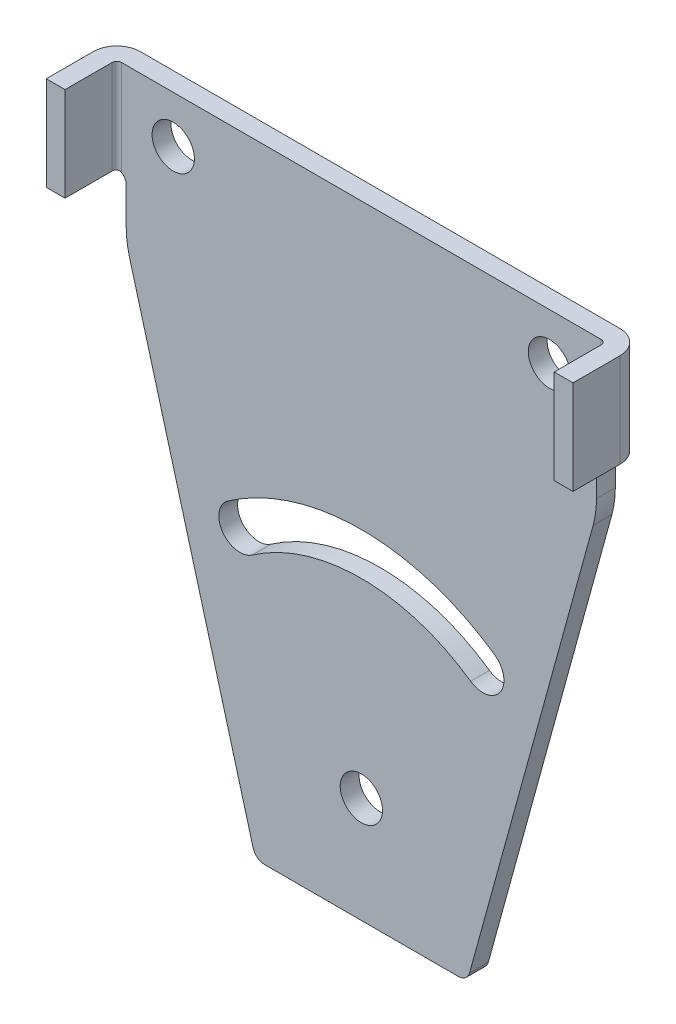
ISO-10303-21;
HEADER;
FILE_DESCRIPTION(('STEP AP214'),'2;1');
FILE_NAME('part.step','',(''),(''),'','','');
FILE_SCHEMA(('AUTOMOTIVE_DESIGN { 1 0 10303 214 1 1 1 1 }'));
ENDSEC;
DATA;
#1=APPLICATION_CONTEXT('core data for automotive mechanical design processes');
#2=APPLICATION_PROTOCOL_DEFINITION('international standard','automotive_design',2000,#1);
#3=PRODUCT_CONTEXT('',#1,'mechanical');
#4=PRODUCT('Part','Part','',(#3));
#5=PRODUCT_RELATED_PRODUCT_CATEGORY('part','',(#4));
#6=PRODUCT_DEFINITION_FORMATION('','',#4);
#7=PRODUCT_DEFINITION_CONTEXT('part definition',#1,'design');
#8=PRODUCT_DEFINITION('design','',#6,#7);
#9=PRODUCT_DEFINITION_SHAPE('','',#8);
#10=(LENGTH_UNIT() NAMED_UNIT(*) SI_UNIT(.MILLI.,.METRE.));
#11=(NAMED_UNIT(*) PLANE_ANGLE_UNIT() SI_UNIT($,.RADIAN.));
#12=(NAMED_UNIT(*) SI_UNIT($,.STERADIAN.) SOLID_ANGLE_UNIT());
#13=UNCERTAINTY_MEASURE_WITH_UNIT(LENGTH_MEASURE(1.E-05),#10,'distance_accuracy_value','');
#14=(GEOMETRIC_REPRESENTATION_CONTEXT(3) GLOBAL_UNCERTAINTY_ASSIGNED_CONTEXT((#13)) GLOBAL_UNIT_ASSIGNED_CONTEXT((#10,
#11,#12)) REPRESENTATION_CONTEXT('',''));
#15=CARTESIAN_POINT('',(0.,0.,0.));
#16=DIRECTION('',(0.,0.,1.));
#17=DIRECTION('',(1.,0.,0.));
#18=AXIS2_PLACEMENT_3D('',#15,#16,#17);
#19=CARTESIAN_POINT('',(-1.00005266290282E-08,54.8446577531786,15.));
#20=DIRECTION('',(0.,0.,-1.));
#21=DIRECTION('',(0.,-1.,0.));
#22=AXIS2_PLACEMENT_3D('',#19,#20,#21);
#23=PLANE('',#22);
#24=DIRECTION('',(0.,1.,0.));
#25=VECTOR('',#24,1.);
#26=CARTESIAN_POINT('',(-52.,82.4223288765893,15.));
#27=LINE('',#26,#25);
#28=CARTESIAN_POINT('',(-52.0000000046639,90.,15.));
#29=VERTEX_POINT('',#28);
#30=CARTESIAN_POINT('',(-52.,110.,15.));
#31=VERTEX_POINT('',#30);
#32=EDGE_CURVE('E1299',#29,#31,#27,.T.);
#33=ORIENTED_EDGE('',*,*,#32,.T.);
#34=DIRECTION('',(1.,0.,0.));
#35=VECTOR('',#34,1.);
#36=CARTESIAN_POINT('',(-56.00000001,110.,15.));
#37=LINE('',#36,#35);
#38=CARTESIAN_POINT('',(-56.00000001,110.,15.));
#39=VERTEX_POINT('',#38);
#40=EDGE_CURVE('E605',#39,#31,#37,.T.);
#41=ORIENTED_EDGE('',*,*,#40,.F.);
#42=DIRECTION('',(0.,1.,0.));
#43=VECTOR('',#42,1.);
#44=CARTESIAN_POINT('',(-56.00000001,90.,15.));
#45=LINE('',#44,#43);
#46=CARTESIAN_POINT('',(-56.00000001,90.,15.));
#47=VERTEX_POINT('',#46);
#48=EDGE_CURVE('E398',#47,#39,#45,.T.);
#49=ORIENTED_EDGE('',*,*,#48,.F.);
#50=DIRECTION('',(-1.,0.,0.));
#51=VECTOR('',#50,1.);
#52=CARTESIAN_POINT('',(-52.00000001,90.,15.));
#53=LINE('',#52,#51);
#54=EDGE_CURVE('E37',#29,#47,#53,.T.);
#55=ORIENTED_EDGE('',*,*,#54,.F.);
#56=EDGE_LOOP('',(#33,#41,#49,#55));
#57=FACE_BOUND('',#56,.T.);
#58=ADVANCED_FACE('F16',(#57),#23,.F.);
#59=CARTESIAN_POINT('',(-20.59469144,-20.,15.));
#60=DIRECTION('',(0.,0.,-1.));
#61=DIRECTION('',(0.,-1.,0.));
#62=AXIS2_PLACEMENT_3D('',#59,#60,#61);
#63=CYLINDRICAL_SURFACE('',#62,2.5);
#64=CARTESIAN_POINT('',(-20.59469144,-20.,4.));
#65=DIRECTION('',(0.,0.,-1.));
#66=DIRECTION('',(0.,-1.,0.));
#67=AXIS2_PLACEMENT_3D('',#64,#65,#66);
#68=CIRCLE('',#67,2.5);
#69=CARTESIAN_POINT('',(-20.59469144,-22.5,4.));
#70=VERTEX_POINT('',#69);
#71=CARTESIAN_POINT('',(-23.0052049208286,-20.6628912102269,4.));
#72=VERTEX_POINT('',#71);
#73=EDGE_CURVE('E774',#70,#72,#68,.T.);
#74=ORIENTED_EDGE('',*,*,#73,.T.);
#75=DIRECTION('',(0.,0.,-1.));
#76=VECTOR('',#75,1.);
#77=CARTESIAN_POINT('',(-23.0052049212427,-20.6628912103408,15.));
#78=LINE('',#77,#76);
#79=CARTESIAN_POINT('',(-23.0052049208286,-20.6628912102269,0.));
#80=VERTEX_POINT('',#79);
#81=EDGE_CURVE('E10',#72,#80,#78,.T.);
#82=ORIENTED_EDGE('',*,*,#81,.T.);
#83=CARTESIAN_POINT('',(-20.59469144,-20.,0.));
#84=DIRECTION('',(0.,0.,1.));
#85=DIRECTION('',(0.,-1.,0.));
#86=AXIS2_PLACEMENT_3D('',#83,#84,#85);
#87=CIRCLE('',#86,2.5);
#88=CARTESIAN_POINT('',(-20.59469144,-22.5,0.));
#89=VERTEX_POINT('',#88);
#90=EDGE_CURVE('E504',#80,#89,#87,.T.);
#91=ORIENTED_EDGE('',*,*,#90,.T.);
#92=DIRECTION('',(0.,0.,-1.));
#93=VECTOR('',#92,1.);
#94=CARTESIAN_POINT('',(-20.59469144,-22.5,15.));
#95=LINE('',#94,#93);
#96=EDGE_CURVE('E317',#70,#89,#95,.T.);
#97=ORIENTED_EDGE('',*,*,#96,.F.);
#98=EDGE_LOOP('',(#74,#82,#91,#97));
#99=FACE_BOUND('',#98,.T.);
#100=ADVANCED_FACE('F2634',(#99),#63,.T.);
#101=CARTESIAN_POINT('',(-36.1446563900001,27.1169323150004,15.));
#102=DIRECTION('',(-0.964205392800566,-0.265156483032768,0.));
#103=DIRECTION('',(-0.265156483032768,0.964205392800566,0.));
#104=AXIS2_PLACEMENT_3D('',#101,#102,#103);
#105=PLANE('',#104);
#106=DIRECTION('',(-0.265156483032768,0.964205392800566,0.));
#107=VECTOR('',#106,1.);
#108=CARTESIAN_POINT('',(-45.4691904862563,61.0243290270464,4.));
#109=LINE('',#108,#107);
#110=CARTESIAN_POINT('',(-49.28410786,74.89675584,4.));
#111=VERTEX_POINT('',#110);
#112=EDGE_CURVE('E484',#72,#111,#109,.T.);
#113=ORIENTED_EDGE('',*,*,#112,.T.);
#114=DIRECTION('',(0.,0.,-1.));
#115=VECTOR('',#114,1.);
#116=CARTESIAN_POINT('',(-49.28410786,74.89675584,15.));
#117=LINE('',#116,#115);
#118=CARTESIAN_POINT('',(-49.28410786,74.89675584,0.));
#119=VERTEX_POINT('',#118);
#120=EDGE_CURVE('E25',#111,#119,#117,.T.);
#121=ORIENTED_EDGE('',*,*,#120,.T.);
#122=DIRECTION('',(0.265156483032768,-0.964205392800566,0.));
#123=VECTOR('',#122,1.);
#124=CARTESIAN_POINT('',(-23.00520492,-20.66289121,0.));
#125=LINE('',#124,#123);
#126=EDGE_CURVE('E481',#119,#80,#125,.T.);
#127=ORIENTED_EDGE('',*,*,#126,.T.);
#128=ORIENTED_EDGE('',*,*,#81,.F.);
#129=EDGE_LOOP('',(#113,#121,#127,#128));
#130=FACE_BOUND('',#129,.T.);
#131=ADVANCED_FACE('F477',(#130),#105,.T.);
#132=CARTESIAN_POINT('',(-30.0000000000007,80.1998854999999,15.));
#133=DIRECTION('',(0.,0.,-1.));
#134=DIRECTION('',(-0.964205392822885,-0.265156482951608,0.));
#135=AXIS2_PLACEMENT_3D('',#132,#133,#134);
#136=CYLINDRICAL_SURFACE('',#135,20.0000000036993);
#137=CARTESIAN_POINT('',(-30.0000000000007,80.1998854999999,4.));
#138=DIRECTION('',(0.,0.,-1.));
#139=DIRECTION('',(-0.964205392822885,-0.265156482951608,0.));
#140=AXIS2_PLACEMENT_3D('',#137,#138,#139);
#141=CIRCLE('',#140,20.0000000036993);
#142=CARTESIAN_POINT('',(-50.0000000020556,80.1998855,4.));
#143=VERTEX_POINT('',#142);
#144=EDGE_CURVE('E1310',#111,#143,#141,.T.);
#145=ORIENTED_EDGE('',*,*,#144,.T.);
#146=DIRECTION('',(0.,0.,-1.));
#147=VECTOR('',#146,1.);
#148=CARTESIAN_POINT('',(-50.0000000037,80.1998855,15.));
#149=LINE('',#148,#147);
#150=CARTESIAN_POINT('',(-50.0000000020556,80.1998855,0.));
#151=VERTEX_POINT('',#150);
#152=EDGE_CURVE('E464',#143,#151,#149,.T.);
#153=ORIENTED_EDGE('',*,*,#152,.T.);
#154=CARTESIAN_POINT('',(-30.0000000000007,80.1998854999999,0.));
#155=DIRECTION('',(0.,0.,1.));
#156=DIRECTION('',(-0.964205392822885,-0.265156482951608,0.));
#157=AXIS2_PLACEMENT_3D('',#154,#155,#156);
#158=CIRCLE('',#157,20.0000000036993);
#159=EDGE_CURVE('E492',#151,#119,#158,.T.);
#160=ORIENTED_EDGE('',*,*,#159,.T.);
#161=ORIENTED_EDGE('',*,*,#120,.F.);
#162=EDGE_LOOP('',(#145,#153,#160,#161));
#163=FACE_BOUND('',#162,.T.);
#164=ADVANCED_FACE('F493',(#163),#136,.T.);
#165=CARTESIAN_POINT('',(-50.,84.09994275,15.));
#166=DIRECTION('',(-1.,0.,0.));
#167=DIRECTION('',(0.,0.,1.));
#168=AXIS2_PLACEMENT_3D('',#165,#166,#167);
#169=PLANE('',#168);
#170=DIRECTION('',(0.,1.,0.));
#171=VECTOR('',#170,1.);
#172=CARTESIAN_POINT('',(-50.,97.049971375,4.));
#173=LINE('',#172,#171);
#174=CARTESIAN_POINT('',(-50.,88.,4.));
#175=VERTEX_POINT('',#174);
#176=EDGE_CURVE('E1306',#143,#175,#173,.T.);
#177=ORIENTED_EDGE('',*,*,#176,.T.);
#178=DIRECTION('',(0.,0.,-1.));
#179=VECTOR('',#178,1.);
#180=CARTESIAN_POINT('',(-50.,88.,15.));
#181=LINE('',#180,#179);
#182=CARTESIAN_POINT('',(-50.,88.,0.));
#183=VERTEX_POINT('',#182);
#184=EDGE_CURVE('E463',#175,#183,#181,.T.);
#185=ORIENTED_EDGE('',*,*,#184,.T.);
#186=DIRECTION('',(0.,-1.,0.));
#187=VECTOR('',#186,1.);
#188=CARTESIAN_POINT('',(-50.,80.1998855,0.));
#189=LINE('',#188,#187);
#190=EDGE_CURVE('E498',#183,#151,#189,.T.);
#191=ORIENTED_EDGE('',*,*,#190,.T.);
#192=ORIENTED_EDGE('',*,*,#152,.F.);
#193=EDGE_LOOP('',(#177,#185,#191,#192));
#194=FACE_BOUND('',#193,.T.);
#195=ADVANCED_FACE('F3145',(#194),#169,.T.);
#196=CARTESIAN_POINT('',(-52.,88.,15.));
#197=DIRECTION('',(0.,0.,-1.));
#198=DIRECTION('',(0.499999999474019,0.866025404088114,0.));
#199=AXIS2_PLACEMENT_3D('',#196,#197,#198);
#200=CYLINDRICAL_SURFACE('',#199,2.00000000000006);
#201=CARTESIAN_POINT('',(-52.,88.,4.));
#202=DIRECTION('',(0.,0.,1.));
#203=DIRECTION('',(0.499999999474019,0.866025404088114,0.));
#204=AXIS2_PLACEMENT_3D('',#201,#202,#203);
#205=CIRCLE('',#204,2.00000000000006);
#206=CARTESIAN_POINT('',(-51.0000000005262,89.7320508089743,4.));
#207=VERTEX_POINT('',#206);
#208=EDGE_CURVE('E1302',#175,#207,#205,.T.);
#209=ORIENTED_EDGE('',*,*,#208,.T.);
#210=DIRECTION('',(0.,0.,-1.));
#211=VECTOR('',#210,1.);
#212=CARTESIAN_POINT('',(-51.000000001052,89.7320508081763,15.));
#213=LINE('',#212,#211);
#214=CARTESIAN_POINT('',(-51.0000000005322,89.7320508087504,0.));
#215=VERTEX_POINT('',#214);
#216=EDGE_CURVE('E543',#207,#215,#213,.T.);
#217=ORIENTED_EDGE('',*,*,#216,.T.);
#218=CARTESIAN_POINT('',(-52.,88.,0.));
#219=DIRECTION('',(0.,0.,-1.));
#220=DIRECTION('',(0.499999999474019,0.866025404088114,0.));
#221=AXIS2_PLACEMENT_3D('',#218,#219,#220);
#222=CIRCLE('',#221,2.00000000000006);
#223=EDGE_CURVE('E532',#215,#183,#222,.T.);
#224=ORIENTED_EDGE('',*,*,#223,.T.);
#225=ORIENTED_EDGE('',*,*,#184,.F.);
#226=EDGE_LOOP('',(#209,#217,#224,#225));
#227=FACE_BOUND('',#226,.T.);
#228=ADVANCED_FACE('F2441',(#227),#200,.F.);
#229=CARTESIAN_POINT('',(-51.6911311,89.975939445,15.));
#230=DIRECTION('',(-0.154439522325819,-0.988002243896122,0.));
#231=DIRECTION('',(-0.988002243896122,0.154439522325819,0.));
#232=AXIS2_PLACEMENT_3D('',#229,#230,#231);
#233=PLANE('',#232);
#234=CARTESIAN_POINT('',(-51.,89.8679053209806,5.));
#235=DIRECTION('',(-0.154439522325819,-0.988002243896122,0.));
#236=DIRECTION('',(-0.988002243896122,0.154439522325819,0.));
#237=AXIS2_PLACEMENT_3D('',#234,#235,#236);
#238=ELLIPSE('',#237,5.06071725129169,5.);
#239=CARTESIAN_POINT('',(-51.70716242,89.97844538,0.0502604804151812));
#240=VERTEX_POINT('',#239);
#241=CARTESIAN_POINT('',(-51.67509978,89.97343351,0.0457856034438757));
#242=VERTEX_POINT('',#241);
#243=EDGE_CURVE('E913',#240,#242,#238,.T.);
#244=ORIENTED_EDGE('',*,*,#243,.T.);
#245=DIRECTION('',(0.,0.,-1.));
#246=VECTOR('',#245,1.);
#247=CARTESIAN_POINT('',(-51.67509978,89.97343351,15.));
#248=LINE('',#247,#246);
#249=CARTESIAN_POINT('',(-51.67509978,89.97343351,4.2622735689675));
#250=VERTEX_POINT('',#249);
#251=EDGE_CURVE('E995',#250,#242,#248,.T.);
#252=ORIENTED_EDGE('',*,*,#251,.F.);
#253=CARTESIAN_POINT('',(-51.,89.8679053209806,5.));
#254=DIRECTION('',(0.154439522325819,0.988002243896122,0.));
#255=DIRECTION('',(-0.988002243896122,0.154439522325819,0.));
#256=AXIS2_PLACEMENT_3D('',#253,#254,#255);
#257=ELLIPSE('',#256,1.01214345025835,1.);
#258=CARTESIAN_POINT('',(-51.70716242,89.97844538,4.29294886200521));
#259=VERTEX_POINT('',#258);
#260=EDGE_CURVE('E1283',#250,#259,#257,.T.);
#261=ORIENTED_EDGE('',*,*,#260,.T.);
#262=DIRECTION('',(0.,0.,-1.));
#263=VECTOR('',#262,1.);
#264=CARTESIAN_POINT('',(-51.70716242,89.97844538,15.));
#265=LINE('',#264,#263);
#266=EDGE_CURVE('E459',#259,#240,#265,.T.);
#267=ORIENTED_EDGE('',*,*,#266,.T.);
#268=EDGE_LOOP('',(#244,#252,#261,#267));
#269=FACE_BOUND('',#268,.T.);
#270=ADVANCED_FACE('F2436',(#269),#233,.T.);
#271=CARTESIAN_POINT('',(-51.722537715,89.980599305,15.));
#272=DIRECTION('',(-0.138735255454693,-0.990329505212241,0.));
#273=DIRECTION('',(-0.990329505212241,0.138735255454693,0.));
#274=AXIS2_PLACEMENT_3D('',#271,#272,#273);
#275=PLANE('',#274);
#276=CARTESIAN_POINT('',(-51.,89.8793790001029,5.));
#277=DIRECTION('',(-0.138735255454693,-0.990329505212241,0.));
#278=DIRECTION('',(-0.990329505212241,0.138735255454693,0.));
#279=AXIS2_PLACEMENT_3D('',#276,#277,#278);
#280=ELLIPSE('',#279,5.04882463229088,5.);
#281=CARTESIAN_POINT('',(-51.73791301,89.98275323,0.0547513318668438));
#282=VERTEX_POINT('',#281);
#283=EDGE_CURVE('E917',#282,#240,#280,.T.);
#284=ORIENTED_EDGE('',*,*,#283,.T.);
#285=ORIENTED_EDGE('',*,*,#266,.F.);
#286=CARTESIAN_POINT('',(-51.,89.8793790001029,5.));
#287=DIRECTION('',(0.138735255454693,0.990329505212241,0.));
#288=DIRECTION('',(-0.990329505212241,0.138735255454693,0.));
#289=AXIS2_PLACEMENT_3D('',#286,#287,#288);
#290=ELLIPSE('',#289,1.00976492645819,1.);
#291=CARTESIAN_POINT('',(-51.73791301,89.98275323,4.32510416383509));
#292=VERTEX_POINT('',#291);
#293=EDGE_CURVE('E1279',#259,#292,#290,.T.);
#294=ORIENTED_EDGE('',*,*,#293,.T.);
#295=DIRECTION('',(0.,0.,-1.));
#296=VECTOR('',#295,1.);
#297=CARTESIAN_POINT('',(-51.73791301,89.98275323,15.));
#298=LINE('',#297,#296);
#299=EDGE_CURVE('E458',#292,#282,#298,.T.);
#300=ORIENTED_EDGE('',*,*,#299,.T.);
#301=EDGE_LOOP('',(#284,#285,#294,#300));
#302=FACE_BOUND('',#301,.T.);
#303=ADVANCED_FACE('F2364',(#302),#275,.T.);
#304=CARTESIAN_POINT('',(-51.752762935,89.9846032,15.));
#305=DIRECTION('',(-0.123622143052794,-0.99232936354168,0.));
#306=DIRECTION('',(-0.99232936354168,0.123622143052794,0.));
#307=AXIS2_PLACEMENT_3D('',#304,#305,#306);
#308=PLANE('',#307);
#309=CARTESIAN_POINT('',(-51.,89.8908256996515,5.));
#310=DIRECTION('',(-0.123622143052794,-0.99232936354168,0.));
#311=DIRECTION('',(-0.99232936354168,0.123622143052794,0.));
#312=AXIS2_PLACEMENT_3D('',#309,#310,#311);
#313=ELLIPSE('',#312,5.03864964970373,5.);
#314=CARTESIAN_POINT('',(-51.76761286,89.98645317,0.0592742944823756));
#315=VERTEX_POINT('',#314);
#316=EDGE_CURVE('E921',#315,#282,#313,.T.);
#317=ORIENTED_EDGE('',*,*,#316,.T.);
#318=ORIENTED_EDGE('',*,*,#299,.F.);
#319=CARTESIAN_POINT('',(-51.,89.8908256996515,5.));
#320=DIRECTION('',(0.123622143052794,0.99232936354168,0.));
#321=DIRECTION('',(-0.99232936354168,0.123622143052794,0.));
#322=AXIS2_PLACEMENT_3D('',#319,#320,#321);
#323=ELLIPSE('',#322,1.00772992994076,1.);
#324=CARTESIAN_POINT('',(-51.76761286,89.98645317,4.35908620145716));
#325=VERTEX_POINT('',#324);
#326=EDGE_CURVE('E1275',#292,#325,#323,.T.);
#327=ORIENTED_EDGE('',*,*,#326,.T.);
#328=DIRECTION('',(0.,0.,-1.));
#329=VECTOR('',#328,1.);
#330=CARTESIAN_POINT('',(-51.76761286,89.98645317,15.));
#331=LINE('',#330,#329);
#332=EDGE_CURVE('E454',#325,#315,#331,.T.);
#333=ORIENTED_EDGE('',*,*,#332,.T.);
#334=EDGE_LOOP('',(#317,#318,#327,#333));
#335=FACE_BOUND('',#334,.T.);
#336=ADVANCED_FACE('F2358',(#335),#308,.T.);
#337=CARTESIAN_POINT('',(-51.78184647,89.988015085,15.));
#338=DIRECTION('',(-0.109079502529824,-0.99403302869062,0.));
#339=DIRECTION('',(-0.99403302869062,0.109079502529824,0.));
#340=AXIS2_PLACEMENT_3D('',#337,#338,#339);
#341=PLANE('',#340);
#342=CARTESIAN_POINT('',(-51.,89.9022197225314,5.));
#343=DIRECTION('',(-0.109079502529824,-0.99403302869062,0.));
#344=DIRECTION('',(-0.99403302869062,0.109079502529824,0.));
#345=AXIS2_PLACEMENT_3D('',#342,#343,#344);
#346=ELLIPSE('',#345,5.03001394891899,5.);
#347=CARTESIAN_POINT('',(-51.79608008,89.989577,0.063781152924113));
#348=VERTEX_POINT('',#347);
#349=EDGE_CURVE('E924',#348,#315,#346,.T.);
#350=ORIENTED_EDGE('',*,*,#349,.T.);
#351=ORIENTED_EDGE('',*,*,#332,.F.);
#352=CARTESIAN_POINT('',(-51.,89.9022197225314,5.));
#353=DIRECTION('',(0.109079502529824,0.99403302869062,0.));
#354=DIRECTION('',(-0.99403302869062,0.109079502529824,0.));
#355=AXIS2_PLACEMENT_3D('',#352,#353,#354);
#356=ELLIPSE('',#355,1.00600278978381,1.);
#357=CARTESIAN_POINT('',(-51.79608008,89.989577,4.39480870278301));
#358=VERTEX_POINT('',#357);
#359=EDGE_CURVE('E1271',#325,#358,#356,.T.);
#360=ORIENTED_EDGE('',*,*,#359,.T.);
#361=DIRECTION('',(0.,0.,-1.));
#362=VECTOR('',#361,1.);
#363=CARTESIAN_POINT('',(-51.79608008,89.989577,15.));
#364=LINE('',#363,#362);
#365=EDGE_CURVE('E450',#358,#348,#364,.T.);
#366=ORIENTED_EDGE('',*,*,#365,.T.);
#367=EDGE_LOOP('',(#350,#351,#360,#366));
#368=FACE_BOUND('',#367,.T.);
#369=ADVANCED_FACE('F2363',(#368),#341,.T.);
#370=CARTESIAN_POINT('',(-51.809611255,89.990871,15.));
#371=DIRECTION('',(-0.0951967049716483,-0.995458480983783,0.));
#372=DIRECTION('',(-0.995458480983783,0.0951967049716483,0.));
#373=AXIS2_PLACEMENT_3D('',#370,#371,#372);
#374=PLANE('',#373);
#375=CARTESIAN_POINT('',(-51.,89.9134470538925,5.));
#376=DIRECTION('',(-0.0951967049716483,-0.995458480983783,0.));
#377=DIRECTION('',(-0.995458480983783,0.0951967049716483,0.));
#378=AXIS2_PLACEMENT_3D('',#375,#376,#377);
#379=ELLIPSE('',#378,5.02281119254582,5.);
#380=CARTESIAN_POINT('',(-51.82314243,89.992165,0.0682217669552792));
#381=VERTEX_POINT('',#380);
#382=EDGE_CURVE('E928',#381,#348,#379,.T.);
#383=ORIENTED_EDGE('',*,*,#382,.T.);
#384=ORIENTED_EDGE('',*,*,#365,.F.);
#385=CARTESIAN_POINT('',(-51.,89.9134470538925,5.));
#386=DIRECTION('',(0.0951967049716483,0.995458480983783,0.));
#387=DIRECTION('',(-0.995458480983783,0.0951967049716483,0.));
#388=AXIS2_PLACEMENT_3D('',#385,#386,#387);
#389=ELLIPSE('',#388,1.00456223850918,1.);
#390=CARTESIAN_POINT('',(-51.82314243,89.992165,4.43216504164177));
#391=VERTEX_POINT('',#390);
#392=EDGE_CURVE('E1161',#358,#391,#389,.T.);
#393=ORIENTED_EDGE('',*,*,#392,.T.);
#394=DIRECTION('',(0.,0.,-1.));
#395=VECTOR('',#394,1.);
#396=CARTESIAN_POINT('',(-51.82314243,89.992165,15.));
#397=LINE('',#396,#395);
#398=EDGE_CURVE('E445',#391,#381,#397,.T.);
#399=ORIENTED_EDGE('',*,*,#398,.T.);
#400=EDGE_LOOP('',(#383,#384,#393,#399));
#401=FACE_BOUND('',#400,.T.);
#402=ADVANCED_FACE('F2948',(#401),#374,.T.);
#403=CARTESIAN_POINT('',(-51.83589201,89.993214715,15.));
#404=DIRECTION('',(-0.0820556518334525,-0.996627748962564,0.));
#405=DIRECTION('',(-0.996627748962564,0.0820556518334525,0.));
#406=AXIS2_PLACEMENT_3D('',#403,#404,#405);
#407=PLANE('',#406);
#408=CARTESIAN_POINT('',(-51.,89.9243929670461,5.));
#409=DIRECTION('',(-0.0820556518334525,-0.996627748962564,0.));
#410=DIRECTION('',(-0.996627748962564,0.0820556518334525,0.));
#411=AXIS2_PLACEMENT_3D('',#408,#409,#410);
#412=ELLIPSE('',#411,5.01691830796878,5.);
#413=CARTESIAN_POINT('',(-51.84864159,89.99426443,0.0725455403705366));
#414=VERTEX_POINT('',#413);
#415=EDGE_CURVE('E932',#414,#381,#412,.T.);
#416=ORIENTED_EDGE('',*,*,#415,.T.);
#417=ORIENTED_EDGE('',*,*,#398,.F.);
#418=CARTESIAN_POINT('',(-51.,89.9243929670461,5.));
#419=DIRECTION('',(0.0820556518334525,0.996627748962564,0.));
#420=DIRECTION('',(-0.996627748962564,0.0820556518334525,0.));
#421=AXIS2_PLACEMENT_3D('',#418,#419,#420);
#422=ELLIPSE('',#421,1.00338366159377,1.);
#423=CARTESIAN_POINT('',(-51.84864159,89.99426443,4.47103171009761));
#424=VERTEX_POINT('',#423);
#425=EDGE_CURVE('E1157',#391,#424,#422,.T.);
#426=ORIENTED_EDGE('',*,*,#425,.T.);
#427=DIRECTION('',(0.,0.,-1.));
#428=VECTOR('',#427,1.);
#429=CARTESIAN_POINT('',(-51.84864159,89.99426443,15.));
#430=LINE('',#429,#428);
#431=EDGE_CURVE('E441',#424,#414,#430,.T.);
#432=ORIENTED_EDGE('',*,*,#431,.T.);
#433=EDGE_LOOP('',(#416,#417,#426,#432));
#434=FACE_BOUND('',#433,.T.);
#435=ADVANCED_FACE('F3092',(#434),#407,.T.);
#436=CARTESIAN_POINT('',(-51.86053896,89.99509608,15.));
#437=DIRECTION('',(-0.0697318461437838,-0.997565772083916,0.));
#438=DIRECTION('',(-0.997565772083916,0.0697318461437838,0.));
#439=AXIS2_PLACEMENT_3D('',#436,#437,#438);
#440=PLANE('',#439);
#441=CARTESIAN_POINT('',(-51.,89.9349426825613,5.));
#442=DIRECTION('',(-0.0697318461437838,-0.997565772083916,0.));
#443=DIRECTION('',(-0.997565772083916,0.0697318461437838,0.));
#444=AXIS2_PLACEMENT_3D('',#441,#442,#443);
#445=ELLIPSE('',#444,5.01220083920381,5.);
#446=CARTESIAN_POINT('',(-51.87243633,89.99592773,0.0767028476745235));
#447=VERTEX_POINT('',#446);
#448=EDGE_CURVE('E936',#447,#414,#445,.T.);
#449=ORIENTED_EDGE('',*,*,#448,.T.);
#450=ORIENTED_EDGE('',*,*,#431,.F.);
#451=CARTESIAN_POINT('',(-51.,89.9349426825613,5.));
#452=DIRECTION('',(0.0697318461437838,0.997565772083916,0.));
#453=DIRECTION('',(-0.997565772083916,0.0697318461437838,0.));
#454=AXIS2_PLACEMENT_3D('',#451,#452,#453);
#455=ELLIPSE('',#454,1.00244016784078,1.);
#456=CARTESIAN_POINT('',(-51.87243633,89.99592773,4.51127221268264));
#457=VERTEX_POINT('',#456);
#458=EDGE_CURVE('E1162',#424,#457,#455,.T.);
#459=ORIENTED_EDGE('',*,*,#458,.T.);
#460=DIRECTION('',(0.,0.,-1.));
#461=VECTOR('',#460,1.);
#462=CARTESIAN_POINT('',(-51.87243633,89.99592773,15.));
#463=LINE('',#462,#461);
#464=EDGE_CURVE('E446',#457,#447,#463,.T.);
#465=ORIENTED_EDGE('',*,*,#464,.T.);
#466=EDGE_LOOP('',(#449,#450,#459,#465));
#467=FACE_BOUND('',#466,.T.);
#468=ADVANCED_FACE('F3097',(#467),#440,.T.);
#469=CARTESIAN_POINT('',(-51.8834205,89.996569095,15.));
#470=DIRECTION('',(-0.0582906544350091,-0.998299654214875,0.));
#471=DIRECTION('',(-0.998299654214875,0.0582906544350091,0.));
#472=AXIS2_PLACEMENT_3D('',#469,#470,#471);
#473=PLANE('',#472);
#474=CARTESIAN_POINT('',(-51.,89.9449862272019,5.));
#475=DIRECTION('',(-0.0582906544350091,-0.998299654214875,0.));
#476=DIRECTION('',(-0.998299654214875,0.0582906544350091,0.));
#477=AXIS2_PLACEMENT_3D('',#474,#475,#476);
#478=ELLIPSE('',#477,5.00851620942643,5.);
#479=CARTESIAN_POINT('',(-51.89440467,89.99721046,0.0806463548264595));
#480=VERTEX_POINT('',#479);
#481=EDGE_CURVE('E940',#480,#447,#478,.T.);
#482=ORIENTED_EDGE('',*,*,#481,.T.);
#483=ORIENTED_EDGE('',*,*,#464,.F.);
#484=CARTESIAN_POINT('',(-51.,89.9449862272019,5.));
#485=DIRECTION('',(0.0582906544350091,0.998299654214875,0.));
#486=DIRECTION('',(-0.998299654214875,0.0582906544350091,0.));
#487=AXIS2_PLACEMENT_3D('',#484,#485,#486);
#488=ELLIPSE('',#487,1.0017032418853,1.);
#489=CARTESIAN_POINT('',(-51.89440467,89.99721046,4.55274136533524));
#490=VERTEX_POINT('',#489);
#491=EDGE_CURVE('E1261',#457,#490,#488,.T.);
#492=ORIENTED_EDGE('',*,*,#491,.T.);
#493=DIRECTION('',(0.,0.,-1.));
#494=VECTOR('',#493,1.);
#495=CARTESIAN_POINT('',(-51.89440467,89.99721046,15.));
#496=LINE('',#495,#494);
#497=EDGE_CURVE('E440',#490,#480,#496,.T.);
#498=ORIENTED_EDGE('',*,*,#497,.T.);
#499=EDGE_LOOP('',(#482,#483,#492,#498));
#500=FACE_BOUND('',#499,.T.);
#501=ADVANCED_FACE('F3167',(#500),#473,.T.);
#502=CARTESIAN_POINT('',(-51.904424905,89.997689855,15.));
#503=DIRECTION('',(-0.0477880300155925,-0.998857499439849,0.));
#504=DIRECTION('',(-0.998857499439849,0.0477880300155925,0.));
#505=AXIS2_PLACEMENT_3D('',#502,#503,#504);
#506=PLANE('',#505);
#507=CARTESIAN_POINT('',(-51.,89.9544197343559,5.));
#508=DIRECTION('',(-0.0477880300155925,-0.998857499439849,0.));
#509=DIRECTION('',(-0.998857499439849,0.0477880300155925,0.));
#510=AXIS2_PLACEMENT_3D('',#507,#508,#509);
#511=ELLIPSE('',#510,5.00571903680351,5.);
#512=CARTESIAN_POINT('',(-51.91444514,89.99816925,0.0843321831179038));
#513=VERTEX_POINT('',#512);
#514=EDGE_CURVE('E947',#513,#480,#511,.T.);
#515=ORIENTED_EDGE('',*,*,#514,.T.);
#516=ORIENTED_EDGE('',*,*,#497,.F.);
#517=CARTESIAN_POINT('',(-51.,89.9544197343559,5.));
#518=DIRECTION('',(0.0477880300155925,0.998857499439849,0.));
#519=DIRECTION('',(-0.998857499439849,0.0477880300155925,0.));
#520=AXIS2_PLACEMENT_3D('',#517,#518,#519);
#521=ELLIPSE('',#520,1.00114380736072,1.);
#522=CARTESIAN_POINT('',(-51.91444514,89.99816925,4.59529012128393));
#523=VERTEX_POINT('',#522);
#524=EDGE_CURVE('E1257',#490,#523,#521,.T.);
#525=ORIENTED_EDGE('',*,*,#524,.T.);
#526=DIRECTION('',(0.,0.,-1.));
#527=VECTOR('',#526,1.);
#528=CARTESIAN_POINT('',(-51.91444514,89.99816925,15.));
#529=LINE('',#528,#527);
#530=EDGE_CURVE('E436',#523,#513,#529,.T.);
#531=ORIENTED_EDGE('',*,*,#530,.T.);
#532=EDGE_LOOP('',(#515,#516,#525,#531));
#533=FACE_BOUND('',#532,.T.);
#534=ADVANCED_FACE('F2478',(#533),#506,.T.);
#535=CARTESIAN_POINT('',(-51.923461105,89.998514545,15.));
#536=DIRECTION('',(-0.0382701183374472,-0.999267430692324,0.));
#537=DIRECTION('',(-0.999267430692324,0.0382701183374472,0.));
#538=AXIS2_PLACEMENT_3D('',#535,#536,#537);
#539=PLANE('',#538);
#540=CARTESIAN_POINT('',(-51.,89.9631476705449,5.));
#541=DIRECTION('',(-0.0382701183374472,-0.999267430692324,0.));
#542=DIRECTION('',(-0.999267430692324,0.0382701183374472,0.));
#543=AXIS2_PLACEMENT_3D('',#540,#541,#542);
#544=ELLIPSE('',#543,5.00366553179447,5.);
#545=CARTESIAN_POINT('',(-51.93247707,89.99885984,0.0877208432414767));
#546=VERTEX_POINT('',#545);
#547=EDGE_CURVE('E951',#546,#513,#544,.T.);
#548=ORIENTED_EDGE('',*,*,#547,.T.);
#549=ORIENTED_EDGE('',*,*,#530,.F.);
#550=CARTESIAN_POINT('',(-51.,89.9631476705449,5.));
#551=DIRECTION('',(0.0382701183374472,0.999267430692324,0.));
#552=DIRECTION('',(-0.999267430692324,0.0382701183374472,0.));
#553=AXIS2_PLACEMENT_3D('',#550,#551,#552);
#554=ELLIPSE('',#553,1.00073310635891,1.);
#555=CARTESIAN_POINT('',(-51.93247707,89.99885984,4.63877082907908));
#556=VERTEX_POINT('',#555);
#557=EDGE_CURVE('E1000',#523,#556,#554,.T.);
#558=ORIENTED_EDGE('',*,*,#557,.T.);
#559=DIRECTION('',(0.,0.,-1.));
#560=VECTOR('',#559,1.);
#561=CARTESIAN_POINT('',(-51.93247707,89.99885984,15.));
#562=LINE('',#561,#560);
#563=EDGE_CURVE('E432',#556,#546,#562,.T.);
#564=ORIENTED_EDGE('',*,*,#563,.T.);
#565=EDGE_LOOP('',(#548,#549,#558,#564));
#566=FACE_BOUND('',#565,.T.);
#567=ADVANCED_FACE('F2472',(#566),#539,.T.);
#568=CARTESIAN_POINT('',(-51.94045739,89.99909753,15.));
#569=DIRECTION('',(-0.0297713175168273,-0.999556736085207,0.));
#570=DIRECTION('',(-0.999556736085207,0.0297713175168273,0.));
#571=AXIS2_PLACEMENT_3D('',#568,#569,#570);
#572=PLANE('',#571);
#573=CARTESIAN_POINT('',(-51.,89.9710864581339,5.));
#574=DIRECTION('',(-0.0297713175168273,-0.999556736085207,0.));
#575=DIRECTION('',(-0.999556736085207,0.0297713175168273,0.));
#576=AXIS2_PLACEMENT_3D('',#573,#574,#575);
#577=ELLIPSE('',#576,5.00221730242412,5.);
#578=CARTESIAN_POINT('',(-51.94843771,89.99933522,0.0907774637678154));
#579=VERTEX_POINT('',#578);
#580=EDGE_CURVE('E955',#579,#546,#577,.T.);
#581=ORIENTED_EDGE('',*,*,#580,.T.);
#582=ORIENTED_EDGE('',*,*,#563,.F.);
#583=CARTESIAN_POINT('',(-51.,89.9710864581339,5.));
#584=DIRECTION('',(0.0297713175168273,0.999556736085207,0.));
#585=DIRECTION('',(-0.999556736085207,0.0297713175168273,0.));
#586=AXIS2_PLACEMENT_3D('',#583,#584,#585);
#587=ELLIPSE('',#586,1.00044346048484,1.);
#588=CARTESIAN_POINT('',(-51.94843771,89.99933522,4.6830364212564));
#589=VERTEX_POINT('',#588);
#590=EDGE_CURVE('E996',#556,#589,#587,.T.);
#591=ORIENTED_EDGE('',*,*,#590,.T.);
#592=DIRECTION('',(0.,0.,-1.));
#593=VECTOR('',#592,1.);
#594=CARTESIAN_POINT('',(-51.94843771,89.99933522,15.));
#595=LINE('',#594,#593);
#596=EDGE_CURVE('E428',#589,#579,#595,.T.);
#597=ORIENTED_EDGE('',*,*,#596,.T.);
#598=EDGE_LOOP('',(#581,#582,#591,#597));
#599=FACE_BOUND('',#598,.T.);
#600=ADVANCED_FACE('F2477',(#599),#572,.T.);
#601=CARTESIAN_POINT('',(-51.9553571,89.99948971,15.));
#602=DIRECTION('',(-0.0223215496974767,-0.999750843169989,0.));
#603=DIRECTION('',(-0.999750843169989,0.0223215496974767,0.));
#604=AXIS2_PLACEMENT_3D('',#601,#602,#603);
#605=PLANE('',#604);
#606=CARTESIAN_POINT('',(-51.,89.9781593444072,5.));
#607=DIRECTION('',(-0.0223215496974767,-0.999750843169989,0.));
#608=DIRECTION('',(-0.999750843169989,0.0223215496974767,0.));
#609=AXIS2_PLACEMENT_3D('',#606,#607,#608);
#610=ELLIPSE('',#609,5.00124609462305,5.);
#611=CARTESIAN_POINT('',(-51.96227649,89.9996442,0.09347129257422));
#612=VERTEX_POINT('',#611);
#613=EDGE_CURVE('E959',#612,#579,#610,.T.);
#614=ORIENTED_EDGE('',*,*,#613,.T.);
#615=ORIENTED_EDGE('',*,*,#596,.F.);
#616=CARTESIAN_POINT('',(-51.,89.9781593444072,5.));
#617=DIRECTION('',(0.0223215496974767,0.999750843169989,0.));
#618=DIRECTION('',(-0.999750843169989,0.0223215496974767,0.));
#619=AXIS2_PLACEMENT_3D('',#616,#617,#618);
#620=ELLIPSE('',#619,1.00024921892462,1.);
#621=CARTESIAN_POINT('',(-51.96227649,89.9996442,4.72792655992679));
#622=VERTEX_POINT('',#621);
#623=EDGE_CURVE('E1001',#589,#622,#620,.T.);
#624=ORIENTED_EDGE('',*,*,#623,.T.);
#625=DIRECTION('',(0.,0.,-1.));
#626=VECTOR('',#625,1.);
#627=CARTESIAN_POINT('',(-51.96227649,89.9996442,15.));
#628=LINE('',#627,#626);
#629=EDGE_CURVE('E424',#622,#612,#628,.T.);
#630=ORIENTED_EDGE('',*,*,#629,.T.);
#631=EDGE_LOOP('',(#614,#615,#624,#630));
#632=FACE_BOUND('',#631,.T.);
#633=ADVANCED_FACE('F2849',(#632),#605,.T.);
#634=CARTESIAN_POINT('',(-51.968116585,89.999737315,15.));
#635=DIRECTION('',(-0.0159420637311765,-0.99987291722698,0.));
#636=DIRECTION('',(-0.99987291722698,0.0159420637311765,0.));
#637=AXIS2_PLACEMENT_3D('',#634,#635,#636);
#638=PLANE('',#637);
#639=CARTESIAN_POINT('',(-51.,89.9843015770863,5.));
#640=DIRECTION('',(-0.0159420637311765,-0.99987291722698,0.));
#641=DIRECTION('',(-0.99987291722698,0.0159420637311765,0.));
#642=AXIS2_PLACEMENT_3D('',#639,#640,#641);
#643=ELLIPSE('',#642,5.00063549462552,5.);
#644=CARTESIAN_POINT('',(-51.97395668,89.99983043,0.0957764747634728));
#645=VERTEX_POINT('',#644);
#646=EDGE_CURVE('E963',#645,#612,#643,.T.);
#647=ORIENTED_EDGE('',*,*,#646,.T.);
#648=ORIENTED_EDGE('',*,*,#629,.F.);
#649=CARTESIAN_POINT('',(-51.,89.9843015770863,5.));
#650=DIRECTION('',(0.0159420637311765,0.99987291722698,0.));
#651=DIRECTION('',(-0.99987291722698,0.0159420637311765,0.));
#652=AXIS2_PLACEMENT_3D('',#649,#650,#651);
#653=ELLIPSE('',#652,1.00012709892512,1.);
#654=CARTESIAN_POINT('',(-51.97395668,89.99983043,4.77326582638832));
#655=VERTEX_POINT('',#654);
#656=EDGE_CURVE('E1247',#622,#655,#653,.T.);
#657=ORIENTED_EDGE('',*,*,#656,.T.);
#658=DIRECTION('',(0.,0.,-1.));
#659=VECTOR('',#658,1.);
#660=CARTESIAN_POINT('',(-51.97395668,89.99983043,15.));
#661=LINE('',#660,#659);
#662=EDGE_CURVE('E420',#655,#645,#661,.T.);
#663=ORIENTED_EDGE('',*,*,#662,.T.);
#664=EDGE_LOOP('',(#647,#648,#657,#663));
#665=FACE_BOUND('',#664,.T.);
#666=ADVANCED_FACE('F2762',(#665),#638,.T.);
#667=CARTESIAN_POINT('',(-51.97870769,89.999881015,15.));
#668=DIRECTION('',(-0.010646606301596,-0.999943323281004,0.));
#669=DIRECTION('',(-0.999943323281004,0.010646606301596,0.));
#670=AXIS2_PLACEMENT_3D('',#667,#668,#669);
#671=PLANE('',#670);
#672=CARTESIAN_POINT('',(-51.,89.9894605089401,5.));
#673=DIRECTION('',(-0.010646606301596,-0.999943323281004,0.));
#674=DIRECTION('',(-0.999943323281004,0.010646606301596,0.));
#675=AXIS2_PLACEMENT_3D('',#672,#673,#674);
#676=ELLIPSE('',#675,5.00028339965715,5.);
#677=CARTESIAN_POINT('',(-51.9834587,89.9999316,0.0976731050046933));
#678=VERTEX_POINT('',#677);
#679=EDGE_CURVE('E967',#678,#645,#676,.T.);
#680=ORIENTED_EDGE('',*,*,#679,.T.);
#681=ORIENTED_EDGE('',*,*,#662,.F.);
#682=CARTESIAN_POINT('',(-51.,89.9894605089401,5.));
#683=DIRECTION('',(0.010646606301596,0.999943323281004,0.));
#684=DIRECTION('',(-0.999943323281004,0.010646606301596,0.));
#685=AXIS2_PLACEMENT_3D('',#682,#683,#684);
#686=ELLIPSE('',#685,1.00005667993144,1.);
#687=CARTESIAN_POINT('',(-51.9834587,89.9999316,4.8188674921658));
#688=VERTEX_POINT('',#687);
#689=EDGE_CURVE('E1243',#655,#688,#686,.T.);
#690=ORIENTED_EDGE('',*,*,#689,.T.);
#691=DIRECTION('',(0.,0.,-1.));
#692=VECTOR('',#691,1.);
#693=CARTESIAN_POINT('',(-51.9834587,89.9999316,15.));
#694=LINE('',#693,#692);
#695=EDGE_CURVE('E416',#688,#678,#694,.T.);
#696=ORIENTED_EDGE('',*,*,#695,.T.);
#697=EDGE_LOOP('',(#680,#681,#690,#696));
#698=FACE_BOUND('',#697,.T.);
#699=ADVANCED_FACE('F2756',(#698),#671,.T.);
#700=CARTESIAN_POINT('',(-51.98712059,89.99995518,15.));
#701=DIRECTION('',(-0.00643916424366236,-0.999979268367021,0.));
#702=DIRECTION('',(-0.999979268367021,0.00643916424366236,0.));
#703=AXIS2_PLACEMENT_3D('',#700,#701,#702);
#704=PLANE('',#703);
#705=CARTESIAN_POINT('',(-51.,89.9935988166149,5.));
#706=DIRECTION('',(-0.00643916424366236,-0.999979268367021,0.));
#707=DIRECTION('',(-0.999979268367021,0.00643916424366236,0.));
#708=AXIS2_PLACEMENT_3D('',#705,#706,#707);
#709=ELLIPSE('',#708,5.00010366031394,5.);
#710=CARTESIAN_POINT('',(-51.99078248,89.99997876,0.0991480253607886));
#711=VERTEX_POINT('',#710);
#712=EDGE_CURVE('E970',#711,#678,#709,.T.);
#713=ORIENTED_EDGE('',*,*,#712,.T.);
#714=ORIENTED_EDGE('',*,*,#695,.F.);
#715=CARTESIAN_POINT('',(-51.,89.9935988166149,5.));
#716=DIRECTION('',(0.00643916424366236,0.999979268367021,0.));
#717=DIRECTION('',(-0.999979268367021,0.00643916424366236,0.));
#718=AXIS2_PLACEMENT_3D('',#715,#716,#717);
#719=ELLIPSE('',#718,1.0000207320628,1.);
#720=CARTESIAN_POINT('',(-51.99078248,89.99997876,4.86453754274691));
#721=VERTEX_POINT('',#720);
#722=EDGE_CURVE('E1182',#688,#721,#719,.T.);
#723=ORIENTED_EDGE('',*,*,#722,.T.);
#724=DIRECTION('',(0.,0.,-1.));
#725=VECTOR('',#724,1.);
#726=CARTESIAN_POINT('',(-51.99078248,89.99997876,15.));
#727=LINE('',#726,#725);
#728=EDGE_CURVE('E415',#721,#711,#727,.T.);
#729=ORIENTED_EDGE('',*,*,#728,.T.);
#730=EDGE_LOOP('',(#713,#714,#723,#729));
#731=FACE_BOUND('',#730,.T.);
#732=ADVANCED_FACE('F2761',(#731),#704,.T.);
#733=CARTESIAN_POINT('',(-51.99336569,89.99998733,15.));
#734=DIRECTION('',(-0.00331755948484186,-0.99999449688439,0.));
#735=DIRECTION('',(-0.99999449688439,0.00331755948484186,0.));
#736=AXIS2_PLACEMENT_3D('',#733,#734,#735);
#737=PLANE('',#736);
#738=CARTESIAN_POINT('',(-51.,89.9966917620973,5.));
#739=DIRECTION('',(-0.00331755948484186,-0.99999449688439,0.));
#740=DIRECTION('',(-0.99999449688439,0.00331755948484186,0.));
#741=AXIS2_PLACEMENT_3D('',#738,#739,#740);
#742=ELLIPSE('',#741,5.00002751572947,5.);
#743=CARTESIAN_POINT('',(-51.9959489,89.9999959,0.100195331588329));
#744=VERTEX_POINT('',#743);
#745=EDGE_CURVE('E974',#744,#711,#742,.T.);
#746=ORIENTED_EDGE('',*,*,#745,.T.);
#747=ORIENTED_EDGE('',*,*,#728,.F.);
#748=CARTESIAN_POINT('',(-51.,89.9966917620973,5.));
#749=DIRECTION('',(0.00331755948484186,0.99999449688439,0.));
#750=DIRECTION('',(-0.99999449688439,0.00331755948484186,0.));
#751=AXIS2_PLACEMENT_3D('',#748,#749,#750);
#752=ELLIPSE('',#751,1.00000550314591,1.);
#753=CARTESIAN_POINT('',(-51.9959489,89.9999959,4.9100789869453));
#754=VERTEX_POINT('',#753);
#755=EDGE_CURVE('E1178',#721,#754,#752,.T.);
#756=ORIENTED_EDGE('',*,*,#755,.T.);
#757=DIRECTION('',(0.,0.,-1.));
#758=VECTOR('',#757,1.);
#759=CARTESIAN_POINT('',(-51.9959489,89.9999959,15.));
#760=LINE('',#759,#758);
#761=EDGE_CURVE('E411',#754,#744,#760,.T.);
#762=ORIENTED_EDGE('',*,*,#761,.T.);
#763=EDGE_LOOP('',(#746,#747,#756,#762));
#764=FACE_BOUND('',#763,.T.);
#765=ADVANCED_FACE('F2889',(#764),#737,.T.);
#766=CARTESIAN_POINT('',(-51.997474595,89.999997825,15.));
#767=DIRECTION('',(-0.00126171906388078,-0.999999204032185,0.));
#768=DIRECTION('',(-0.999999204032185,0.00126171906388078,0.));
#769=AXIS2_PLACEMENT_3D('',#766,#767,#768);
#770=PLANE('',#769);
#771=CARTESIAN_POINT('',(-51.,89.998739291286,5.));
#772=DIRECTION('',(-0.00126171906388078,-0.999999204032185,0.));
#773=DIRECTION('',(-0.999999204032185,0.00126171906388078,0.));
#774=AXIS2_PLACEMENT_3D('',#771,#772,#773);
#775=CIRCLE('',#774,5.00000397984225);
#776=CARTESIAN_POINT('',(-51.99900029,89.99999975,0.100816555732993));
#777=VERTEX_POINT('',#776);
#778=EDGE_CURVE('E978',#777,#744,#775,.T.);
#779=ORIENTED_EDGE('',*,*,#778,.T.);
#780=ORIENTED_EDGE('',*,*,#761,.F.);
#781=CARTESIAN_POINT('',(-51.,89.998739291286,5.));
#782=DIRECTION('',(0.00126171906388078,0.999999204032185,0.));
#783=DIRECTION('',(-0.999999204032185,0.00126171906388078,0.));
#784=AXIS2_PLACEMENT_3D('',#781,#782,#783);
#785=CIRCLE('',#784,1.00000079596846);
#786=CARTESIAN_POINT('',(-51.99900029,89.99999975,4.95529630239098));
#787=VERTEX_POINT('',#786);
#788=EDGE_CURVE('E1183',#754,#787,#785,.T.);
#789=ORIENTED_EDGE('',*,*,#788,.T.);
#790=DIRECTION('',(0.,0.,-1.));
#791=VECTOR('',#790,1.);
#792=CARTESIAN_POINT('',(-51.99900029,89.99999975,15.));
#793=LINE('',#792,#791);
#794=EDGE_CURVE('E407',#787,#777,#793,.T.);
#795=ORIENTED_EDGE('',*,*,#794,.T.);
#796=EDGE_LOOP('',(#779,#780,#789,#795));
#797=FACE_BOUND('',#796,.T.);
#798=ADVANCED_FACE('F2708',(#797),#770,.T.);
#799=CARTESIAN_POINT('',(-51.99950015,89.999999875,15.));
#800=DIRECTION('',(-0.000250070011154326,-0.999999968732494,0.));
#801=DIRECTION('',(-0.999999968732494,0.000250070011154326,0.));
#802=AXIS2_PLACEMENT_3D('',#799,#800,#801);
#803=PLANE('',#802);
#804=CARTESIAN_POINT('',(-51.,89.9997499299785,5.));
#805=DIRECTION('',(-0.000250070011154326,-0.999999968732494,0.));
#806=DIRECTION('',(-0.999999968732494,0.000250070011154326,0.));
#807=AXIS2_PLACEMENT_3D('',#804,#805,#806);
#808=CIRCLE('',#807,5.00000015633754);
#809=CARTESIAN_POINT('',(-52.00000001,90.,0.101020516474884));
#810=VERTEX_POINT('',#809);
#811=EDGE_CURVE('E626',#810,#777,#808,.T.);
#812=ORIENTED_EDGE('',*,*,#811,.T.);
#813=ORIENTED_EDGE('',*,*,#794,.F.);
#814=CARTESIAN_POINT('',(-51.,89.9997499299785,5.));
#815=DIRECTION('',(0.000250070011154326,0.999999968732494,0.));
#816=DIRECTION('',(-0.999999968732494,0.000250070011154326,0.));
#817=AXIS2_PLACEMENT_3D('',#814,#815,#816);
#818=CIRCLE('',#817,1.00000003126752);
#819=CARTESIAN_POINT('',(-52.000000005,90.,5.));
#820=VERTEX_POINT('',#819);
#821=EDGE_CURVE('E1233',#787,#820,#818,.T.);
#822=ORIENTED_EDGE('',*,*,#821,.T.);
#823=DIRECTION('',(0.,0.,-1.));
#824=VECTOR('',#823,1.);
#825=CARTESIAN_POINT('',(-52.00000001,90.,15.));
#826=LINE('',#825,#824);
#827=EDGE_CURVE('E401',#820,#810,#826,.T.);
#828=ORIENTED_EDGE('',*,*,#827,.T.);
#829=EDGE_LOOP('',(#812,#813,#822,#828));
#830=FACE_BOUND('',#829,.T.);
#831=ADVANCED_FACE('F2703',(#830),#803,.T.);
#832=CARTESIAN_POINT('',(-54.00000001,90.,15.));
#833=DIRECTION('',(0.,-1.,0.));
#834=DIRECTION('',(0.,0.,-1.));
#835=AXIS2_PLACEMENT_3D('',#832,#833,#834);
#836=PLANE('',#835);
#837=CARTESIAN_POINT('',(-51.,90.,5.));
#838=DIRECTION('',(0.,-1.,0.));
#839=DIRECTION('',(-1.,0.,0.));
#840=AXIS2_PLACEMENT_3D('',#837,#838,#839);
#841=CIRCLE('',#840,5.);
#842=CARTESIAN_POINT('',(-56.0000000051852,90.,5.));
#843=VERTEX_POINT('',#842);
#844=EDGE_CURVE('E621',#843,#810,#841,.T.);
#845=ORIENTED_EDGE('',*,*,#844,.T.);
#846=ORIENTED_EDGE('',*,*,#827,.F.);
#847=DIRECTION('',(0.,0.,-1.));
#848=VECTOR('',#847,1.);
#849=CARTESIAN_POINT('',(-52.00000001,90.,15.));
#850=LINE('',#849,#848);
#851=EDGE_CURVE('E1295',#29,#820,#850,.T.);
#852=ORIENTED_EDGE('',*,*,#851,.F.);
#853=ORIENTED_EDGE('',*,*,#54,.T.);
#854=DIRECTION('',(0.,0.,-1.));
#855=VECTOR('',#854,1.);
#856=CARTESIAN_POINT('',(-56.00000001,90.,15.));
#857=LINE('',#856,#855);
#858=EDGE_CURVE('E395',#47,#843,#857,.T.);
#859=ORIENTED_EDGE('',*,*,#858,.T.);
#860=EDGE_LOOP('',(#845,#846,#852,#853,#859));
#861=FACE_BOUND('',#860,.T.);
#862=ADVANCED_FACE('F2252',(#861),#836,.T.);
#863=CARTESIAN_POINT('',(-56.00000001,100.,15.));
#864=DIRECTION('',(-1.,0.,0.));
#865=DIRECTION('',(0.,0.,1.));
#866=AXIS2_PLACEMENT_3D('',#863,#864,#865);
#867=PLANE('',#866);
#868=DIRECTION('',(0.,-1.,0.));
#869=VECTOR('',#868,1.);
#870=CARTESIAN_POINT('',(-56.,105.,5.));
#871=LINE('',#870,#869);
#872=CARTESIAN_POINT('',(-56.0000000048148,110.,5.));
#873=VERTEX_POINT('',#872);
#874=EDGE_CURVE('E625',#873,#843,#871,.T.);
#875=ORIENTED_EDGE('',*,*,#874,.T.);
#876=ORIENTED_EDGE('',*,*,#858,.F.);
#877=ORIENTED_EDGE('',*,*,#48,.T.);
#878=DIRECTION('',(0.,0.,-1.));
#879=VECTOR('',#878,1.);
#880=CARTESIAN_POINT('',(-56.00000001,110.,15.));
#881=LINE('',#880,#879);
#882=EDGE_CURVE('E601',#39,#873,#881,.T.);
#883=ORIENTED_EDGE('',*,*,#882,.T.);
#884=EDGE_LOOP('',(#875,#876,#877,#883));
#885=FACE_BOUND('',#884,.T.);
#886=ADVANCED_FACE('F2246',(#885),#867,.T.);
#887=CARTESIAN_POINT('',(55.99999999,100.,15.));
#888=DIRECTION('',(1.,0.,0.));
#889=DIRECTION('',(0.,1.,0.));
#890=AXIS2_PLACEMENT_3D('',#887,#888,#889);
#891=PLANE('',#890);
#892=DIRECTION('',(0.,1.,0.));
#893=VECTOR('',#892,1.);
#894=CARTESIAN_POINT('',(55.99999999,105.,5.));
#895=LINE('',#894,#893);
#896=CARTESIAN_POINT('',(55.9999999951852,90.,5.));
#897=VERTEX_POINT('',#896);
#898=CARTESIAN_POINT('',(55.9999999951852,110.,5.));
#899=VERTEX_POINT('',#898);
#900=EDGE_CURVE('E609',#897,#899,#895,.T.);
#901=ORIENTED_EDGE('',*,*,#900,.T.);
#902=DIRECTION('',(0.,0.,-1.));
#903=VECTOR('',#902,1.);
#904=CARTESIAN_POINT('',(55.99999999,110.,15.));
#905=LINE('',#904,#903);
#906=CARTESIAN_POINT('',(55.99999999,110.,15.));
#907=VERTEX_POINT('',#906);
#908=EDGE_CURVE('E1144',#907,#899,#905,.T.);
#909=ORIENTED_EDGE('',*,*,#908,.F.);
#910=DIRECTION('',(0.,-1.,0.));
#911=VECTOR('',#910,1.);
#912=CARTESIAN_POINT('',(55.99999999,110.,15.));
#913=LINE('',#912,#911);
#914=CARTESIAN_POINT('',(55.99999999,90.,15.));
#915=VERTEX_POINT('',#914);
#916=EDGE_CURVE('E325',#907,#915,#913,.T.);
#917=ORIENTED_EDGE('',*,*,#916,.T.);
#918=DIRECTION('',(0.,0.,-1.));
#919=VECTOR('',#918,1.);
#920=CARTESIAN_POINT('',(55.99999999,90.,15.));
#921=LINE('',#920,#919);
#922=EDGE_CURVE('E321',#915,#897,#921,.T.);
#923=ORIENTED_EDGE('',*,*,#922,.T.);
#924=EDGE_LOOP('',(#901,#909,#917,#923));
#925=FACE_BOUND('',#924,.T.);
#926=ADVANCED_FACE('F2251',(#925),#891,.T.);
#927=CARTESIAN_POINT('',(53.99999999,90.,15.));
#928=DIRECTION('',(0.,-1.,0.));
#929=DIRECTION('',(0.,0.,-1.));
#930=AXIS2_PLACEMENT_3D('',#927,#928,#929);
#931=PLANE('',#930);
#932=CARTESIAN_POINT('',(51.,90.,5.));
#933=DIRECTION('',(0.,-1.,0.));
#934=DIRECTION('',(0.,0.,-1.));
#935=AXIS2_PLACEMENT_3D('',#932,#933,#934);
#936=CIRCLE('',#935,5.);
#937=CARTESIAN_POINT('',(51.99999999,90.,0.101020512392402));
#938=VERTEX_POINT('',#937);
#939=EDGE_CURVE('E616',#938,#897,#936,.T.);
#940=ORIENTED_EDGE('',*,*,#939,.T.);
#941=ORIENTED_EDGE('',*,*,#922,.F.);
#942=DIRECTION('',(-1.,0.,0.));
#943=VECTOR('',#942,1.);
#944=CARTESIAN_POINT('',(55.99999999,90.,15.));
#945=LINE('',#944,#943);
#946=CARTESIAN_POINT('',(51.9999999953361,90.,15.));
#947=VERTEX_POINT('',#946);
#948=EDGE_CURVE('E299',#915,#947,#945,.T.);
#949=ORIENTED_EDGE('',*,*,#948,.T.);
#950=DIRECTION('',(0.,0.,-1.));
#951=VECTOR('',#950,1.);
#952=CARTESIAN_POINT('',(51.99999999,90.,15.));
#953=LINE('',#952,#951);
#954=CARTESIAN_POINT('',(51.999999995,90.,5.));
#955=VERTEX_POINT('',#954);
#956=EDGE_CURVE('E1148',#947,#955,#953,.T.);
#957=ORIENTED_EDGE('',*,*,#956,.T.);
#958=DIRECTION('',(0.,0.,-1.));
#959=VECTOR('',#958,1.);
#960=CARTESIAN_POINT('',(51.99999999,90.,15.));
#961=LINE('',#960,#959);
#962=EDGE_CURVE('E329',#955,#938,#961,.T.);
#963=ORIENTED_EDGE('',*,*,#962,.T.);
#964=EDGE_LOOP('',(#940,#941,#949,#957,#963));
#965=FACE_BOUND('',#964,.T.);
#966=ADVANCED_FACE('F2907',(#965),#931,.T.);
#967=CARTESIAN_POINT('',(-9.99999727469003E-09,-22.5,15.));
#968=DIRECTION('',(0.,-1.,0.));
#969=DIRECTION('',(0.,0.,-1.));
#970=AXIS2_PLACEMENT_3D('',#967,#968,#969);
#971=PLANE('',#970);
#972=DIRECTION('',(-1.,0.,0.));
#973=VECTOR('',#972,1.);
#974=CARTESIAN_POINT('',(-4.99999686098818E-09,-22.5,4.));
#975=LINE('',#974,#973);
#976=CARTESIAN_POINT('',(20.59469142,-22.4999999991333,4.));
#977=VERTEX_POINT('',#976);
#978=EDGE_CURVE('E778',#977,#70,#975,.T.);
#979=ORIENTED_EDGE('',*,*,#978,.T.);
#980=ORIENTED_EDGE('',*,*,#96,.T.);
#981=DIRECTION('',(1.,0.,0.));
#982=VECTOR('',#981,1.);
#983=CARTESIAN_POINT('',(20.59469142,-22.5,0.));
#984=LINE('',#983,#982);
#985=CARTESIAN_POINT('',(20.59469142,-22.4999999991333,0.));
#986=VERTEX_POINT('',#985);
#987=EDGE_CURVE('E510',#89,#986,#984,.T.);
#988=ORIENTED_EDGE('',*,*,#987,.T.);
#989=DIRECTION('',(0.,0.,-1.));
#990=VECTOR('',#989,1.);
#991=CARTESIAN_POINT('',(20.59469142,-22.4999999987,15.));
#992=LINE('',#991,#990);
#993=EDGE_CURVE('E322',#977,#986,#992,.T.);
#994=ORIENTED_EDGE('',*,*,#993,.F.);
#995=EDGE_LOOP('',(#979,#980,#988,#994));
#996=FACE_BOUND('',#995,.T.);
#997=ADVANCED_FACE('F2912',(#996),#971,.T.);
#998=CARTESIAN_POINT('',(20.59469142,-20.,15.));
#999=DIRECTION('',(0.,0.,-1.));
#1000=DIRECTION('',(0.964205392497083,-0.26515648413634,0.));
#1001=AXIS2_PLACEMENT_3D('',#998,#999,#1000);
#1002=CYLINDRICAL_SURFACE('',#1001,2.49999999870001);
#1003=CARTESIAN_POINT('',(20.59469142,-20.,4.));
#1004=DIRECTION('',(0.,0.,-1.));
#1005=DIRECTION('',(0.964205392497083,-0.26515648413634,0.));
#1006=AXIS2_PLACEMENT_3D('',#1003,#1004,#1005);
#1007=CIRCLE('',#1006,2.49999999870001);
#1008=CARTESIAN_POINT('',(23.0052049,-20.66289121,4.));
#1009=VERTEX_POINT('',#1008);
#1010=EDGE_CURVE('E1318',#1009,#977,#1007,.T.);
#1011=ORIENTED_EDGE('',*,*,#1010,.T.);
#1012=ORIENTED_EDGE('',*,*,#993,.T.);
#1013=CARTESIAN_POINT('',(20.59469142,-20.,0.));
#1014=DIRECTION('',(0.,0.,1.));
#1015=DIRECTION('',(0.964205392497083,-0.26515648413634,0.));
#1016=AXIS2_PLACEMENT_3D('',#1013,#1014,#1015);
#1017=CIRCLE('',#1016,2.49999999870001);
#1018=CARTESIAN_POINT('',(23.0052049,-20.66289121,0.));
#1019=VERTEX_POINT('',#1018);
#1020=EDGE_CURVE('E1338',#986,#1019,#1017,.T.);
#1021=ORIENTED_EDGE('',*,*,#1020,.T.);
#1022=DIRECTION('',(0.,0.,-1.));
#1023=VECTOR('',#1022,1.);
#1024=CARTESIAN_POINT('',(23.0052049,-20.66289121,15.));
#1025=LINE('',#1024,#1023);
#1026=EDGE_CURVE('E391',#1009,#1019,#1025,.T.);
#1027=ORIENTED_EDGE('',*,*,#1026,.F.);
#1028=EDGE_LOOP('',(#1011,#1012,#1021,#1027));
#1029=FACE_BOUND('',#1028,.T.);
#1030=ADVANCED_FACE('F1334',(#1029),#1002,.T.);
#1031=CARTESIAN_POINT('',(36.1446563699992,27.1169323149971,15.));
#1032=DIRECTION('',(0.964205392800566,-0.265156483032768,0.));
#1033=DIRECTION('',(0.,0.,-1.));
#1034=AXIS2_PLACEMENT_3D('',#1031,#1032,#1033);
#1035=PLANE('',#1034);
#1036=DIRECTION('',(-0.265156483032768,-0.964205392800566,0.));
#1037=VECTOR('',#1036,1.);
#1038=CARTESIAN_POINT('',(45.4691904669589,61.0243290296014,4.));
#1039=LINE('',#1038,#1037);
#1040=CARTESIAN_POINT('',(49.2841078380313,74.8967558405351,4.));
#1041=VERTEX_POINT('',#1040);
#1042=EDGE_CURVE('E313',#1041,#1009,#1039,.T.);
#1043=ORIENTED_EDGE('',*,*,#1042,.T.);
#1044=ORIENTED_EDGE('',*,*,#1026,.T.);
#1045=DIRECTION('',(0.265156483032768,0.964205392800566,0.));
#1046=VECTOR('',#1045,1.);
#1047=CARTESIAN_POINT('',(49.28410784,74.89675584,0.));
#1048=LINE('',#1047,#1046);
#1049=CARTESIAN_POINT('',(49.2841078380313,74.8967558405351,0.));
#1050=VERTEX_POINT('',#1049);
#1051=EDGE_CURVE('E1344',#1019,#1050,#1048,.T.);
#1052=ORIENTED_EDGE('',*,*,#1051,.T.);
#1053=DIRECTION('',(0.,0.,-1.));
#1054=VECTOR('',#1053,1.);
#1055=CARTESIAN_POINT('',(49.2841078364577,74.8967558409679,15.));
#1056=LINE('',#1055,#1054);
#1057=EDGE_CURVE('E387',#1041,#1050,#1056,.T.);
#1058=ORIENTED_EDGE('',*,*,#1057,.F.);
#1059=EDGE_LOOP('',(#1043,#1044,#1052,#1058));
#1060=FACE_BOUND('',#1059,.T.);
#1061=ADVANCED_FACE('F1327',(#1060),#1035,.T.);
#1062=CARTESIAN_POINT('',(29.9999999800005,80.1998854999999,15.));
#1063=DIRECTION('',(0.,0.,-1.));
#1064=DIRECTION('',(1.,0.,0.));
#1065=AXIS2_PLACEMENT_3D('',#1062,#1063,#1064);
#1066=CYLINDRICAL_SURFACE('',#1065,19.9999999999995);
#1067=CARTESIAN_POINT('',(29.9999999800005,80.1998854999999,4.));
#1068=DIRECTION('',(0.,0.,-1.));
#1069=DIRECTION('',(1.,0.,0.));
#1070=AXIS2_PLACEMENT_3D('',#1067,#1068,#1069);
#1071=CIRCLE('',#1070,19.9999999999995);
#1072=CARTESIAN_POINT('',(49.99999998,80.1998855,4.));
#1073=VERTEX_POINT('',#1072);
#1074=EDGE_CURVE('E305',#1073,#1041,#1071,.T.);
#1075=ORIENTED_EDGE('',*,*,#1074,.T.);
#1076=ORIENTED_EDGE('',*,*,#1057,.T.);
#1077=CARTESIAN_POINT('',(29.9999999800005,80.1998854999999,0.));
#1078=DIRECTION('',(0.,0.,1.));
#1079=DIRECTION('',(1.,0.,0.));
#1080=AXIS2_PLACEMENT_3D('',#1077,#1078,#1079);
#1081=CIRCLE('',#1080,19.9999999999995);
#1082=CARTESIAN_POINT('',(49.99999998,80.1998855,0.));
#1083=VERTEX_POINT('',#1082);
#1084=EDGE_CURVE('E1348',#1050,#1083,#1081,.T.);
#1085=ORIENTED_EDGE('',*,*,#1084,.T.);
#1086=DIRECTION('',(0.,0.,-1.));
#1087=VECTOR('',#1086,1.);
#1088=CARTESIAN_POINT('',(49.99999998,80.1998855,15.));
#1089=LINE('',#1088,#1087);
#1090=EDGE_CURVE('E288',#1073,#1083,#1089,.T.);
#1091=ORIENTED_EDGE('',*,*,#1090,.F.);
#1092=EDGE_LOOP('',(#1075,#1076,#1085,#1091));
#1093=FACE_BOUND('',#1092,.T.);
#1094=ADVANCED_FACE('F3029',(#1093),#1066,.T.);
#1095=CARTESIAN_POINT('',(49.99999998,84.09994275,15.));
#1096=DIRECTION('',(1.,0.,0.));
#1097=DIRECTION('',(0.,1.,0.));
#1098=AXIS2_PLACEMENT_3D('',#1095,#1096,#1097);
#1099=PLANE('',#1098);
#1100=DIRECTION('',(0.,-1.,0.));
#1101=VECTOR('',#1100,1.);
#1102=CARTESIAN_POINT('',(49.99999998,97.049971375,4.));
#1103=LINE('',#1102,#1101);
#1104=CARTESIAN_POINT('',(49.9999999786,88.,4.));
#1105=VERTEX_POINT('',#1104);
#1106=EDGE_CURVE('E279',#1105,#1073,#1103,.T.);
#1107=ORIENTED_EDGE('',*,*,#1106,.T.);
#1108=ORIENTED_EDGE('',*,*,#1090,.T.);
#1109=DIRECTION('',(0.,1.,0.));
#1110=VECTOR('',#1109,1.);
#1111=CARTESIAN_POINT('',(49.99999998,88.,0.));
#1112=LINE('',#1111,#1110);
#1113=CARTESIAN_POINT('',(49.9999999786,88.,0.));
#1114=VERTEX_POINT('',#1113);
#1115=EDGE_CURVE('E283',#1083,#1114,#1112,.T.);
#1116=ORIENTED_EDGE('',*,*,#1115,.T.);
#1117=DIRECTION('',(0.,0.,-1.));
#1118=VECTOR('',#1117,1.);
#1119=CARTESIAN_POINT('',(49.9999999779,88.,15.));
#1120=LINE('',#1119,#1118);
#1121=EDGE_CURVE('E274',#1105,#1114,#1120,.T.);
#1122=ORIENTED_EDGE('',*,*,#1121,.F.);
#1123=EDGE_LOOP('',(#1107,#1108,#1116,#1122));
#1124=FACE_BOUND('',#1123,.T.);
#1125=ADVANCED_FACE('F276',(#1124),#1099,.T.);
#1126=CARTESIAN_POINT('',(51.99999998,88.,15.));
#1127=DIRECTION('',(0.,0.,-1.));
#1128=DIRECTION('',(-1.,0.,0.));
#1129=AXIS2_PLACEMENT_3D('',#1126,#1127,#1128);
#1130=CYLINDRICAL_SURFACE('',#1129,2.00000000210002);
#1131=CARTESIAN_POINT('',(51.99999998,88.,4.));
#1132=DIRECTION('',(0.,0.,1.));
#1133=DIRECTION('',(-1.,0.,0.));
#1134=AXIS2_PLACEMENT_3D('',#1131,#1132,#1133);
#1135=CIRCLE('',#1134,2.00000000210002);
#1136=CARTESIAN_POINT('',(50.9999999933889,89.7320508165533,4.));
#1137=VERTEX_POINT('',#1136);
#1138=EDGE_CURVE('E293',#1137,#1105,#1135,.T.);
#1139=ORIENTED_EDGE('',*,*,#1138,.T.);
#1140=ORIENTED_EDGE('',*,*,#1121,.T.);
#1141=CARTESIAN_POINT('',(51.99999998,88.,0.));
#1142=DIRECTION('',(0.,0.,-1.));
#1143=DIRECTION('',(-1.,0.,0.));
#1144=AXIS2_PLACEMENT_3D('',#1141,#1142,#1143);
#1145=CIRCLE('',#1144,2.00000000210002);
#1146=CARTESIAN_POINT('',(50.9999999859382,89.7320508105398,0.));
#1147=VERTEX_POINT('',#1146);
#1148=EDGE_CURVE('E3333',#1114,#1147,#1145,.T.);
#1149=ORIENTED_EDGE('',*,*,#1148,.T.);
#1150=DIRECTION('',(0.,0.,-1.));
#1151=VECTOR('',#1150,1.);
#1152=CARTESIAN_POINT('',(50.99999998,89.73205081,15.));
#1153=LINE('',#1152,#1151);
#1154=EDGE_CURVE('E289',#1137,#1147,#1153,.T.);
#1155=ORIENTED_EDGE('',*,*,#1154,.F.);
#1156=EDGE_LOOP('',(#1139,#1140,#1149,#1155));
#1157=FACE_BOUND('',#1156,.T.);
#1158=ADVANCED_FACE('F294',(#1157),#1130,.F.);
#1159=CARTESIAN_POINT('',(51.01948054,89.74300948,15.));
#1160=DIRECTION('',(0.490290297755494,-0.871559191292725,0.));
#1161=DIRECTION('',(0.,0.,-1.));
#1162=AXIS2_PLACEMENT_3D('',#1159,#1160,#1161);
#1163=PLANE('',#1162);
#1164=CARTESIAN_POINT('',(51.,89.7320508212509,5.));
#1165=DIRECTION('',(0.490290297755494,-0.871559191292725,0.));
#1166=DIRECTION('',(0.871559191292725,0.490290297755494,0.));
#1167=AXIS2_PLACEMENT_3D('',#1164,#1165,#1166);
#1168=ELLIPSE('',#1167,5.73684501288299,5.);
#1169=CARTESIAN_POINT('',(51.0389611,89.75396815,0.000151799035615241));
#1170=VERTEX_POINT('',#1169);
#1171=EDGE_CURVE('E585',#1147,#1170,#1168,.T.);
#1172=ORIENTED_EDGE('',*,*,#1171,.T.);
#1173=DIRECTION('',(0.,0.,-1.));
#1174=VECTOR('',#1173,1.);
#1175=CARTESIAN_POINT('',(51.0389611,89.75396815,15.));
#1176=LINE('',#1175,#1174);
#1177=CARTESIAN_POINT('',(51.0389611,89.75396815,4.00075927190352));
#1178=VERTEX_POINT('',#1177);
#1179=EDGE_CURVE('E379',#1178,#1170,#1176,.T.);
#1180=ORIENTED_EDGE('',*,*,#1179,.F.);
#1181=CARTESIAN_POINT('',(51.,89.7320508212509,5.));
#1182=DIRECTION('',(-0.490290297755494,0.871559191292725,0.));
#1183=DIRECTION('',(0.871559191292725,0.490290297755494,0.));
#1184=AXIS2_PLACEMENT_3D('',#1181,#1182,#1183);
#1185=ELLIPSE('',#1184,1.1473690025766,1.);
#1186=EDGE_CURVE('E1174',#1178,#1137,#1185,.T.);
#1187=ORIENTED_EDGE('',*,*,#1186,.T.);
#1188=ORIENTED_EDGE('',*,*,#1154,.T.);
#1189=EDGE_LOOP('',(#1172,#1180,#1187,#1188));
#1190=FACE_BOUND('',#1189,.T.);
#1191=ADVANCED_FACE('F2304',(#1190),#1163,.T.);
#1192=CARTESIAN_POINT('',(51.058916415,89.76461051,15.));
#1193=DIRECTION('',(0.470571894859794,-0.882361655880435,0.));
#1194=DIRECTION('',(0.,0.,-1.));
#1195=AXIS2_PLACEMENT_3D('',#1192,#1193,#1194);
#1196=PLANE('',#1195);
#1197=CARTESIAN_POINT('',(51.,89.7331898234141,5.));
#1198=DIRECTION('',(0.470571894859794,-0.882361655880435,0.));
#1199=DIRECTION('',(0.882361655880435,0.470571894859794,0.));
#1200=AXIS2_PLACEMENT_3D('',#1197,#1198,#1199);
#1201=ELLIPSE('',#1200,5.66661069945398,5.);
#1202=CARTESIAN_POINT('',(51.07887173,89.77525287,0.000622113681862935));
#1203=VERTEX_POINT('',#1202);
#1204=EDGE_CURVE('E796',#1170,#1203,#1201,.T.);
#1205=ORIENTED_EDGE('',*,*,#1204,.T.);
#1206=DIRECTION('',(0.,0.,-1.));
#1207=VECTOR('',#1206,1.);
#1208=CARTESIAN_POINT('',(51.07887173,89.77525287,15.));
#1209=LINE('',#1208,#1207);
#1210=CARTESIAN_POINT('',(51.07887173,89.77525287,4.0031152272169));
#1211=VERTEX_POINT('',#1210);
#1212=EDGE_CURVE('E375',#1211,#1203,#1209,.T.);
#1213=ORIENTED_EDGE('',*,*,#1212,.F.);
#1214=CARTESIAN_POINT('',(51.,89.7331898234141,5.));
#1215=DIRECTION('',(-0.470571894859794,0.882361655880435,0.));
#1216=DIRECTION('',(0.882361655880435,0.470571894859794,0.));
#1217=AXIS2_PLACEMENT_3D('',#1214,#1215,#1216);
#1218=ELLIPSE('',#1217,1.13332213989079,1.);
#1219=EDGE_CURVE('E1177',#1211,#1178,#1218,.T.);
#1220=ORIENTED_EDGE('',*,*,#1219,.T.);
#1221=ORIENTED_EDGE('',*,*,#1179,.T.);
#1222=EDGE_LOOP('',(#1205,#1213,#1220,#1221));
#1223=FACE_BOUND('',#1222,.T.);
#1224=ADVANCED_FACE('F2298',(#1223),#1196,.T.);
#1225=CARTESIAN_POINT('',(51.09922552,89.785521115,15.));
#1226=DIRECTION('',(0.450416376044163,-0.892818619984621,0.));
#1227=DIRECTION('',(0.,0.,-1.));
#1228=AXIS2_PLACEMENT_3D('',#1225,#1226,#1227);
#1229=PLANE('',#1228);
#1230=CARTESIAN_POINT('',(51.,89.7354630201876,5.));
#1231=DIRECTION('',(0.450416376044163,-0.892818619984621,0.));
#1232=DIRECTION('',(0.892818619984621,0.450416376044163,0.));
#1233=AXIS2_PLACEMENT_3D('',#1230,#1231,#1232);
#1234=ELLIPSE('',#1233,5.60024162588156,5.);
#1235=CARTESIAN_POINT('',(51.11957931,89.79578936,0.00143012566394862));
#1236=VERTEX_POINT('',#1235);
#1237=EDGE_CURVE('E795',#1203,#1236,#1234,.T.);
#1238=ORIENTED_EDGE('',*,*,#1237,.T.);
#1239=DIRECTION('',(0.,0.,-1.));
#1240=VECTOR('',#1239,1.);
#1241=CARTESIAN_POINT('',(51.11957931,89.79578936,15.));
#1242=LINE('',#1241,#1240);
#1243=CARTESIAN_POINT('',(51.11957931,89.79578936,4.00717534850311));
#1244=VERTEX_POINT('',#1243);
#1245=EDGE_CURVE('E371',#1244,#1236,#1242,.T.);
#1246=ORIENTED_EDGE('',*,*,#1245,.F.);
#1247=CARTESIAN_POINT('',(51.,89.7354630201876,5.));
#1248=DIRECTION('',(-0.450416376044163,0.892818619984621,0.));
#1249=DIRECTION('',(0.892818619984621,0.450416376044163,0.));
#1250=AXIS2_PLACEMENT_3D('',#1247,#1248,#1249);
#1251=ELLIPSE('',#1250,1.12004832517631,1.);
#1252=EDGE_CURVE('E1187',#1244,#1211,#1251,.T.);
#1253=ORIENTED_EDGE('',*,*,#1252,.T.);
#1254=ORIENTED_EDGE('',*,*,#1212,.T.);
#1255=EDGE_LOOP('',(#1238,#1246,#1253,#1254));
#1256=FACE_BOUND('',#1255,.T.);
#1257=ADVANCED_FACE('F2303',(#1256),#1229,.T.);
#1258=CARTESIAN_POINT('',(51.14024775,89.80563065,15.));
#1259=DIRECTION('',(0.429904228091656,-0.902874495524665,0.));
#1260=DIRECTION('',(0.,0.,-1.));
#1261=AXIS2_PLACEMENT_3D('',#1258,#1259,#1260);
#1262=PLANE('',#1261);
#1263=CARTESIAN_POINT('',(51.,89.7388516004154,5.));
#1264=DIRECTION('',(0.429904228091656,-0.902874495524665,0.));
#1265=DIRECTION('',(0.902874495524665,0.429904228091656,0.));
#1266=AXIS2_PLACEMENT_3D('',#1263,#1264,#1265);
#1267=ELLIPSE('',#1266,5.53786824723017,5.);
#1268=CARTESIAN_POINT('',(51.16091619,89.81547194,0.00259007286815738));
#1269=VERTEX_POINT('',#1268);
#1270=EDGE_CURVE('E753',#1236,#1269,#1267,.T.);
#1271=ORIENTED_EDGE('',*,*,#1270,.T.);
#1272=DIRECTION('',(0.,0.,-1.));
#1273=VECTOR('',#1272,1.);
#1274=CARTESIAN_POINT('',(51.16091619,89.81547194,15.));
#1275=LINE('',#1274,#1273);
#1276=CARTESIAN_POINT('',(51.16091619,89.81547194,4.01303192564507));
#1277=VERTEX_POINT('',#1276);
#1278=EDGE_CURVE('E367',#1277,#1269,#1275,.T.);
#1279=ORIENTED_EDGE('',*,*,#1278,.F.);
#1280=CARTESIAN_POINT('',(51.,89.7388516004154,5.));
#1281=DIRECTION('',(-0.429904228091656,0.902874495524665,0.));
#1282=DIRECTION('',(0.902874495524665,0.429904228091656,0.));
#1283=AXIS2_PLACEMENT_3D('',#1280,#1281,#1282);
#1284=ELLIPSE('',#1283,1.10757364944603,1.);
#1285=EDGE_CURVE('E1191',#1277,#1244,#1284,.T.);
#1286=ORIENTED_EDGE('',*,*,#1285,.T.);
#1287=ORIENTED_EDGE('',*,*,#1245,.T.);
#1288=EDGE_LOOP('',(#1271,#1279,#1286,#1287));
#1289=FACE_BOUND('',#1288,.T.);
#1290=ADVANCED_FACE('F3052',(#1289),#1262,.T.);
#1291=CARTESIAN_POINT('',(51.18180984,89.82483987,15.));
#1292=DIRECTION('',(0.409121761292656,-0.912479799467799,0.));
#1293=DIRECTION('',(0.,0.,-1.));
#1294=AXIS2_PLACEMENT_3D('',#1291,#1292,#1293);
#1295=PLANE('',#1294);
#1296=CARTESIAN_POINT('',(51.,89.7433231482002,5.));
#1297=DIRECTION('',(0.409121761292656,-0.912479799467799,0.));
#1298=DIRECTION('',(0.912479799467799,0.409121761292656,0.));
#1299=AXIS2_PLACEMENT_3D('',#1296,#1297,#1298);
#1300=ELLIPSE('',#1299,5.47957335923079,5.);
#1301=CARTESIAN_POINT('',(51.20270349,89.8342078,0.00411056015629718));
#1302=VERTEX_POINT('',#1301);
#1303=EDGE_CURVE('E749',#1269,#1302,#1300,.T.);
#1304=ORIENTED_EDGE('',*,*,#1303,.T.);
#1305=DIRECTION('',(0.,0.,-1.));
#1306=VECTOR('',#1305,1.);
#1307=CARTESIAN_POINT('',(51.20270349,89.8342078,15.));
#1308=LINE('',#1307,#1306);
#1309=CARTESIAN_POINT('',(51.20270349,89.8342078,4.02075983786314));
#1310=VERTEX_POINT('',#1309);
#1311=EDGE_CURVE('E363',#1310,#1302,#1308,.T.);
#1312=ORIENTED_EDGE('',*,*,#1311,.F.);
#1313=CARTESIAN_POINT('',(51.,89.7433231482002,5.));
#1314=DIRECTION('',(-0.409121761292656,0.912479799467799,0.));
#1315=DIRECTION('',(0.912479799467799,0.409121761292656,0.));
#1316=AXIS2_PLACEMENT_3D('',#1313,#1314,#1315);
#1317=ELLIPSE('',#1316,1.09591467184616,1.);
#1318=EDGE_CURVE('E1195',#1310,#1277,#1317,.T.);
#1319=ORIENTED_EDGE('',*,*,#1318,.T.);
#1320=ORIENTED_EDGE('',*,*,#1278,.T.);
#1321=EDGE_LOOP('',(#1304,#1312,#1319,#1320));
#1322=FACE_BOUND('',#1321,.T.);
#1323=ADVANCED_FACE('F2492',(#1322),#1295,.T.);
#1324=CARTESIAN_POINT('',(51.22372946,89.84306362,15.));
#1325=DIRECTION('',(0.38816049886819,-0.921591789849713,0.));
#1326=DIRECTION('',(0.,0.,-1.));
#1327=AXIS2_PLACEMENT_3D('',#1324,#1325,#1326);
#1328=PLANE('',#1327);
#1329=CARTESIAN_POINT('',(51.,89.748832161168,5.));
#1330=DIRECTION('',(0.38816049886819,-0.921591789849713,0.));
#1331=DIRECTION('',(0.921591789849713,0.38816049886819,0.));
#1332=AXIS2_PLACEMENT_3D('',#1329,#1330,#1331);
#1333=ELLIPSE('',#1332,5.42539555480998,5.);
#1334=CARTESIAN_POINT('',(51.24475543,89.85191944,0.00599411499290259));
#1335=VERTEX_POINT('',#1334);
#1336=EDGE_CURVE('E754',#1302,#1335,#1333,.T.);
#1337=ORIENTED_EDGE('',*,*,#1336,.T.);
#1338=DIRECTION('',(0.,0.,-1.));
#1339=VECTOR('',#1338,1.);
#1340=CARTESIAN_POINT('',(51.24475543,89.85191944,15.));
#1341=LINE('',#1340,#1339);
#1342=CARTESIAN_POINT('',(51.24475543,89.85191944,4.03041515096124));
#1343=VERTEX_POINT('',#1342);
#1344=EDGE_CURVE('E362',#1343,#1335,#1341,.T.);
#1345=ORIENTED_EDGE('',*,*,#1344,.F.);
#1346=CARTESIAN_POINT('',(51.,89.748832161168,5.));
#1347=DIRECTION('',(-0.38816049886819,0.921591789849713,0.));
#1348=DIRECTION('',(0.921591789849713,0.38816049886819,0.));
#1349=AXIS2_PLACEMENT_3D('',#1346,#1347,#1348);
#1350=ELLIPSE('',#1349,1.08507911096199,1.);
#1351=EDGE_CURVE('E732',#1343,#1310,#1350,.T.);
#1352=ORIENTED_EDGE('',*,*,#1351,.T.);
#1353=ORIENTED_EDGE('',*,*,#1311,.T.);
#1354=EDGE_LOOP('',(#1337,#1345,#1352,#1353));
#1355=FACE_BOUND('',#1354,.T.);
#1356=ADVANCED_FACE('F2486',(#1355),#1328,.T.);
#1357=CARTESIAN_POINT('',(51.2658199,89.860232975,15.));
#1358=DIRECTION('',(0.367113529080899,-0.930176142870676,0.));
#1359=DIRECTION('',(0.,0.,-1.));
#1360=AXIS2_PLACEMENT_3D('',#1357,#1358,#1359);
#1361=PLANE('',#1360);
#1362=CARTESIAN_POINT('',(51.,89.7553215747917,5.));
#1363=DIRECTION('',(0.367113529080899,-0.930176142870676,0.));
#1364=DIRECTION('',(0.930176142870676,0.367113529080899,0.));
#1365=AXIS2_PLACEMENT_3D('',#1362,#1363,#1364);
#1366=ELLIPSE('',#1365,5.37532599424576,5.);
#1367=CARTESIAN_POINT('',(51.28688437,89.86854651,0.00823704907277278));
#1368=VERTEX_POINT('',#1367);
#1369=EDGE_CURVE('E785',#1335,#1368,#1366,.T.);
#1370=ORIENTED_EDGE('',*,*,#1369,.T.);
#1371=DIRECTION('',(0.,0.,-1.));
#1372=VECTOR('',#1371,1.);
#1373=CARTESIAN_POINT('',(51.28688437,89.86854651,15.));
#1374=LINE('',#1373,#1372);
#1375=CARTESIAN_POINT('',(51.28688437,89.86854651,4.04203478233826));
#1376=VERTEX_POINT('',#1375);
#1377=EDGE_CURVE('E358',#1376,#1368,#1374,.T.);
#1378=ORIENTED_EDGE('',*,*,#1377,.F.);
#1379=CARTESIAN_POINT('',(51.,89.7553215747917,5.));
#1380=DIRECTION('',(-0.367113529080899,0.930176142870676,0.));
#1381=DIRECTION('',(0.930176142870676,0.367113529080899,0.));
#1382=AXIS2_PLACEMENT_3D('',#1379,#1380,#1381);
#1383=ELLIPSE('',#1382,1.07506519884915,1.);
#1384=EDGE_CURVE('E727',#1376,#1343,#1383,.T.);
#1385=ORIENTED_EDGE('',*,*,#1384,.T.);
#1386=ORIENTED_EDGE('',*,*,#1344,.T.);
#1387=EDGE_LOOP('',(#1370,#1378,#1385,#1386));
#1388=FACE_BOUND('',#1387,.T.);
#1389=ADVANCED_FACE('F2491',(#1388),#1361,.T.);
#1390=CARTESIAN_POINT('',(51.30789542,89.8762968,15.));
#1391=DIRECTION('',(0.346073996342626,-0.938207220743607,0.));
#1392=DIRECTION('',(0.,0.,-1.));
#1393=AXIS2_PLACEMENT_3D('',#1390,#1391,#1392);
#1394=PLANE('',#1393);
#1395=CARTESIAN_POINT('',(51.,89.7627242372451,5.));
#1396=DIRECTION('',(0.346073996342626,-0.938207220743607,0.));
#1397=DIRECTION('',(0.938207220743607,0.346073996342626,0.));
#1398=AXIS2_PLACEMENT_3D('',#1395,#1396,#1397);
#1399=ELLIPSE('',#1398,5.32931306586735,5.);
#1400=CARTESIAN_POINT('',(51.32890647,89.88404709,0.0108296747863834));
#1401=VERTEX_POINT('',#1400);
#1402=EDGE_CURVE('E773',#1368,#1401,#1399,.T.);
#1403=ORIENTED_EDGE('',*,*,#1402,.T.);
#1404=DIRECTION('',(0.,0.,-1.));
#1405=VECTOR('',#1404,1.);
#1406=CARTESIAN_POINT('',(51.32890647,89.88404709,15.));
#1407=LINE('',#1406,#1405);
#1408=CARTESIAN_POINT('',(51.32890647,89.88404709,4.05563749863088));
#1409=VERTEX_POINT('',#1408);
#1410=EDGE_CURVE('E354',#1409,#1401,#1407,.T.);
#1411=ORIENTED_EDGE('',*,*,#1410,.F.);
#1412=CARTESIAN_POINT('',(51.,89.7627242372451,5.));
#1413=DIRECTION('',(-0.346073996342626,0.938207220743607,0.));
#1414=DIRECTION('',(0.938207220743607,0.346073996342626,0.));
#1415=AXIS2_PLACEMENT_3D('',#1412,#1413,#1414);
#1416=ELLIPSE('',#1415,1.06586261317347,1.);
#1417=EDGE_CURVE('E731',#1409,#1376,#1416,.T.);
#1418=ORIENTED_EDGE('',*,*,#1417,.T.);
#1419=ORIENTED_EDGE('',*,*,#1377,.T.);
#1420=EDGE_LOOP('',(#1403,#1411,#1418,#1419));
#1421=FACE_BOUND('',#1420,.T.);
#1422=ADVANCED_FACE('F2688',(#1421),#1394,.T.);
#1423=CARTESIAN_POINT('',(51.34977717,89.891222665,15.));
#1424=DIRECTION('',(0.325131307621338,-0.945668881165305,0.));
#1425=DIRECTION('',(0.,0.,-1.));
#1426=AXIS2_PLACEMENT_3D('',#1423,#1424,#1425);
#1427=PLANE('',#1426);
#1428=CARTESIAN_POINT('',(51.,89.770965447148,5.));
#1429=DIRECTION('',(0.325131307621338,-0.945668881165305,0.));
#1430=DIRECTION('',(0.945668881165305,0.325131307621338,0.));
#1431=AXIS2_PLACEMENT_3D('',#1428,#1429,#1430);
#1432=ELLIPSE('',#1431,5.28726290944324,5.);
#1433=CARTESIAN_POINT('',(51.37064787,89.89839824,0.0137569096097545));
#1434=VERTEX_POINT('',#1433);
#1435=EDGE_CURVE('E766',#1401,#1434,#1432,.T.);
#1436=ORIENTED_EDGE('',*,*,#1435,.T.);
#1437=DIRECTION('',(0.,0.,-1.));
#1438=VECTOR('',#1437,1.);
#1439=CARTESIAN_POINT('',(51.37064787,89.89839824,15.));
#1440=LINE('',#1439,#1438);
#1441=CARTESIAN_POINT('',(51.37064787,89.89839824,4.07122653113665));
#1442=VERTEX_POINT('',#1441);
#1443=EDGE_CURVE('E350',#1442,#1434,#1440,.T.);
#1444=ORIENTED_EDGE('',*,*,#1443,.F.);
#1445=CARTESIAN_POINT('',(51.,89.770965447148,5.));
#1446=DIRECTION('',(-0.325131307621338,0.945668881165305,0.));
#1447=DIRECTION('',(0.945668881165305,0.325131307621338,0.));
#1448=AXIS2_PLACEMENT_3D('',#1445,#1446,#1447);
#1449=ELLIPSE('',#1448,1.05745258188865,1.);
#1450=EDGE_CURVE('E1205',#1442,#1409,#1449,.T.);
#1451=ORIENTED_EDGE('',*,*,#1450,.T.);
#1452=ORIENTED_EDGE('',*,*,#1410,.T.);
#1453=EDGE_LOOP('',(#1436,#1444,#1451,#1452));
#1454=FACE_BOUND('',#1453,.T.);
#1455=ADVANCED_FACE('F2584',(#1454),#1427,.T.);
#1456=CARTESIAN_POINT('',(51.39129865,89.90499676,15.));
#1457=DIRECTION('',(0.304368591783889,-0.952554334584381,0.));
#1458=DIRECTION('',(0.,0.,-1.));
#1459=AXIS2_PLACEMENT_3D('',#1456,#1457,#1458);
#1460=PLANE('',#1459);
#1461=CARTESIAN_POINT('',(51.,89.7799655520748,5.));
#1462=DIRECTION('',(0.304368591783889,-0.952554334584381,0.));
#1463=DIRECTION('',(0.952554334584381,0.304368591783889,0.));
#1464=AXIS2_PLACEMENT_3D('',#1461,#1462,#1463);
#1465=ELLIPSE('',#1464,5.24904440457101,5.);
#1466=CARTESIAN_POINT('',(51.41194943,89.91159528,0.0169991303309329));
#1467=VERTEX_POINT('',#1466);
#1468=EDGE_CURVE('E759',#1434,#1467,#1465,.T.);
#1469=ORIENTED_EDGE('',*,*,#1468,.T.);
#1470=DIRECTION('',(0.,0.,-1.));
#1471=VECTOR('',#1470,1.);
#1472=CARTESIAN_POINT('',(51.41194943,89.91159528,15.));
#1473=LINE('',#1472,#1471);
#1474=CARTESIAN_POINT('',(51.41194943,89.91159528,4.08879329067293));
#1475=VERTEX_POINT('',#1474);
#1476=EDGE_CURVE('E346',#1475,#1467,#1473,.T.);
#1477=ORIENTED_EDGE('',*,*,#1476,.F.);
#1478=CARTESIAN_POINT('',(51.,89.7799655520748,5.));
#1479=DIRECTION('',(-0.304368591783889,0.952554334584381,0.));
#1480=DIRECTION('',(0.952554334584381,0.304368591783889,0.));
#1481=AXIS2_PLACEMENT_3D('',#1478,#1479,#1480);
#1482=ELLIPSE('',#1481,1.0498088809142,1.);
#1483=EDGE_CURVE('E1209',#1475,#1442,#1482,.T.);
#1484=ORIENTED_EDGE('',*,*,#1483,.T.);
#1485=ORIENTED_EDGE('',*,*,#1443,.T.);
#1486=EDGE_LOOP('',(#1469,#1477,#1484,#1485));
#1487=FACE_BOUND('',#1486,.T.);
#1488=ADVANCED_FACE('F2578',(#1487),#1460,.T.);
#1489=CARTESIAN_POINT('',(51.43230188,89.91762048,15.));
#1490=DIRECTION('',(0.283865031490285,-0.958864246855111,0.));
#1491=DIRECTION('',(0.,0.,-1.));
#1492=AXIS2_PLACEMENT_3D('',#1489,#1490,#1491);
#1493=PLANE('',#1492);
#1494=CARTESIAN_POINT('',(51.,89.789640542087,5.));
#1495=DIRECTION('',(0.283865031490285,-0.958864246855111,0.));
#1496=DIRECTION('',(0.958864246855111,0.283865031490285,0.));
#1497=AXIS2_PLACEMENT_3D('',#1494,#1495,#1496);
#1498=ELLIPSE('',#1497,5.21450248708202,5.);
#1499=CARTESIAN_POINT('',(51.45265433,89.92364568,0.0205317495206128));
#1500=VERTEX_POINT('',#1499);
#1501=EDGE_CURVE('E755',#1467,#1500,#1498,.T.);
#1502=ORIENTED_EDGE('',*,*,#1501,.T.);
#1503=DIRECTION('',(0.,0.,-1.));
#1504=VECTOR('',#1503,1.);
#1505=CARTESIAN_POINT('',(51.45265433,89.92364568,15.));
#1506=LINE('',#1505,#1504);
#1507=CARTESIAN_POINT('',(51.45265433,89.92364568,4.10831392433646));
#1508=VERTEX_POINT('',#1507);
#1509=EDGE_CURVE('E342',#1508,#1500,#1506,.T.);
#1510=ORIENTED_EDGE('',*,*,#1509,.F.);
#1511=CARTESIAN_POINT('',(51.,89.789640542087,5.));
#1512=DIRECTION('',(-0.283865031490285,0.958864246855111,0.));
#1513=DIRECTION('',(0.958864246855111,0.283865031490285,0.));
#1514=AXIS2_PLACEMENT_3D('',#1511,#1512,#1513);
#1515=ELLIPSE('',#1514,1.0429004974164,1.);
#1516=EDGE_CURVE('E1213',#1508,#1475,#1515,.T.);
#1517=ORIENTED_EDGE('',*,*,#1516,.T.);
#1518=ORIENTED_EDGE('',*,*,#1476,.T.);
#1519=EDGE_LOOP('',(#1502,#1510,#1517,#1518));
#1520=FACE_BOUND('',#1519,.T.);
#1521=ADVANCED_FACE('F2583',(#1520),#1493,.T.);
#1522=CARTESIAN_POINT('',(51.47262526,89.92910529,15.));
#1523=DIRECTION('',(0.263701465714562,-0.964604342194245,0.));
#1524=DIRECTION('',(0.,0.,-1.));
#1525=AXIS2_PLACEMENT_3D('',#1522,#1523,#1524);
#1526=PLANE('',#1525);
#1527=CARTESIAN_POINT('',(51.,89.7999000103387,5.));
#1528=DIRECTION('',(0.263701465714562,-0.964604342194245,0.));
#1529=DIRECTION('',(0.964604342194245,0.263701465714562,0.));
#1530=AXIS2_PLACEMENT_3D('',#1527,#1528,#1529);
#1531=ELLIPSE('',#1530,5.18347241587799,5.);
#1532=CARTESIAN_POINT('',(51.49259619,89.9345649,0.0243242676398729));
#1533=VERTEX_POINT('',#1532);
#1534=EDGE_CURVE('E748',#1500,#1533,#1531,.T.);
#1535=ORIENTED_EDGE('',*,*,#1534,.T.);
#1536=DIRECTION('',(0.,0.,-1.));
#1537=VECTOR('',#1536,1.);
#1538=CARTESIAN_POINT('',(51.49259619,89.9345649,15.));
#1539=LINE('',#1538,#1537);
#1540=CARTESIAN_POINT('',(51.49259619,89.9345649,4.12974199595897));
#1541=VERTEX_POINT('',#1540);
#1542=EDGE_CURVE('E341',#1541,#1533,#1539,.T.);
#1543=ORIENTED_EDGE('',*,*,#1542,.F.);
#1544=CARTESIAN_POINT('',(51.,89.7999000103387,5.));
#1545=DIRECTION('',(-0.263701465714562,0.964604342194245,0.));
#1546=DIRECTION('',(0.964604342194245,0.263701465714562,0.));
#1547=AXIS2_PLACEMENT_3D('',#1544,#1545,#1546);
#1548=ELLIPSE('',#1547,1.0366944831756,1.);
#1549=EDGE_CURVE('E1217',#1541,#1508,#1548,.T.);
#1550=ORIENTED_EDGE('',*,*,#1549,.T.);
#1551=ORIENTED_EDGE('',*,*,#1509,.T.);
#1552=EDGE_LOOP('',(#1535,#1543,#1550,#1551));
#1553=FACE_BOUND('',#1552,.T.);
#1554=ADVANCED_FACE('F2646',(#1553),#1526,.T.);
#1555=CARTESIAN_POINT('',(51.512100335,89.939471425,15.));
#1556=DIRECTION('',(0.243962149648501,-0.969784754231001,0.));
#1557=DIRECTION('',(0.,0.,-1.));
#1558=AXIS2_PLACEMENT_3D('',#1555,#1556,#1557);
#1559=PLANE('',#1558);
#1560=CARTESIAN_POINT('',(51.,89.8106458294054,5.));
#1561=DIRECTION('',(0.243962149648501,-0.969784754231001,0.));
#1562=DIRECTION('',(0.969784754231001,0.243962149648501,0.));
#1563=AXIS2_PLACEMENT_3D('',#1560,#1561,#1562);
#1564=ELLIPSE('',#1563,5.15578325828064,5.);
#1565=CARTESIAN_POINT('',(51.53160448,89.94437795,0.0283406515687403));
#1566=VERTEX_POINT('',#1565);
#1567=EDGE_CURVE('E639',#1533,#1566,#1564,.T.);
#1568=ORIENTED_EDGE('',*,*,#1567,.T.);
#1569=DIRECTION('',(0.,0.,-1.));
#1570=VECTOR('',#1569,1.);
#1571=CARTESIAN_POINT('',(51.53160448,89.94437795,15.));
#1572=LINE('',#1571,#1570);
#1573=CARTESIAN_POINT('',(51.53160448,89.94437795,4.1530072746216));
#1574=VERTEX_POINT('',#1573);
#1575=EDGE_CURVE('E337',#1574,#1566,#1572,.T.);
#1576=ORIENTED_EDGE('',*,*,#1575,.F.);
#1577=CARTESIAN_POINT('',(51.,89.8106458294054,5.));
#1578=DIRECTION('',(-0.243962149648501,0.969784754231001,0.));
#1579=DIRECTION('',(0.969784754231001,0.243962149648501,0.));
#1580=AXIS2_PLACEMENT_3D('',#1577,#1578,#1579);
#1581=ELLIPSE('',#1580,1.03115665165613,1.);
#1582=EDGE_CURVE('E1221',#1574,#1541,#1581,.T.);
#1583=ORIENTED_EDGE('',*,*,#1582,.T.);
#1584=ORIENTED_EDGE('',*,*,#1542,.T.);
#1585=EDGE_LOOP('',(#1568,#1576,#1583,#1584));
#1586=FACE_BOUND('',#1585,.T.);
#1587=ADVANCED_FACE('F2651',(#1586),#1559,.T.);
#1588=CARTESIAN_POINT('',(51.55055786,89.94874919,15.));
#1589=DIRECTION('',(0.224731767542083,-0.974420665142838,0.));
#1590=DIRECTION('',(0.,0.,-1.));
#1591=AXIS2_PLACEMENT_3D('',#1588,#1589,#1590);
#1592=PLANE('',#1591);
#1593=CARTESIAN_POINT('',(51.,89.8217733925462,5.));
#1594=DIRECTION('',(0.224731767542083,-0.974420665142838,0.));
#1595=DIRECTION('',(0.974420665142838,0.224731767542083,0.));
#1596=AXIS2_PLACEMENT_3D('',#1593,#1594,#1595);
#1597=ELLIPSE('',#1596,5.13125406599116,5.);
#1598=CARTESIAN_POINT('',(51.56951124,89.95312043,0.0325401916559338));
#1599=VERTEX_POINT('',#1598);
#1600=EDGE_CURVE('E635',#1566,#1599,#1597,.T.);
#1601=ORIENTED_EDGE('',*,*,#1600,.T.);
#1602=DIRECTION('',(0.,0.,-1.));
#1603=VECTOR('',#1602,1.);
#1604=CARTESIAN_POINT('',(51.56951124,89.95312043,15.));
#1605=LINE('',#1604,#1603);
#1606=CARTESIAN_POINT('',(51.56951124,89.95312043,4.17801645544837));
#1607=VERTEX_POINT('',#1606);
#1608=EDGE_CURVE('E333',#1607,#1599,#1605,.T.);
#1609=ORIENTED_EDGE('',*,*,#1608,.F.);
#1610=CARTESIAN_POINT('',(51.,89.8217733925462,5.));
#1611=DIRECTION('',(-0.224731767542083,0.974420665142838,0.));
#1612=DIRECTION('',(0.974420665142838,0.224731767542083,0.));
#1613=AXIS2_PLACEMENT_3D('',#1610,#1611,#1612);
#1614=ELLIPSE('',#1613,1.02625081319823,1.);
#1615=EDGE_CURVE('E1225',#1607,#1574,#1614,.T.);
#1616=ORIENTED_EDGE('',*,*,#1615,.T.);
#1617=ORIENTED_EDGE('',*,*,#1575,.T.);
#1618=EDGE_LOOP('',(#1601,#1609,#1616,#1617));
#1619=FACE_BOUND('',#1618,.T.);
#1620=ADVANCED_FACE('F2730',(#1619),#1592,.T.);
#1621=CARTESIAN_POINT('',(51.58783411,89.95697947,15.));
#1622=DIRECTION('',(0.206091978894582,-0.978532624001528,0.));
#1623=DIRECTION('',(0.,0.,-1.));
#1624=AXIS2_PLACEMENT_3D('',#1621,#1622,#1623);
#1625=PLANE('',#1624);
#1626=CARTESIAN_POINT('',(51.,89.8331737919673,5.));
#1627=DIRECTION('',(0.206091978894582,-0.978532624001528,0.));
#1628=DIRECTION('',(0.978532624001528,0.206091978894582,0.));
#1629=AXIS2_PLACEMENT_3D('',#1626,#1627,#1628);
#1630=ELLIPSE('',#1629,5.10969167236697,5.);
#1631=CARTESIAN_POINT('',(51.60615698,89.96083851,0.0368786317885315));
#1632=VERTEX_POINT('',#1631);
#1633=EDGE_CURVE('E640',#1599,#1632,#1630,.T.);
#1634=ORIENTED_EDGE('',*,*,#1633,.T.);
#1635=DIRECTION('',(0.,0.,-1.));
#1636=VECTOR('',#1635,1.);
#1637=CARTESIAN_POINT('',(51.60615698,89.96083851,15.));
#1638=LINE('',#1637,#1636);
#1639=CARTESIAN_POINT('',(51.60615698,89.96083851,4.20465497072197));
#1640=VERTEX_POINT('',#1639);
#1641=EDGE_CURVE('E599',#1640,#1632,#1638,.T.);
#1642=ORIENTED_EDGE('',*,*,#1641,.F.);
#1643=CARTESIAN_POINT('',(51.,89.8331737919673,5.));
#1644=DIRECTION('',(-0.206091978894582,0.978532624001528,0.));
#1645=DIRECTION('',(0.978532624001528,0.206091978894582,0.));
#1646=AXIS2_PLACEMENT_3D('',#1643,#1644,#1645);
#1647=ELLIPSE('',#1646,1.02193833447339,1.);
#1648=EDGE_CURVE('E1228',#1640,#1607,#1647,.T.);
#1649=ORIENTED_EDGE('',*,*,#1648,.T.);
#1650=ORIENTED_EDGE('',*,*,#1608,.T.);
#1651=EDGE_LOOP('',(#1634,#1642,#1649,#1650));
#1652=FACE_BOUND('',#1651,.T.);
#1653=ADVANCED_FACE('F2505',(#1652),#1625,.T.);
#1654=CARTESIAN_POINT('',(51.99950013,89.999999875,15.));
#1655=DIRECTION('',(0.000250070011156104,-0.999999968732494,0.));
#1656=DIRECTION('',(0.,0.,-1.));
#1657=AXIS2_PLACEMENT_3D('',#1654,#1655,#1656);
#1658=PLANE('',#1657);
#1659=CARTESIAN_POINT('',(51.,89.9997499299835,5.));
#1660=DIRECTION('',(0.000250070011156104,-0.999999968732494,0.));
#1661=DIRECTION('',(0.999999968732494,0.000250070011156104,0.));
#1662=AXIS2_PLACEMENT_3D('',#1659,#1660,#1661);
#1663=CIRCLE('',#1662,5.00000015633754);
#1664=CARTESIAN_POINT('',(51.99900027,89.99999975,0.100816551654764));
#1665=VERTEX_POINT('',#1664);
#1666=EDGE_CURVE('E620',#1665,#938,#1663,.T.);
#1667=ORIENTED_EDGE('',*,*,#1666,.T.);
#1668=ORIENTED_EDGE('',*,*,#962,.F.);
#1669=CARTESIAN_POINT('',(51.,89.9997499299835,5.));
#1670=DIRECTION('',(-0.000250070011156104,0.999999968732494,0.));
#1671=DIRECTION('',(0.999999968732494,0.000250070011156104,0.));
#1672=AXIS2_PLACEMENT_3D('',#1669,#1670,#1671);
#1673=CIRCLE('',#1672,1.00000003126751);
#1674=CARTESIAN_POINT('',(51.99900027,89.99999975,4.95529585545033));
#1675=VERTEX_POINT('',#1674);
#1676=EDGE_CURVE('E1166',#955,#1675,#1673,.T.);
#1677=ORIENTED_EDGE('',*,*,#1676,.T.);
#1678=DIRECTION('',(0.,0.,-1.));
#1679=VECTOR('',#1678,1.);
#1680=CARTESIAN_POINT('',(51.99900027,89.99999975,15.));
#1681=LINE('',#1680,#1679);
#1682=EDGE_CURVE('E868',#1675,#1665,#1681,.T.);
#1683=ORIENTED_EDGE('',*,*,#1682,.T.);
#1684=EDGE_LOOP('',(#1667,#1668,#1677,#1683));
#1685=FACE_BOUND('',#1684,.T.);
#1686=ADVANCED_FACE('F1811',(#1685),#1658,.T.);
#1687=CARTESIAN_POINT('',(-1.00005266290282E-08,54.8446577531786,15.));
#1688=DIRECTION('',(0.,0.,-1.));
#1689=DIRECTION('',(0.,-1.,0.));
#1690=AXIS2_PLACEMENT_3D('',#1687,#1688,#1689);
#1691=PLANE('',#1690);
#1692=DIRECTION('',(0.,-1.,0.));
#1693=VECTOR('',#1692,1.);
#1694=CARTESIAN_POINT('',(52.,82.4223288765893,15.));
#1695=LINE('',#1694,#1693);
#1696=CARTESIAN_POINT('',(52.,110.,15.));
#1697=VERTEX_POINT('',#1696);
#1698=EDGE_CURVE('E1152',#1697,#947,#1695,.T.);
#1699=ORIENTED_EDGE('',*,*,#1698,.T.);
#1700=ORIENTED_EDGE('',*,*,#948,.F.);
#1701=ORIENTED_EDGE('',*,*,#916,.F.);
#1702=DIRECTION('',(1.,0.,0.));
#1703=VECTOR('',#1702,1.);
#1704=CARTESIAN_POINT('',(-56.00000001,110.,15.));
#1705=LINE('',#1704,#1703);
#1706=EDGE_CURVE('E1140',#1697,#907,#1705,.T.);
#1707=ORIENTED_EDGE('',*,*,#1706,.F.);
#1708=EDGE_LOOP('',(#1699,#1700,#1701,#1707));
#1709=FACE_BOUND('',#1708,.T.);
#1710=ADVANCED_FACE('F2504',(#1709),#1691,.F.);
#1711=CARTESIAN_POINT('',(0.,110.,4.));
#1712=DIRECTION('',(0.,0.,-1.));
#1713=DIRECTION('',(0.,-1.,0.));
#1714=AXIS2_PLACEMENT_3D('',#1711,#1712,#1713);
#1715=PLANE('',#1714);
#1716=CARTESIAN_POINT('',(0.,-1.35713662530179E-12,4.));
#1717=DIRECTION('',(0.,0.,1.));
#1718=DIRECTION('',(-0.168311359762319,0.985733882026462,0.));
#1719=AXIS2_PLACEMENT_3D('',#1716,#1717,#1718);
#1720=CIRCLE('',#1719,40.5000000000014);
#1721=CARTESIAN_POINT('',(23.2298456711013,33.1756577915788,4.));
#1722=VERTEX_POINT('',#1721);
#1723=CARTESIAN_POINT('',(-23.2298456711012,33.1756577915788,4.));
#1724=VERTEX_POINT('',#1723);
#1725=EDGE_CURVE('E1920',#1722,#1724,#1720,.T.);
#1726=ORIENTED_EDGE('',*,*,#1725,.T.);
#1727=CARTESIAN_POINT('',(-25.81093963,36.86184199,4.));
#1728=DIRECTION('',(0.,0.,-1.));
#1729=DIRECTION('',(0.573576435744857,-0.81915204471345,0.));
#1730=AXIS2_PLACEMENT_3D('',#1727,#1728,#1729);
#1731=CIRCLE('',#1730,4.4999999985);
#1732=CARTESIAN_POINT('',(-28.3920335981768,40.5480261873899,4.));
#1733=VERTEX_POINT('',#1732);
#1734=EDGE_CURVE('E581',#1724,#1733,#1731,.T.);
#1735=ORIENTED_EDGE('',*,*,#1734,.T.);
#1736=CARTESIAN_POINT('',(-1.27897692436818E-13,-2.20268248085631E-13,4.));
#1737=DIRECTION('',(0.,0.,-1.));
#1738=DIRECTION('',(0.57357643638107,0.819152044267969,0.));
#1739=AXIS2_PLACEMENT_3D('',#1736,#1737,#1738);
#1740=CIRCLE('',#1739,49.4999999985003);
#1741=CARTESIAN_POINT('',(28.3920335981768,40.5480261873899,4.));
#1742=VERTEX_POINT('',#1741);
#1743=EDGE_CURVE('E570',#1733,#1742,#1740,.T.);
#1744=ORIENTED_EDGE('',*,*,#1743,.T.);
#1745=CARTESIAN_POINT('',(25.81093963,36.86184199,4.));
#1746=DIRECTION('',(0.,0.,-1.));
#1747=DIRECTION('',(-0.573576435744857,-0.81915204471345,0.));
#1748=AXIS2_PLACEMENT_3D('',#1745,#1746,#1747);
#1749=CIRCLE('',#1748,4.4999999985);
#1750=EDGE_CURVE('E1859',#1742,#1722,#1749,.T.);
#1751=ORIENTED_EDGE('',*,*,#1750,.T.);
#1752=EDGE_LOOP('',(#1726,#1735,#1744,#1751));
#1753=FACE_BOUND('',#1752,.T.);
#1754=CARTESIAN_POINT('',(0.,0.,4.));
#1755=DIRECTION('',(0.,0.,-1.));
#1756=DIRECTION('',(-1.,0.,0.));
#1757=AXIS2_PLACEMENT_3D('',#1754,#1755,#1756);
#1758=CIRCLE('',#1757,4.5);
#1759=CARTESIAN_POINT('',(4.5,0.,4.));
#1760=VERTEX_POINT('',#1759);
#1761=EDGE_CURVE('E3282',#1760,#1760,#1758,.T.);
#1762=ORIENTED_EDGE('',*,*,#1761,.T.);
#1763=EDGE_LOOP('',(#1762));
#1764=FACE_BOUND('',#1763,.T.);
#1765=CARTESIAN_POINT('',(-40.,100.,4.));
#1766=DIRECTION('',(0.,0.,-1.));
#1767=DIRECTION('',(-1.,0.,0.));
#1768=AXIS2_PLACEMENT_3D('',#1765,#1766,#1767);
#1769=CIRCLE('',#1768,4.5);
#1770=CARTESIAN_POINT('',(-35.5,100.,4.));
#1771=VERTEX_POINT('',#1770);
#1772=EDGE_CURVE('E1911',#1771,#1771,#1769,.T.);
#1773=ORIENTED_EDGE('',*,*,#1772,.T.);
#1774=EDGE_LOOP('',(#1773));
#1775=FACE_BOUND('',#1774,.T.);
#1776=CARTESIAN_POINT('',(40.,100.,4.));
#1777=DIRECTION('',(0.,0.,-1.));
#1778=DIRECTION('',(-1.,0.,0.));
#1779=AXIS2_PLACEMENT_3D('',#1776,#1777,#1778);
#1780=CIRCLE('',#1779,4.5);
#1781=CARTESIAN_POINT('',(44.5,100.,4.));
#1782=VERTEX_POINT('',#1781);
#1783=EDGE_CURVE('E3310',#1782,#1782,#1780,.T.);
#1784=ORIENTED_EDGE('',*,*,#1783,.T.);
#1785=EDGE_LOOP('',(#1784));
#1786=FACE_BOUND('',#1785,.T.);
#1787=ORIENTED_EDGE('',*,*,#208,.F.);
#1788=ORIENTED_EDGE('',*,*,#176,.F.);
#1789=ORIENTED_EDGE('',*,*,#144,.F.);
#1790=ORIENTED_EDGE('',*,*,#112,.F.);
#1791=ORIENTED_EDGE('',*,*,#73,.F.);
#1792=ORIENTED_EDGE('',*,*,#978,.F.);
#1793=ORIENTED_EDGE('',*,*,#1010,.F.);
#1794=ORIENTED_EDGE('',*,*,#1042,.F.);
#1795=ORIENTED_EDGE('',*,*,#1074,.F.);
#1796=ORIENTED_EDGE('',*,*,#1106,.F.);
#1797=ORIENTED_EDGE('',*,*,#1138,.F.);
#1798=DIRECTION('',(0.,-1.,0.));
#1799=VECTOR('',#1798,1.);
#1800=CARTESIAN_POINT('',(51.,110.,4.));
#1801=LINE('',#1800,#1799);
#1802=CARTESIAN_POINT('',(51.,110.,4.));
#1803=VERTEX_POINT('',#1802);
#1804=EDGE_CURVE('E1170',#1803,#1137,#1801,.T.);
#1805=ORIENTED_EDGE('',*,*,#1804,.F.);
#1806=DIRECTION('',(1.,0.,0.));
#1807=VECTOR('',#1806,1.);
#1808=CARTESIAN_POINT('',(-27.000000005,110.,4.));
#1809=LINE('',#1808,#1807);
#1810=CARTESIAN_POINT('',(-51.,110.,4.));
#1811=VERTEX_POINT('',#1810);
#1812=EDGE_CURVE('E1128',#1811,#1803,#1809,.T.);
#1813=ORIENTED_EDGE('',*,*,#1812,.F.);
#1814=DIRECTION('',(0.,-1.,0.));
#1815=VECTOR('',#1814,1.);
#1816=CARTESIAN_POINT('',(-51.,110.,4.));
#1817=LINE('',#1816,#1815);
#1818=EDGE_CURVE('E1287',#1811,#207,#1817,.T.);
#1819=ORIENTED_EDGE('',*,*,#1818,.T.);
#1820=EDGE_LOOP('',(#1787,#1788,#1789,#1790,#1791,#1792,#1793,#1794,#1795,#1796,#1797,#1805,
#1813,#1819));
#1821=FACE_BOUND('',#1820,.T.);
#1822=ADVANCED_FACE('F302',(#1753,#1764,#1775,#1786,#1821),#1715,.F.);
#1823=CARTESIAN_POINT('',(-52.,110.,10.));
#1824=DIRECTION('',(-1.,0.,0.));
#1825=DIRECTION('',(0.,0.,1.));
#1826=AXIS2_PLACEMENT_3D('',#1823,#1824,#1825);
#1827=PLANE('',#1826);
#1828=ORIENTED_EDGE('',*,*,#851,.T.);
#1829=DIRECTION('',(0.,-1.,0.));
#1830=VECTOR('',#1829,1.);
#1831=CARTESIAN_POINT('',(-52.,110.,5.));
#1832=LINE('',#1831,#1830);
#1833=CARTESIAN_POINT('',(-52.,110.,5.));
#1834=VERTEX_POINT('',#1833);
#1835=EDGE_CURVE('E1291',#1834,#820,#1832,.T.);
#1836=ORIENTED_EDGE('',*,*,#1835,.F.);
#1837=DIRECTION('',(0.,0.,-1.));
#1838=VECTOR('',#1837,1.);
#1839=CARTESIAN_POINT('',(-52.,110.,12.5));
#1840=LINE('',#1839,#1838);
#1841=EDGE_CURVE('E1120',#31,#1834,#1840,.T.);
#1842=ORIENTED_EDGE('',*,*,#1841,.F.);
#1843=ORIENTED_EDGE('',*,*,#32,.F.);
#1844=EDGE_LOOP('',(#1828,#1836,#1842,#1843));
#1845=FACE_BOUND('',#1844,.T.);
#1846=ADVANCED_FACE('F2958',(#1845),#1827,.F.);
#1847=CARTESIAN_POINT('',(-51.,110.,5.));
#1848=DIRECTION('',(0.,-1.,0.));
#1849=DIRECTION('',(-1.,0.,0.));
#1850=AXIS2_PLACEMENT_3D('',#1847,#1848,#1849);
#1851=CYLINDRICAL_SURFACE('',#1850,1.);
#1852=ORIENTED_EDGE('',*,*,#821,.F.);
#1853=ORIENTED_EDGE('',*,*,#788,.F.);
#1854=ORIENTED_EDGE('',*,*,#755,.F.);
#1855=ORIENTED_EDGE('',*,*,#722,.F.);
#1856=ORIENTED_EDGE('',*,*,#689,.F.);
#1857=ORIENTED_EDGE('',*,*,#656,.F.);
#1858=ORIENTED_EDGE('',*,*,#623,.F.);
#1859=ORIENTED_EDGE('',*,*,#590,.F.);
#1860=ORIENTED_EDGE('',*,*,#557,.F.);
#1861=ORIENTED_EDGE('',*,*,#524,.F.);
#1862=ORIENTED_EDGE('',*,*,#491,.F.);
#1863=ORIENTED_EDGE('',*,*,#458,.F.);
#1864=ORIENTED_EDGE('',*,*,#425,.F.);
#1865=ORIENTED_EDGE('',*,*,#392,.F.);
#1866=ORIENTED_EDGE('',*,*,#359,.F.);
#1867=ORIENTED_EDGE('',*,*,#326,.F.);
#1868=ORIENTED_EDGE('',*,*,#293,.F.);
#1869=ORIENTED_EDGE('',*,*,#260,.F.);
#1870=CARTESIAN_POINT('',(-51.,89.8563487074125,5.));
#1871=DIRECTION('',(0.170882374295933,0.985291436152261,0.));
#1872=DIRECTION('',(-0.985291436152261,0.170882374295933,0.));
#1873=AXIS2_PLACEMENT_3D('',#1870,#1871,#1872);
#1874=ELLIPSE('',#1873,1.01492813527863,1.);
#1875=CARTESIAN_POINT('',(-51.64139582,89.96758812,4.23278985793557));
#1876=VERTEX_POINT('',#1875);
#1877=EDGE_CURVE('E991',#1876,#250,#1874,.T.);
#1878=ORIENTED_EDGE('',*,*,#1877,.F.);
#1879=CARTESIAN_POINT('',(-51.,89.8447357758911,5.));
#1880=DIRECTION('',(0.188119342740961,0.982146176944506,0.));
#1881=DIRECTION('',(-0.982146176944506,0.188119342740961,0.));
#1882=AXIS2_PLACEMENT_3D('',#1879,#1880,#1881);
#1883=ELLIPSE('',#1882,1.0181783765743,1.);
#1884=CARTESIAN_POINT('',(-51.606157,89.96083851,4.20465498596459));
#1885=VERTEX_POINT('',#1884);
#1886=EDGE_CURVE('E1009',#1885,#1876,#1883,.T.);
#1887=ORIENTED_EDGE('',*,*,#1886,.F.);
#1888=CARTESIAN_POINT('',(-51.,89.833173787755,5.));
#1889=DIRECTION('',(0.206091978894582,0.978532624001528,0.));
#1890=DIRECTION('',(-0.978532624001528,0.206091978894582,0.));
#1891=AXIS2_PLACEMENT_3D('',#1888,#1889,#1890);
#1892=ELLIPSE('',#1891,1.02193833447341,1.);
#1893=CARTESIAN_POINT('',(-51.56951126,89.95312043,4.17801646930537));
#1894=VERTEX_POINT('',#1893);
#1895=EDGE_CURVE('E1017',#1894,#1885,#1892,.T.);
#1896=ORIENTED_EDGE('',*,*,#1895,.F.);
#1897=CARTESIAN_POINT('',(-51.,89.8217733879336,5.));
#1898=DIRECTION('',(0.224731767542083,0.974420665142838,0.));
#1899=DIRECTION('',(-0.974420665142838,0.224731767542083,0.));
#1900=AXIS2_PLACEMENT_3D('',#1897,#1898,#1899);
#1901=ELLIPSE('',#1900,1.02625081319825,1.);
#1902=CARTESIAN_POINT('',(-51.5316045,89.94437795,4.15300728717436));
#1903=VERTEX_POINT('',#1902);
#1904=EDGE_CURVE('E1025',#1903,#1894,#1901,.T.);
#1905=ORIENTED_EDGE('',*,*,#1904,.F.);
#1906=CARTESIAN_POINT('',(-51.,89.8106458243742,5.));
#1907=DIRECTION('',(0.243962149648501,0.969784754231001,0.));
#1908=DIRECTION('',(-0.969784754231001,0.243962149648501,0.));
#1909=AXIS2_PLACEMENT_3D('',#1906,#1907,#1908);
#1910=ELLIPSE('',#1909,1.03115665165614,1.);
#1911=CARTESIAN_POINT('',(-51.49259621,89.9345649,4.12974200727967));
#1912=VERTEX_POINT('',#1911);
#1913=EDGE_CURVE('E1033',#1912,#1903,#1910,.T.);
#1914=ORIENTED_EDGE('',*,*,#1913,.F.);
#1915=CARTESIAN_POINT('',(-51.,89.7999000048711,5.));
#1916=DIRECTION('',(0.263701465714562,0.964604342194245,0.));
#1917=DIRECTION('',(-0.964604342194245,0.263701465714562,0.));
#1918=AXIS2_PLACEMENT_3D('',#1915,#1916,#1917);
#1919=ELLIPSE('',#1918,1.03669448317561,1.);
#1920=CARTESIAN_POINT('',(-51.45265435,89.92364568,4.10831393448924));
#1921=VERTEX_POINT('',#1920);
#1922=EDGE_CURVE('E1041',#1921,#1912,#1919,.T.);
#1923=ORIENTED_EDGE('',*,*,#1922,.F.);
#1924=CARTESIAN_POINT('',(-51.,89.7896405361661,5.));
#1925=DIRECTION('',(0.283865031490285,0.958864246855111,0.));
#1926=DIRECTION('',(-0.958864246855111,0.283865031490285,0.));
#1927=AXIS2_PLACEMENT_3D('',#1924,#1925,#1926);
#1928=ELLIPSE('',#1927,1.04290049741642,1.);
#1929=CARTESIAN_POINT('',(-51.41194945,89.91159528,4.08879329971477));
#1930=VERTEX_POINT('',#1929);
#1931=EDGE_CURVE('E1049',#1930,#1921,#1928,.T.);
#1932=ORIENTED_EDGE('',*,*,#1931,.F.);
#1933=CARTESIAN_POINT('',(-51.,89.7799655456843,5.));
#1934=DIRECTION('',(0.304368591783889,0.952554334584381,0.));
#1935=DIRECTION('',(-0.952554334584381,0.304368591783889,0.));
#1936=AXIS2_PLACEMENT_3D('',#1933,#1934,#1935);
#1937=ELLIPSE('',#1936,1.04980888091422,1.);
#1938=CARTESIAN_POINT('',(-51.37064789,89.89839824,4.0712265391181));
#1939=VERTEX_POINT('',#1938);
#1940=EDGE_CURVE('E1057',#1939,#1930,#1937,.T.);
#1941=ORIENTED_EDGE('',*,*,#1940,.F.);
#1942=CARTESIAN_POINT('',(-51.,89.7709654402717,5.));
#1943=DIRECTION('',(0.325131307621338,0.945668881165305,0.));
#1944=DIRECTION('',(-0.945668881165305,0.325131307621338,0.));
#1945=AXIS2_PLACEMENT_3D('',#1942,#1943,#1944);
#1946=ELLIPSE('',#1945,1.05745258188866,1.);
#1947=CARTESIAN_POINT('',(-51.32890649,89.88404709,4.05563750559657));
#1948=VERTEX_POINT('',#1947);
#1949=EDGE_CURVE('E1066',#1948,#1939,#1946,.T.);
#1950=ORIENTED_EDGE('',*,*,#1949,.F.);
#1951=CARTESIAN_POINT('',(-51.,89.7627242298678,5.));
#1952=DIRECTION('',(0.346073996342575,0.938207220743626,0.));
#1953=DIRECTION('',(-0.938207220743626,0.346073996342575,0.));
#1954=AXIS2_PLACEMENT_3D('',#1951,#1952,#1953);
#1955=ELLIPSE('',#1954,1.06586261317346,1.);
#1956=CARTESIAN_POINT('',(-51.28688439,89.86854651,4.04203478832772));
#1957=VERTEX_POINT('',#1956);
#1958=EDGE_CURVE('E1065',#1957,#1948,#1955,.T.);
#1959=ORIENTED_EDGE('',*,*,#1958,.F.);
#1960=CARTESIAN_POINT('',(-51.,89.7553215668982,5.));
#1961=DIRECTION('',(0.367113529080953,0.930176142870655,0.));
#1962=DIRECTION('',(-0.930176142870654,0.367113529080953,0.));
#1963=AXIS2_PLACEMENT_3D('',#1960,#1961,#1962);
#1964=ELLIPSE('',#1963,1.07506519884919,1.);
#1965=CARTESIAN_POINT('',(-51.24475545,89.85191944,4.03041515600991));
#1966=VERTEX_POINT('',#1965);
#1967=EDGE_CURVE('E1078',#1966,#1957,#1964,.T.);
#1968=ORIENTED_EDGE('',*,*,#1967,.F.);
#1969=CARTESIAN_POINT('',(-51.,89.7488321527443,5.));
#1970=DIRECTION('',(0.38816049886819,0.921591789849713,0.));
#1971=DIRECTION('',(-0.921591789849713,0.38816049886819,0.));
#1972=AXIS2_PLACEMENT_3D('',#1969,#1970,#1971);
#1973=ELLIPSE('',#1972,1.08507911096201,1.);
#1974=CARTESIAN_POINT('',(-51.20270351,89.8342078,4.02075984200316));
#1975=VERTEX_POINT('',#1974);
#1976=EDGE_CURVE('E1086',#1975,#1966,#1973,.T.);
#1977=ORIENTED_EDGE('',*,*,#1976,.F.);
#1978=CARTESIAN_POINT('',(-51.,89.743323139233,5.));
#1979=DIRECTION('',(0.409121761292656,0.912479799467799,0.));
#1980=DIRECTION('',(-0.912479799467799,0.409121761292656,0.));
#1981=AXIS2_PLACEMENT_3D('',#1978,#1979,#1980);
#1982=ELLIPSE('',#1981,1.09591467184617,1.);
#1983=CARTESIAN_POINT('',(-51.16091621,89.81547194,4.01303192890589));
#1984=VERTEX_POINT('',#1983);
#1985=EDGE_CURVE('E1091',#1984,#1975,#1982,.T.);
#1986=ORIENTED_EDGE('',*,*,#1985,.F.);
#1987=CARTESIAN_POINT('',(-51.,89.7388515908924,5.));
#1988=DIRECTION('',(0.429904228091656,0.902874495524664,0.));
#1989=DIRECTION('',(-0.902874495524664,0.429904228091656,0.));
#1990=AXIS2_PLACEMENT_3D('',#1987,#1988,#1989);
#1991=ELLIPSE('',#1990,1.10757364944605,1.);
#1992=CARTESIAN_POINT('',(-51.11957933,89.79578936,4.00717535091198));
#1993=VERTEX_POINT('',#1992);
#1994=EDGE_CURVE('E1098',#1993,#1984,#1991,.T.);
#1995=ORIENTED_EDGE('',*,*,#1994,.F.);
#1996=CARTESIAN_POINT('',(-51.,89.7354630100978,5.));
#1997=DIRECTION('',(0.450416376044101,0.892818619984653,0.));
#1998=DIRECTION('',(-0.892818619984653,0.450416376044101,0.));
#1999=AXIS2_PLACEMENT_3D('',#1996,#1997,#1998);
#2000=ELLIPSE('',#1999,1.12004832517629,1.);
#2001=CARTESIAN_POINT('',(-51.07887175,89.77525287,4.00311522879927));
#2002=VERTEX_POINT('',#2001);
#2003=EDGE_CURVE('E1105',#2002,#1993,#2000,.T.);
#2004=ORIENTED_EDGE('',*,*,#2003,.F.);
#2005=CARTESIAN_POINT('',(-51.,89.7331898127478,5.));
#2006=DIRECTION('',(0.470571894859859,0.8823616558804,0.));
#2007=DIRECTION('',(-0.8823616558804,0.470571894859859,0.));
#2008=AXIS2_PLACEMENT_3D('',#2005,#2006,#2007);
#2009=ELLIPSE('',#2008,1.13332213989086,1.);
#2010=CARTESIAN_POINT('',(-51.03896112,89.75396815,4.00075927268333));
#2011=VERTEX_POINT('',#2010);
#2012=EDGE_CURVE('E548',#2011,#2002,#2009,.T.);
#2013=ORIENTED_EDGE('',*,*,#2012,.F.);
#2014=CARTESIAN_POINT('',(-51.,89.73205081,5.));
#2015=DIRECTION('',(0.490290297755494,0.871559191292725,0.));
#2016=DIRECTION('',(-0.871559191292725,0.490290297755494,0.));
#2017=AXIS2_PLACEMENT_3D('',#2014,#2015,#2016);
#2018=ELLIPSE('',#2017,1.14736900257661,1.);
#2019=EDGE_CURVE('E547',#207,#2011,#2018,.T.);
#2020=ORIENTED_EDGE('',*,*,#2019,.F.);
#2021=ORIENTED_EDGE('',*,*,#1818,.F.);
#2022=CARTESIAN_POINT('',(-51.,110.,5.));
#2023=DIRECTION('',(0.,-1.,0.));
#2024=DIRECTION('',(-1.,0.,0.));
#2025=AXIS2_PLACEMENT_3D('',#2022,#2023,#2024);
#2026=CIRCLE('',#2025,1.);
#2027=EDGE_CURVE('E1124',#1834,#1811,#2026,.T.);
#2028=ORIENTED_EDGE('',*,*,#2027,.F.);
#2029=ORIENTED_EDGE('',*,*,#1835,.T.);
#2030=EDGE_LOOP('',(#1852,#1853,#1854,#1855,#1856,#1857,#1858,#1859,#1860,#1861,#1862,#1863,
#1864,#1865,#1866,#1867,#1868,#1869,#1878,#1887,#1896,#1905,#1914,#1923,#1932,#1941,#1950,#1959,
#1968,#1977,#1986,#1995,#2004,#2013,#2020,#2021,#2028,#2029));
#2031=FACE_BOUND('',#2030,.T.);
#2032=ADVANCED_FACE('F2939',(#2031),#1851,.F.);
#2033=CARTESIAN_POINT('',(51.,110.,5.));
#2034=DIRECTION('',(0.,-1.,0.));
#2035=DIRECTION('',(0.,0.,-1.));
#2036=AXIS2_PLACEMENT_3D('',#2033,#2034,#2035);
#2037=CYLINDRICAL_SURFACE('',#2036,1.);
#2038=ORIENTED_EDGE('',*,*,#1676,.F.);
#2039=DIRECTION('',(0.,-1.,0.));
#2040=VECTOR('',#2039,1.);
#2041=CARTESIAN_POINT('',(52.,110.,5.));
#2042=LINE('',#2041,#2040);
#2043=CARTESIAN_POINT('',(52.,110.,5.));
#2044=VERTEX_POINT('',#2043);
#2045=EDGE_CURVE('E1156',#2044,#955,#2042,.T.);
#2046=ORIENTED_EDGE('',*,*,#2045,.F.);
#2047=CARTESIAN_POINT('',(51.,110.,5.));
#2048=DIRECTION('',(0.,-1.,0.));
#2049=DIRECTION('',(0.,0.,-1.));
#2050=AXIS2_PLACEMENT_3D('',#2047,#2048,#2049);
#2051=CIRCLE('',#2050,1.);
#2052=EDGE_CURVE('E1132',#1803,#2044,#2051,.T.);
#2053=ORIENTED_EDGE('',*,*,#2052,.F.);
#2054=ORIENTED_EDGE('',*,*,#1804,.T.);
#2055=ORIENTED_EDGE('',*,*,#1186,.F.);
#2056=ORIENTED_EDGE('',*,*,#1219,.F.);
#2057=ORIENTED_EDGE('',*,*,#1252,.F.);
#2058=ORIENTED_EDGE('',*,*,#1285,.F.);
#2059=ORIENTED_EDGE('',*,*,#1318,.F.);
#2060=ORIENTED_EDGE('',*,*,#1351,.F.);
#2061=ORIENTED_EDGE('',*,*,#1384,.F.);
#2062=ORIENTED_EDGE('',*,*,#1417,.F.);
#2063=ORIENTED_EDGE('',*,*,#1450,.F.);
#2064=ORIENTED_EDGE('',*,*,#1483,.F.);
#2065=ORIENTED_EDGE('',*,*,#1516,.F.);
#2066=ORIENTED_EDGE('',*,*,#1549,.F.);
#2067=ORIENTED_EDGE('',*,*,#1582,.F.);
#2068=ORIENTED_EDGE('',*,*,#1615,.F.);
#2069=ORIENTED_EDGE('',*,*,#1648,.F.);
#2070=CARTESIAN_POINT('',(51.,89.8447357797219,5.));
#2071=DIRECTION('',(-0.188119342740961,0.982146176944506,0.));
#2072=DIRECTION('',(0.982146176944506,0.188119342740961,0.));
#2073=AXIS2_PLACEMENT_3D('',#2070,#2071,#2072);
#2074=ELLIPSE('',#2073,1.01817837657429,1.);
#2075=CARTESIAN_POINT('',(51.6413958,89.96758812,4.23278984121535));
#2076=VERTEX_POINT('',#2075);
#2077=EDGE_CURVE('E595',#2076,#1640,#2074,.T.);
#2078=ORIENTED_EDGE('',*,*,#2077,.F.);
#2079=CARTESIAN_POINT('',(51.,89.8563487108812,5.));
#2080=DIRECTION('',(-0.170882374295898,0.985291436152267,0.));
#2081=DIRECTION('',(0.985291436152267,0.170882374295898,0.));
#2082=AXIS2_PLACEMENT_3D('',#2079,#2080,#2081);
#2083=ELLIPSE('',#2082,1.0149281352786,1.);
#2084=CARTESIAN_POINT('',(51.67509976,89.97343351,4.26227355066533));
#2085=VERTEX_POINT('',#2084);
#2086=EDGE_CURVE('E689',#2085,#2076,#2083,.T.);
#2087=ORIENTED_EDGE('',*,*,#2086,.F.);
#2088=CARTESIAN_POINT('',(51.,89.8679053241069,5.));
#2089=DIRECTION('',(-0.154439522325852,0.988002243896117,0.));
#2090=DIRECTION('',(0.988002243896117,0.154439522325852,0.));
#2091=AXIS2_PLACEMENT_3D('',#2088,#2089,#2090);
#2092=ELLIPSE('',#2091,1.01214345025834,1.);
#2093=CARTESIAN_POINT('',(51.7071624,89.97844538,4.29294884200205));
#2094=VERTEX_POINT('',#2093);
#2095=EDGE_CURVE('E711',#2094,#2085,#2092,.T.);
#2096=ORIENTED_EDGE('',*,*,#2095,.F.);
#2097=CARTESIAN_POINT('',(51.,89.8793790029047,5.));
#2098=DIRECTION('',(-0.138735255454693,0.990329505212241,0.));
#2099=DIRECTION('',(0.990329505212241,0.138735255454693,0.));
#2100=AXIS2_PLACEMENT_3D('',#2097,#2098,#2099);
#2101=ELLIPSE('',#2100,1.00976492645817,1.);
#2102=CARTESIAN_POINT('',(51.73791299,89.98275323,4.32510414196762));
#2103=VERTEX_POINT('',#2102);
#2104=EDGE_CURVE('E695',#2103,#2094,#2101,.T.);
#2105=ORIENTED_EDGE('',*,*,#2104,.F.);
#2106=CARTESIAN_POINT('',(51.,89.890825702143,5.));
#2107=DIRECTION('',(-0.123622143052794,0.99232936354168,0.));
#2108=DIRECTION('',(0.99232936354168,0.123622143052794,0.));
#2109=AXIS2_PLACEMENT_3D('',#2106,#2107,#2108);
#2110=ELLIPSE('',#2109,1.00772992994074,1.);
#2111=CARTESIAN_POINT('',(51.76761284,89.98645317,4.35908617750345));
#2112=VERTEX_POINT('',#2111);
#2113=EDGE_CURVE('E561',#2112,#2103,#2110,.T.);
#2114=ORIENTED_EDGE('',*,*,#2113,.F.);
#2115=CARTESIAN_POINT('',(51.,89.9022197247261,5.));
#2116=DIRECTION('',(-0.109079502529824,0.99403302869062,0.));
#2117=DIRECTION('',(0.99403302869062,0.109079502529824,0.));
#2118=AXIS2_PLACEMENT_3D('',#2115,#2116,#2117);
#2119=ELLIPSE('',#2118,1.0060027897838,1.);
#2120=CARTESIAN_POINT('',(51.79608006,89.989577,4.39480867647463));
#2121=VERTEX_POINT('',#2120);
#2122=EDGE_CURVE('E1940',#2121,#2112,#2119,.T.);
#2123=ORIENTED_EDGE('',*,*,#2122,.F.);
#2124=CARTESIAN_POINT('',(51.,89.9134470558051,5.));
#2125=DIRECTION('',(-0.0951967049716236,0.995458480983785,0.));
#2126=DIRECTION('',(0.995458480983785,0.0951967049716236,0.));
#2127=AXIS2_PLACEMENT_3D('',#2124,#2125,#2126);
#2128=ELLIPSE('',#2127,1.00456223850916,1.);
#2129=CARTESIAN_POINT('',(51.82314241,89.992165,4.43216501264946));
#2130=VERTEX_POINT('',#2129);
#2131=EDGE_CURVE('E784',#2130,#2121,#2128,.T.);
#2132=ORIENTED_EDGE('',*,*,#2131,.F.);
#2133=CARTESIAN_POINT('',(51.,89.9243929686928,5.));
#2134=DIRECTION('',(-0.0820556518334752,0.996627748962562,0.));
#2135=DIRECTION('',(0.996627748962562,0.0820556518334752,0.));
#2136=AXIS2_PLACEMENT_3D('',#2133,#2134,#2135);
#2137=ELLIPSE('',#2136,1.00338366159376,1.);
#2138=CARTESIAN_POINT('',(51.84864157,89.99426443,4.47103167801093));
#2139=VERTEX_POINT('',#2138);
#2140=EDGE_CURVE('E783',#2139,#2130,#2137,.T.);
#2141=ORIENTED_EDGE('',*,*,#2140,.F.);
#2142=CARTESIAN_POINT('',(51.,89.9349426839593,5.));
#2143=DIRECTION('',(-0.0697318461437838,0.997565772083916,0.));
#2144=DIRECTION('',(0.997565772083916,0.0697318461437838,0.));
#2145=AXIS2_PLACEMENT_3D('',#2142,#2143,#2144);
#2146=ELLIPSE('',#2145,1.00244016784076,1.);
#2147=CARTESIAN_POINT('',(51.87243631,89.99592773,4.51127217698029));
#2148=VERTEX_POINT('',#2147);
#2149=EDGE_CURVE('E841',#2148,#2139,#2146,.T.);
#2150=ORIENTED_EDGE('',*,*,#2149,.F.);
#2151=CARTESIAN_POINT('',(51.,89.9449862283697,5.));
#2152=DIRECTION('',(-0.0582906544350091,0.998299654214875,0.));
#2153=DIRECTION('',(0.998299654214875,0.0582906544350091,0.));
#2154=AXIS2_PLACEMENT_3D('',#2151,#2152,#2153);
#2155=ELLIPSE('',#2154,1.00170324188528,1.);
#2156=CARTESIAN_POINT('',(51.89440465,89.99721046,4.55274132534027));
#2157=VERTEX_POINT('',#2156);
#2158=EDGE_CURVE('E525',#2157,#2148,#2155,.T.);
#2159=ORIENTED_EDGE('',*,*,#2158,.F.);
#2160=CARTESIAN_POINT('',(51.,89.9544197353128,5.));
#2161=DIRECTION('',(-0.0477880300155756,0.99885749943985,0.));
#2162=DIRECTION('',(0.99885749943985,0.0477880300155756,0.));
#2163=AXIS2_PLACEMENT_3D('',#2160,#2161,#2162);
#2164=ELLIPSE('',#2163,1.0011438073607,1.);
#2165=CARTESIAN_POINT('',(51.91444512,89.99816925,4.59529007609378));
#2166=VERTEX_POINT('',#2165);
#2167=EDGE_CURVE('E829',#2166,#2157,#2164,.T.);
#2168=ORIENTED_EDGE('',*,*,#2167,.F.);
#2169=CARTESIAN_POINT('',(51.,89.9631476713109,5.));
#2170=DIRECTION('',(-0.0382701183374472,0.999267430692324,0.));
#2171=DIRECTION('',(0.999267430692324,0.0382701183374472,0.));
#2172=AXIS2_PLACEMENT_3D('',#2169,#2170,#2171);
#2173=ELLIPSE('',#2172,1.00073310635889,1.);
#2174=CARTESIAN_POINT('',(51.93247705,89.99885984,4.63877077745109));
#2175=VERTEX_POINT('',#2174);
#2176=EDGE_CURVE('E819',#2175,#2166,#2173,.T.);
#2177=ORIENTED_EDGE('',*,*,#2176,.F.);
#2178=CARTESIAN_POINT('',(51.,89.9710864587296,5.));
#2179=DIRECTION('',(-0.0297713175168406,0.999556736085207,0.));
#2180=DIRECTION('',(0.999556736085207,0.0297713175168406,0.));
#2181=AXIS2_PLACEMENT_3D('',#2178,#2179,#2180);
#2182=ELLIPSE('',#2181,1.00044346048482,1.);
#2183=CARTESIAN_POINT('',(51.94843769,89.99933522,4.68303636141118));
#2184=VERTEX_POINT('',#2183);
#2185=EDGE_CURVE('E576',#2184,#2175,#2182,.T.);
#2186=ORIENTED_EDGE('',*,*,#2185,.F.);
#2187=CARTESIAN_POINT('',(51.,89.9781593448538,5.));
#2188=DIRECTION('',(-0.0223215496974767,0.999750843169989,0.));
#2189=DIRECTION('',(0.999750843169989,0.0223215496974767,0.));
#2190=AXIS2_PLACEMENT_3D('',#2187,#2188,#2189);
#2191=ELLIPSE('',#2190,1.00024921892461,1.);
#2192=CARTESIAN_POINT('',(51.96227647,89.9996442,4.72792648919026));
#2193=VERTEX_POINT('',#2192);
#2194=EDGE_CURVE('E575',#2193,#2184,#2191,.T.);
#2195=ORIENTED_EDGE('',*,*,#2194,.F.);
#2196=CARTESIAN_POINT('',(51.,89.9843015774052,5.));
#2197=DIRECTION('',(-0.0159420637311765,0.99987291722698,0.));
#2198=DIRECTION('',(0.99987291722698,0.0159420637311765,0.));
#2199=AXIS2_PLACEMENT_3D('',#2196,#2197,#2198);
#2200=ELLIPSE('',#2199,1.0001270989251,1.);
#2201=CARTESIAN_POINT('',(51.97395666,89.99983043,4.77326574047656));
#2202=VERTEX_POINT('',#2201);
#2203=EDGE_CURVE('E659',#2202,#2193,#2200,.T.);
#2204=ORIENTED_EDGE('',*,*,#2203,.F.);
#2205=CARTESIAN_POINT('',(51.,89.9894605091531,5.));
#2206=DIRECTION('',(-0.010646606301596,0.999943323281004,0.));
#2207=DIRECTION('',(0.999943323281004,0.010646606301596,0.));
#2208=AXIS2_PLACEMENT_3D('',#2205,#2206,#2207);
#2209=ELLIPSE('',#2208,1.00005667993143,1.);
#2210=CARTESIAN_POINT('',(51.98345868,89.9999316,4.81886738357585));
#2211=VERTEX_POINT('',#2210);
#2212=EDGE_CURVE('E861',#2211,#2202,#2209,.T.);
#2213=ORIENTED_EDGE('',*,*,#2212,.F.);
#2214=CARTESIAN_POINT('',(51.,89.9935988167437,5.));
#2215=DIRECTION('',(-0.00643916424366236,0.999979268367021,0.));
#2216=DIRECTION('',(0.999979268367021,0.00643916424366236,0.));
#2217=AXIS2_PLACEMENT_3D('',#2214,#2215,#2216);
#2218=ELLIPSE('',#2217,1.00002073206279,1.);
#2219=CARTESIAN_POINT('',(51.99078246,89.99997876,4.86453739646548));
#2220=VERTEX_POINT('',#2219);
#2221=EDGE_CURVE('E654',#2220,#2211,#2218,.T.);
#2222=ORIENTED_EDGE('',*,*,#2221,.F.);
#2223=CARTESIAN_POINT('',(51.,89.9966917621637,5.));
#2224=DIRECTION('',(-0.00331755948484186,0.99999449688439,0.));
#2225=DIRECTION('',(0.99999449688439,0.00331755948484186,0.));
#2226=AXIS2_PLACEMENT_3D('',#2223,#2224,#2225);
#2227=ELLIPSE('',#2226,1.00000550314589,1.);
#2228=CARTESIAN_POINT('',(51.99594888,89.9999959,4.91007876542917));
#2229=VERTEX_POINT('',#2228);
#2230=EDGE_CURVE('E653',#2229,#2220,#2227,.T.);
#2231=ORIENTED_EDGE('',*,*,#2230,.F.);
#2232=CARTESIAN_POINT('',(51.,89.9987392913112,5.));
#2233=DIRECTION('',(-0.00126171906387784,0.999999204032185,0.));
#2234=DIRECTION('',(0.999999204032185,0.00126171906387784,0.));
#2235=AXIS2_PLACEMENT_3D('',#2232,#2233,#2234);
#2236=CIRCLE('',#2235,1.00000079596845);
#2237=EDGE_CURVE('E872',#1675,#2229,#2236,.T.);
#2238=ORIENTED_EDGE('',*,*,#2237,.F.);
#2239=EDGE_LOOP('',(#2038,#2046,#2053,#2054,#2055,#2056,#2057,#2058,#2059,#2060,#2061,#2062,
#2063,#2064,#2065,#2066,#2067,#2068,#2069,#2078,#2087,#2096,#2105,#2114,#2123,#2132,#2141,#2150,
#2159,#2168,#2177,#2186,#2195,#2204,#2213,#2222,#2231,#2238));
#2240=FACE_BOUND('',#2239,.T.);
#2241=ADVANCED_FACE('F1813',(#2240),#2037,.F.);
#2242=CARTESIAN_POINT('',(52.,110.,10.));
#2243=DIRECTION('',(1.,0.,0.));
#2244=DIRECTION('',(0.,1.,0.));
#2245=AXIS2_PLACEMENT_3D('',#2242,#2243,#2244);
#2246=PLANE('',#2245);
#2247=ORIENTED_EDGE('',*,*,#956,.F.);
#2248=ORIENTED_EDGE('',*,*,#1698,.F.);
#2249=DIRECTION('',(0.,0.,1.));
#2250=VECTOR('',#2249,1.);
#2251=CARTESIAN_POINT('',(52.,110.,12.5));
#2252=LINE('',#2251,#2250);
#2253=EDGE_CURVE('E1136',#2044,#1697,#2252,.T.);
#2254=ORIENTED_EDGE('',*,*,#2253,.F.);
#2255=ORIENTED_EDGE('',*,*,#2045,.T.);
#2256=EDGE_LOOP('',(#2247,#2248,#2254,#2255));
#2257=FACE_BOUND('',#2256,.T.);
#2258=ADVANCED_FACE('F2388',(#2257),#2246,.F.);
#2259=CARTESIAN_POINT('',(-54.00000001,110.,15.));
#2260=DIRECTION('',(0.,1.,0.));
#2261=DIRECTION('',(1.,0.,0.));
#2262=AXIS2_PLACEMENT_3D('',#2259,#2260,#2261);
#2263=PLANE('',#2262);
#2264=CARTESIAN_POINT('',(51.,110.,5.));
#2265=DIRECTION('',(0.,1.,0.));
#2266=DIRECTION('',(0.,0.,-1.));
#2267=AXIS2_PLACEMENT_3D('',#2264,#2265,#2266);
#2268=CIRCLE('',#2267,5.);
#2269=CARTESIAN_POINT('',(51.,110.,0.));
#2270=VERTEX_POINT('',#2269);
#2271=EDGE_CURVE('E588',#899,#2270,#2268,.T.);
#2272=ORIENTED_EDGE('',*,*,#2271,.T.);
#2273=DIRECTION('',(-1.,0.,0.));
#2274=VECTOR('',#2273,1.);
#2275=CARTESIAN_POINT('',(51.99999999,110.,0.));
#2276=LINE('',#2275,#2274);
#2277=CARTESIAN_POINT('',(-51.,110.,0.));
#2278=VERTEX_POINT('',#2277);
#2279=EDGE_CURVE('E552',#2270,#2278,#2276,.T.);
#2280=ORIENTED_EDGE('',*,*,#2279,.T.);
#2281=CARTESIAN_POINT('',(-51.,110.,5.));
#2282=DIRECTION('',(0.,1.,0.));
#2283=DIRECTION('',(-1.,0.,0.));
#2284=AXIS2_PLACEMENT_3D('',#2281,#2282,#2283);
#2285=CIRCLE('',#2284,5.);
#2286=EDGE_CURVE('E880',#2278,#873,#2285,.T.);
#2287=ORIENTED_EDGE('',*,*,#2286,.T.);
#2288=ORIENTED_EDGE('',*,*,#882,.F.);
#2289=ORIENTED_EDGE('',*,*,#40,.T.);
#2290=ORIENTED_EDGE('',*,*,#1841,.T.);
#2291=ORIENTED_EDGE('',*,*,#2027,.T.);
#2292=ORIENTED_EDGE('',*,*,#1812,.T.);
#2293=ORIENTED_EDGE('',*,*,#2052,.T.);
#2294=ORIENTED_EDGE('',*,*,#2253,.T.);
#2295=ORIENTED_EDGE('',*,*,#1706,.T.);
#2296=ORIENTED_EDGE('',*,*,#908,.T.);
#2297=EDGE_LOOP('',(#2272,#2280,#2287,#2288,#2289,#2290,#2291,#2292,#2293,#2294,#2295,#2296));
#2298=FACE_BOUND('',#2297,.T.);
#2299=ADVANCED_FACE('F2382',(#2298),#2263,.T.);
#2300=CARTESIAN_POINT('',(-51.0194805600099,89.7430094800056,15.));
#2301=DIRECTION('',(-0.490290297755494,-0.871559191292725,0.));
#2302=DIRECTION('',(-0.871559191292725,0.490290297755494,0.));
#2303=AXIS2_PLACEMENT_3D('',#2300,#2301,#2302);
#2304=PLANE('',#2303);
#2305=CARTESIAN_POINT('',(-51.,89.73205081,5.));
#2306=DIRECTION('',(-0.490290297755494,-0.871559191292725,0.));
#2307=DIRECTION('',(-0.871559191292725,0.490290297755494,0.));
#2308=AXIS2_PLACEMENT_3D('',#2305,#2306,#2307);
#2309=ELLIPSE('',#2308,5.73684501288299,5.);
#2310=CARTESIAN_POINT('',(-51.03896112,89.75396815,0.000151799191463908));
#2311=VERTEX_POINT('',#2310);
#2312=EDGE_CURVE('E615',#2311,#215,#2309,.T.);
#2313=ORIENTED_EDGE('',*,*,#2312,.T.);
#2314=ORIENTED_EDGE('',*,*,#216,.F.);
#2315=ORIENTED_EDGE('',*,*,#2019,.T.);
#2316=DIRECTION('',(0.,0.,-1.));
#2317=VECTOR('',#2316,1.);
#2318=CARTESIAN_POINT('',(-51.03896112,89.75396815,15.));
#2319=LINE('',#2318,#2317);
#2320=EDGE_CURVE('E1108',#2011,#2311,#2319,.T.);
#2321=ORIENTED_EDGE('',*,*,#2320,.T.);
#2322=EDGE_LOOP('',(#2313,#2314,#2315,#2321));
#2323=FACE_BOUND('',#2322,.T.);
#2324=ADVANCED_FACE('F2387',(#2323),#2304,.T.);
#2325=CARTESIAN_POINT('',(-51.058916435,89.76461051,15.));
#2326=DIRECTION('',(-0.470571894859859,-0.8823616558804,0.));
#2327=DIRECTION('',(-0.8823616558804,0.470571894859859,0.));
#2328=AXIS2_PLACEMENT_3D('',#2325,#2326,#2327);
#2329=PLANE('',#2328);
#2330=CARTESIAN_POINT('',(-51.,89.7331898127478,5.));
#2331=DIRECTION('',(-0.470571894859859,-0.8823616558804,0.));
#2332=DIRECTION('',(-0.8823616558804,0.470571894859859,0.));
#2333=AXIS2_PLACEMENT_3D('',#2330,#2331,#2332);
#2334=ELLIPSE('',#2333,5.6666106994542,5.);
#2335=CARTESIAN_POINT('',(-51.07887175,89.77525287,0.000622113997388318));
#2336=VERTEX_POINT('',#2335);
#2337=EDGE_CURVE('E610',#2336,#2311,#2334,.T.);
#2338=ORIENTED_EDGE('',*,*,#2337,.T.);
#2339=ORIENTED_EDGE('',*,*,#2320,.F.);
#2340=ORIENTED_EDGE('',*,*,#2012,.T.);
#2341=DIRECTION('',(0.,0.,-1.));
#2342=VECTOR('',#2341,1.);
#2343=CARTESIAN_POINT('',(-51.07887175,89.77525287,15.));
#2344=LINE('',#2343,#2342);
#2345=EDGE_CURVE('E1101',#2002,#2336,#2344,.T.);
#2346=ORIENTED_EDGE('',*,*,#2345,.T.);
#2347=EDGE_LOOP('',(#2338,#2339,#2340,#2346));
#2348=FACE_BOUND('',#2347,.T.);
#2349=ADVANCED_FACE('F2882',(#2348),#2329,.T.);
#2350=CARTESIAN_POINT('',(-51.09922554,89.785521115,15.));
#2351=DIRECTION('',(-0.450416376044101,-0.892818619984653,0.));
#2352=DIRECTION('',(-0.892818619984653,0.450416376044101,0.));
#2353=AXIS2_PLACEMENT_3D('',#2350,#2351,#2352);
#2354=PLANE('',#2353);
#2355=CARTESIAN_POINT('',(-51.,89.7354630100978,5.));
#2356=DIRECTION('',(-0.450416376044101,-0.892818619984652,0.));
#2357=DIRECTION('',(-0.892818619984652,0.450416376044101,0.));
#2358=AXIS2_PLACEMENT_3D('',#2355,#2356,#2357);
#2359=ELLIPSE('',#2358,5.60024162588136,5.);
#2360=CARTESIAN_POINT('',(-51.11957933,89.79578936,0.00143012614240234));
#2361=VERTEX_POINT('',#2360);
#2362=EDGE_CURVE('E614',#2361,#2336,#2359,.T.);
#2363=ORIENTED_EDGE('',*,*,#2362,.T.);
#2364=ORIENTED_EDGE('',*,*,#2345,.F.);
#2365=ORIENTED_EDGE('',*,*,#2003,.T.);
#2366=DIRECTION('',(0.,0.,-1.));
#2367=VECTOR('',#2366,1.);
#2368=CARTESIAN_POINT('',(-51.11957933,89.79578936,15.));
#2369=LINE('',#2368,#2367);
#2370=EDGE_CURVE('E1094',#1993,#2361,#2369,.T.);
#2371=ORIENTED_EDGE('',*,*,#2370,.T.);
#2372=EDGE_LOOP('',(#2363,#2364,#2365,#2371));
#2373=FACE_BOUND('',#2372,.T.);
#2374=ADVANCED_FACE('F2872',(#2373),#2354,.T.);
#2375=CARTESIAN_POINT('',(-51.14024777,89.80563065,15.));
#2376=DIRECTION('',(-0.429904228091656,-0.902874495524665,0.));
#2377=DIRECTION('',(-0.902874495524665,0.429904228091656,0.));
#2378=AXIS2_PLACEMENT_3D('',#2375,#2376,#2377);
#2379=PLANE('',#2378);
#2380=CARTESIAN_POINT('',(-51.,89.7388515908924,5.));
#2381=DIRECTION('',(-0.429904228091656,-0.902874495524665,0.));
#2382=DIRECTION('',(-0.902874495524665,0.429904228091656,0.));
#2383=AXIS2_PLACEMENT_3D('',#2380,#2381,#2382);
#2384=ELLIPSE('',#2383,5.53786824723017,5.);
#2385=CARTESIAN_POINT('',(-51.16091621,89.81547194,0.00259007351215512));
#2386=VERTEX_POINT('',#2385);
#2387=EDGE_CURVE('E879',#2386,#2361,#2384,.T.);
#2388=ORIENTED_EDGE('',*,*,#2387,.T.);
#2389=ORIENTED_EDGE('',*,*,#2370,.F.);
#2390=ORIENTED_EDGE('',*,*,#1994,.T.);
#2391=DIRECTION('',(0.,0.,-1.));
#2392=VECTOR('',#2391,1.);
#2393=CARTESIAN_POINT('',(-51.16091621,89.81547194,15.));
#2394=LINE('',#2393,#2392);
#2395=EDGE_CURVE('E1087',#1984,#2386,#2394,.T.);
#2396=ORIENTED_EDGE('',*,*,#2395,.T.);
#2397=EDGE_LOOP('',(#2388,#2389,#2390,#2396));
#2398=FACE_BOUND('',#2397,.T.);
#2399=ADVANCED_FACE('F2862',(#2398),#2379,.T.);
#2400=CARTESIAN_POINT('',(-51.18180986,89.82483987,15.));
#2401=DIRECTION('',(-0.409121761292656,-0.912479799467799,0.));
#2402=DIRECTION('',(-0.912479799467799,0.409121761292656,0.));
#2403=AXIS2_PLACEMENT_3D('',#2400,#2401,#2402);
#2404=PLANE('',#2403);
#2405=CARTESIAN_POINT('',(-51.,89.743323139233,5.));
#2406=DIRECTION('',(-0.409121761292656,-0.912479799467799,0.));
#2407=DIRECTION('',(-0.912479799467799,0.409121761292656,0.));
#2408=AXIS2_PLACEMENT_3D('',#2405,#2406,#2407);
#2409=ELLIPSE('',#2408,5.47957335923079,5.);
#2410=CARTESIAN_POINT('',(-51.20270351,89.8342078,0.00411056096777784));
#2411=VERTEX_POINT('',#2410);
#2412=EDGE_CURVE('E888',#2411,#2386,#2409,.T.);
#2413=ORIENTED_EDGE('',*,*,#2412,.T.);
#2414=ORIENTED_EDGE('',*,*,#2395,.F.);
#2415=ORIENTED_EDGE('',*,*,#1985,.T.);
#2416=DIRECTION('',(0.,0.,-1.));
#2417=VECTOR('',#2416,1.);
#2418=CARTESIAN_POINT('',(-51.20270351,89.8342078,15.));
#2419=LINE('',#2418,#2417);
#2420=EDGE_CURVE('E1082',#1975,#2411,#2419,.T.);
#2421=ORIENTED_EDGE('',*,*,#2420,.T.);
#2422=EDGE_LOOP('',(#2413,#2414,#2415,#2421));
#2423=FACE_BOUND('',#2422,.T.);
#2424=ADVANCED_FACE('F2842',(#2423),#2404,.T.);
#2425=CARTESIAN_POINT('',(-51.22372948,89.84306362,15.));
#2426=DIRECTION('',(-0.38816049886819,-0.921591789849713,0.));
#2427=DIRECTION('',(-0.921591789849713,0.38816049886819,0.));
#2428=AXIS2_PLACEMENT_3D('',#2425,#2426,#2427);
#2429=PLANE('',#2428);
#2430=CARTESIAN_POINT('',(-51.,89.7488321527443,5.));
#2431=DIRECTION('',(-0.38816049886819,-0.921591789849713,0.));
#2432=DIRECTION('',(-0.921591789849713,0.38816049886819,0.));
#2433=AXIS2_PLACEMENT_3D('',#2430,#2431,#2432);
#2434=ELLIPSE('',#2433,5.42539555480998,5.);
#2435=CARTESIAN_POINT('',(-51.24475545,89.85191944,0.00599411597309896));
#2436=VERTEX_POINT('',#2435);
#2437=EDGE_CURVE('E594',#2436,#2411,#2434,.T.);
#2438=ORIENTED_EDGE('',*,*,#2437,.T.);
#2439=ORIENTED_EDGE('',*,*,#2420,.F.);
#2440=ORIENTED_EDGE('',*,*,#1976,.T.);
#2441=DIRECTION('',(0.,0.,-1.));
#2442=VECTOR('',#2441,1.);
#2443=CARTESIAN_POINT('',(-51.24475545,89.85191944,15.));
#2444=LINE('',#2443,#2442);
#2445=EDGE_CURVE('E1074',#1966,#2436,#2444,.T.);
#2446=ORIENTED_EDGE('',*,*,#2445,.T.);
#2447=EDGE_LOOP('',(#2438,#2439,#2440,#2446));
#2448=FACE_BOUND('',#2447,.T.);
#2449=ADVANCED_FACE('F2832',(#2448),#2429,.T.);
#2450=CARTESIAN_POINT('',(-51.26581992,89.860232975,15.));
#2451=DIRECTION('',(-0.367113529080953,-0.930176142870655,0.));
#2452=DIRECTION('',(-0.930176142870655,0.367113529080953,0.));
#2453=AXIS2_PLACEMENT_3D('',#2450,#2451,#2452);
#2454=PLANE('',#2453);
#2455=CARTESIAN_POINT('',(-51.,89.7553215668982,5.));
#2456=DIRECTION('',(-0.367113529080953,-0.930176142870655,0.));
#2457=DIRECTION('',(-0.930176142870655,0.367113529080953,0.));
#2458=AXIS2_PLACEMENT_3D('',#2455,#2456,#2457);
#2459=ELLIPSE('',#2458,5.37532599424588,5.);
#2460=CARTESIAN_POINT('',(-51.28688439,89.86854651,0.00823705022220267));
#2461=VERTEX_POINT('',#2460);
#2462=EDGE_CURVE('E589',#2461,#2436,#2459,.T.);
#2463=ORIENTED_EDGE('',*,*,#2462,.T.);
#2464=ORIENTED_EDGE('',*,*,#2445,.F.);
#2465=ORIENTED_EDGE('',*,*,#1967,.T.);
#2466=DIRECTION('',(0.,0.,-1.));
#2467=VECTOR('',#2466,1.);
#2468=CARTESIAN_POINT('',(-51.28688439,89.86854651,15.));
#2469=LINE('',#2468,#2467);
#2470=EDGE_CURVE('E1061',#1957,#2461,#2469,.T.);
#2471=ORIENTED_EDGE('',*,*,#2470,.T.);
#2472=EDGE_LOOP('',(#2463,#2464,#2465,#2471));
#2473=FACE_BOUND('',#2472,.T.);
#2474=ADVANCED_FACE('F2822',(#2473),#2454,.T.);
#2475=CARTESIAN_POINT('',(-51.30789544,89.8762968,15.));
#2476=DIRECTION('',(-0.346073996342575,-0.938207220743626,0.));
#2477=DIRECTION('',(-0.938207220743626,0.346073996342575,0.));
#2478=AXIS2_PLACEMENT_3D('',#2475,#2476,#2477);
#2479=PLANE('',#2478);
#2480=CARTESIAN_POINT('',(-51.,89.7627242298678,5.));
#2481=DIRECTION('',(-0.346073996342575,-0.938207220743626,0.));
#2482=DIRECTION('',(-0.938207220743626,0.346073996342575,0.));
#2483=AXIS2_PLACEMENT_3D('',#2480,#2481,#2482);
#2484=ELLIPSE('',#2483,5.32931306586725,5.);
#2485=CARTESIAN_POINT('',(-51.32890649,89.88404709,0.0108296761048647));
#2486=VERTEX_POINT('',#2485);
#2487=EDGE_CURVE('E593',#2486,#2461,#2484,.T.);
#2488=ORIENTED_EDGE('',*,*,#2487,.T.);
#2489=ORIENTED_EDGE('',*,*,#2470,.F.);
#2490=ORIENTED_EDGE('',*,*,#1958,.T.);
#2491=DIRECTION('',(0.,0.,-1.));
#2492=VECTOR('',#2491,1.);
#2493=CARTESIAN_POINT('',(-51.32890649,89.88404709,15.));
#2494=LINE('',#2493,#2492);
#2495=EDGE_CURVE('E1060',#1948,#2486,#2494,.T.);
#2496=ORIENTED_EDGE('',*,*,#2495,.T.);
#2497=EDGE_LOOP('',(#2488,#2489,#2490,#2496));
#2498=FACE_BOUND('',#2497,.T.);
#2499=ADVANCED_FACE('F2812',(#2498),#2479,.T.);
#2500=CARTESIAN_POINT('',(-51.34977719,89.891222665,15.));
#2501=DIRECTION('',(-0.325131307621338,-0.945668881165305,0.));
#2502=DIRECTION('',(-0.945668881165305,0.325131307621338,0.));
#2503=AXIS2_PLACEMENT_3D('',#2500,#2501,#2502);
#2504=PLANE('',#2503);
#2505=CARTESIAN_POINT('',(-51.,89.7709654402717,5.));
#2506=DIRECTION('',(-0.325131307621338,-0.945668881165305,0.));
#2507=DIRECTION('',(-0.945668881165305,0.325131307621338,0.));
#2508=AXIS2_PLACEMENT_3D('',#2505,#2506,#2507);
#2509=ELLIPSE('',#2508,5.28726290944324,5.);
#2510=CARTESIAN_POINT('',(-51.37064789,89.89839824,0.0137569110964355));
#2511=VERTEX_POINT('',#2510);
#2512=EDGE_CURVE('E542',#2511,#2486,#2509,.T.);
#2513=ORIENTED_EDGE('',*,*,#2512,.T.);
#2514=ORIENTED_EDGE('',*,*,#2495,.F.);
#2515=ORIENTED_EDGE('',*,*,#1949,.T.);
#2516=DIRECTION('',(0.,0.,-1.));
#2517=VECTOR('',#2516,1.);
#2518=CARTESIAN_POINT('',(-51.37064789,89.89839824,15.));
#2519=LINE('',#2518,#2517);
#2520=EDGE_CURVE('E1053',#1939,#2511,#2519,.T.);
#2521=ORIENTED_EDGE('',*,*,#2520,.T.);
#2522=EDGE_LOOP('',(#2513,#2514,#2515,#2521));
#2523=FACE_BOUND('',#2522,.T.);
#2524=ADVANCED_FACE('F2523',(#2523),#2504,.T.);
#2525=CARTESIAN_POINT('',(-51.39129867,89.90499676,15.));
#2526=DIRECTION('',(-0.304368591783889,-0.952554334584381,0.));
#2527=DIRECTION('',(-0.952554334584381,0.304368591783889,0.));
#2528=AXIS2_PLACEMENT_3D('',#2525,#2526,#2527);
#2529=PLANE('',#2528);
#2530=CARTESIAN_POINT('',(-51.,89.7799655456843,5.));
#2531=DIRECTION('',(-0.304368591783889,-0.952554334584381,0.));
#2532=DIRECTION('',(-0.952554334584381,0.304368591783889,0.));
#2533=AXIS2_PLACEMENT_3D('',#2530,#2531,#2532);
#2534=ELLIPSE('',#2533,5.24904440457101,5.);
#2535=CARTESIAN_POINT('',(-51.41194945,89.91159528,0.0169991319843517));
#2536=VERTEX_POINT('',#2535);
#2537=EDGE_CURVE('E537',#2536,#2511,#2534,.T.);
#2538=ORIENTED_EDGE('',*,*,#2537,.T.);
#2539=ORIENTED_EDGE('',*,*,#2520,.F.);
#2540=ORIENTED_EDGE('',*,*,#1940,.T.);
#2541=DIRECTION('',(0.,0.,-1.));
#2542=VECTOR('',#2541,1.);
#2543=CARTESIAN_POINT('',(-51.41194945,89.91159528,15.));
#2544=LINE('',#2543,#2542);
#2545=EDGE_CURVE('E1045',#1930,#2536,#2544,.T.);
#2546=ORIENTED_EDGE('',*,*,#2545,.T.);
#2547=EDGE_LOOP('',(#2538,#2539,#2540,#2546));
#2548=FACE_BOUND('',#2547,.T.);
#2549=ADVANCED_FACE('F2328',(#2548),#2529,.T.);
#2550=CARTESIAN_POINT('',(-51.4323019,89.91762048,15.));
#2551=DIRECTION('',(-0.283865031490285,-0.958864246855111,0.));
#2552=DIRECTION('',(-0.958864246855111,0.283865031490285,0.));
#2553=AXIS2_PLACEMENT_3D('',#2550,#2551,#2552);
#2554=PLANE('',#2553);
#2555=CARTESIAN_POINT('',(-51.,89.7896405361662,5.));
#2556=DIRECTION('',(-0.283865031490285,-0.958864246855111,0.));
#2557=DIRECTION('',(-0.958864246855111,0.283865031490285,0.));
#2558=AXIS2_PLACEMENT_3D('',#2555,#2556,#2557);
#2559=ELLIPSE('',#2558,5.21450248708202,5.);
#2560=CARTESIAN_POINT('',(-51.45265435,89.92364568,0.0205317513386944));
#2561=VERTEX_POINT('',#2560);
#2562=EDGE_CURVE('E541',#2561,#2536,#2559,.T.);
#2563=ORIENTED_EDGE('',*,*,#2562,.T.);
#2564=ORIENTED_EDGE('',*,*,#2545,.F.);
#2565=ORIENTED_EDGE('',*,*,#1931,.T.);
#2566=DIRECTION('',(0.,0.,-1.));
#2567=VECTOR('',#2566,1.);
#2568=CARTESIAN_POINT('',(-51.45265435,89.92364568,15.));
#2569=LINE('',#2568,#2567);
#2570=EDGE_CURVE('E1037',#1921,#2561,#2569,.T.);
#2571=ORIENTED_EDGE('',*,*,#2570,.T.);
#2572=EDGE_LOOP('',(#2563,#2564,#2565,#2571));
#2573=FACE_BOUND('',#2572,.T.);
#2574=ADVANCED_FACE('F2322',(#2573),#2554,.T.);
#2575=CARTESIAN_POINT('',(-51.47262528,89.92910529,15.));
#2576=DIRECTION('',(-0.263701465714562,-0.964604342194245,0.));
#2577=DIRECTION('',(-0.964604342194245,0.263701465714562,0.));
#2578=AXIS2_PLACEMENT_3D('',#2575,#2576,#2577);
#2579=PLANE('',#2578);
#2580=CARTESIAN_POINT('',(-51.,89.7999000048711,5.));
#2581=DIRECTION('',(-0.263701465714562,-0.964604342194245,0.));
#2582=DIRECTION('',(-0.964604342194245,0.263701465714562,0.));
#2583=AXIS2_PLACEMENT_3D('',#2580,#2581,#2582);
#2584=ELLIPSE('',#2583,5.18347241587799,5.);
#2585=CARTESIAN_POINT('',(-51.49259621,89.9345649,0.02432426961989));
#2586=VERTEX_POINT('',#2585);
#2587=EDGE_CURVE('E814',#2586,#2561,#2584,.T.);
#2588=ORIENTED_EDGE('',*,*,#2587,.T.);
#2589=ORIENTED_EDGE('',*,*,#2570,.F.);
#2590=ORIENTED_EDGE('',*,*,#1922,.T.);
#2591=DIRECTION('',(0.,0.,-1.));
#2592=VECTOR('',#2591,1.);
#2593=CARTESIAN_POINT('',(-51.49259621,89.9345649,15.));
#2594=LINE('',#2593,#2592);
#2595=EDGE_CURVE('E1029',#1912,#2586,#2594,.T.);
#2596=ORIENTED_EDGE('',*,*,#2595,.T.);
#2597=EDGE_LOOP('',(#2588,#2589,#2590,#2596));
#2598=FACE_BOUND('',#2597,.T.);
#2599=ADVANCED_FACE('F2327',(#2598),#2579,.T.);
#2600=CARTESIAN_POINT('',(-51.512100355,89.939471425,15.));
#2601=DIRECTION('',(-0.243962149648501,-0.969784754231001,0.));
#2602=DIRECTION('',(-0.969784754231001,0.243962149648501,0.));
#2603=AXIS2_PLACEMENT_3D('',#2600,#2601,#2602);
#2604=PLANE('',#2603);
#2605=CARTESIAN_POINT('',(-51.,89.8106458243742,5.));
#2606=DIRECTION('',(-0.243962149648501,-0.969784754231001,0.));
#2607=DIRECTION('',(-0.969784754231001,0.243962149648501,0.));
#2608=AXIS2_PLACEMENT_3D('',#2605,#2606,#2607);
#2609=ELLIPSE('',#2608,5.15578325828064,5.);
#2610=CARTESIAN_POINT('',(-51.5316045,89.94437795,0.0283406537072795));
#2611=VERTEX_POINT('',#2610);
#2612=EDGE_CURVE('E809',#2611,#2586,#2609,.T.);
#2613=ORIENTED_EDGE('',*,*,#2612,.T.);
#2614=ORIENTED_EDGE('',*,*,#2595,.F.);
#2615=ORIENTED_EDGE('',*,*,#1913,.T.);
#2616=DIRECTION('',(0.,0.,-1.));
#2617=VECTOR('',#2616,1.);
#2618=CARTESIAN_POINT('',(-51.5316045,89.94437795,15.));
#2619=LINE('',#2618,#2617);
#2620=EDGE_CURVE('E1021',#1903,#2611,#2619,.T.);
#2621=ORIENTED_EDGE('',*,*,#2620,.T.);
#2622=EDGE_LOOP('',(#2613,#2614,#2615,#2621));
#2623=FACE_BOUND('',#2622,.T.);
#2624=ADVANCED_FACE('F2773',(#2623),#2604,.T.);
#2625=CARTESIAN_POINT('',(-51.55055788,89.94874919,15.));
#2626=DIRECTION('',(-0.224731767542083,-0.974420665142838,0.));
#2627=DIRECTION('',(-0.974420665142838,0.224731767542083,0.));
#2628=AXIS2_PLACEMENT_3D('',#2625,#2626,#2627);
#2629=PLANE('',#2628);
#2630=CARTESIAN_POINT('',(-51.,89.8217733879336,5.));
#2631=DIRECTION('',(-0.224731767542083,-0.974420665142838,0.));
#2632=DIRECTION('',(-0.974420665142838,0.224731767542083,0.));
#2633=AXIS2_PLACEMENT_3D('',#2630,#2631,#2632);
#2634=ELLIPSE('',#2633,5.13125406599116,5.);
#2635=CARTESIAN_POINT('',(-51.56951126,89.95312043,0.0325401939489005));
#2636=VERTEX_POINT('',#2635);
#2637=EDGE_CURVE('E813',#2636,#2611,#2634,.T.);
#2638=ORIENTED_EDGE('',*,*,#2637,.T.);
#2639=ORIENTED_EDGE('',*,*,#2620,.F.);
#2640=ORIENTED_EDGE('',*,*,#1904,.T.);
#2641=DIRECTION('',(0.,0.,-1.));
#2642=VECTOR('',#2641,1.);
#2643=CARTESIAN_POINT('',(-51.56951126,89.95312043,15.));
#2644=LINE('',#2643,#2642);
#2645=EDGE_CURVE('E1013',#1894,#2636,#2644,.T.);
#2646=ORIENTED_EDGE('',*,*,#2645,.T.);
#2647=EDGE_LOOP('',(#2638,#2639,#2640,#2646));
#2648=FACE_BOUND('',#2647,.T.);
#2649=ADVANCED_FACE('F2608',(#2648),#2629,.T.);
#2650=CARTESIAN_POINT('',(-51.58783413,89.95697947,15.));
#2651=DIRECTION('',(-0.206091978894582,-0.978532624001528,0.));
#2652=DIRECTION('',(-0.978532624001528,0.206091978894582,0.));
#2653=AXIS2_PLACEMENT_3D('',#2650,#2651,#2652);
#2654=PLANE('',#2653);
#2655=CARTESIAN_POINT('',(-51.,89.833173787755,5.));
#2656=DIRECTION('',(-0.206091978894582,-0.978532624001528,0.));
#2657=DIRECTION('',(-0.978532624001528,0.206091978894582,0.));
#2658=AXIS2_PLACEMENT_3D('',#2655,#2656,#2657);
#2659=ELLIPSE('',#2658,5.10969167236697,5.);
#2660=CARTESIAN_POINT('',(-51.606157,89.96083851,0.0368786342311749));
#2661=VERTEX_POINT('',#2660);
#2662=EDGE_CURVE('E904',#2661,#2636,#2659,.T.);
#2663=ORIENTED_EDGE('',*,*,#2662,.T.);
#2664=ORIENTED_EDGE('',*,*,#2645,.F.);
#2665=ORIENTED_EDGE('',*,*,#1895,.T.);
#2666=DIRECTION('',(0.,0.,-1.));
#2667=VECTOR('',#2666,1.);
#2668=CARTESIAN_POINT('',(-51.606157,89.96083851,15.));
#2669=LINE('',#2668,#2667);
#2670=EDGE_CURVE('E1005',#1885,#2661,#2669,.T.);
#2671=ORIENTED_EDGE('',*,*,#2670,.T.);
#2672=EDGE_LOOP('',(#2663,#2664,#2665,#2671));
#2673=FACE_BOUND('',#2672,.T.);
#2674=ADVANCED_FACE('F2602',(#2673),#2654,.T.);
#2675=CARTESIAN_POINT('',(-51.62377641,89.964213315,15.));
#2676=DIRECTION('',(-0.188119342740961,-0.982146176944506,0.));
#2677=DIRECTION('',(-0.982146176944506,0.188119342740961,0.));
#2678=AXIS2_PLACEMENT_3D('',#2675,#2676,#2677);
#2679=PLANE('',#2678);
#2680=CARTESIAN_POINT('',(-51.,89.8447357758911,5.));
#2681=DIRECTION('',(-0.188119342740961,-0.982146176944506,0.));
#2682=DIRECTION('',(-0.982146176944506,0.188119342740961,0.));
#2683=AXIS2_PLACEMENT_3D('',#2680,#2681,#2682);
#2684=ELLIPSE('',#2683,5.09089188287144,5.);
#2685=CARTESIAN_POINT('',(-51.64139582,89.96758812,0.0413095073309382));
#2686=VERTEX_POINT('',#2685);
#2687=EDGE_CURVE('E908',#2686,#2661,#2684,.T.);
#2688=ORIENTED_EDGE('',*,*,#2687,.T.);
#2689=ORIENTED_EDGE('',*,*,#2670,.F.);
#2690=ORIENTED_EDGE('',*,*,#1886,.T.);
#2691=DIRECTION('',(0.,0.,-1.));
#2692=VECTOR('',#2691,1.);
#2693=CARTESIAN_POINT('',(-51.64139582,89.96758812,15.));
#2694=LINE('',#2693,#2692);
#2695=EDGE_CURVE('E884',#1876,#2686,#2694,.T.);
#2696=ORIENTED_EDGE('',*,*,#2695,.T.);
#2697=EDGE_LOOP('',(#2688,#2689,#2690,#2696));
#2698=FACE_BOUND('',#2697,.T.);
#2699=ADVANCED_FACE('F2607',(#2698),#2679,.T.);
#2700=CARTESIAN_POINT('',(-51.6582478,89.970510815,15.));
#2701=DIRECTION('',(-0.170882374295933,-0.985291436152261,0.));
#2702=DIRECTION('',(-0.985291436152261,0.170882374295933,0.));
#2703=AXIS2_PLACEMENT_3D('',#2700,#2701,#2702);
#2704=PLANE('',#2703);
#2705=CARTESIAN_POINT('',(-51.,89.8563487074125,5.));
#2706=DIRECTION('',(-0.170882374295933,-0.985291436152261,0.));
#2707=DIRECTION('',(-0.985291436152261,0.170882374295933,0.));
#2708=AXIS2_PLACEMENT_3D('',#2705,#2706,#2707);
#2709=ELLIPSE('',#2708,5.07464067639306,5.);
#2710=EDGE_CURVE('E909',#242,#2686,#2709,.T.);
#2711=ORIENTED_EDGE('',*,*,#2710,.T.);
#2712=ORIENTED_EDGE('',*,*,#2695,.F.);
#2713=ORIENTED_EDGE('',*,*,#1877,.T.);
#2714=ORIENTED_EDGE('',*,*,#251,.T.);
#2715=EDGE_LOOP('',(#2711,#2712,#2713,#2714));
#2716=FACE_BOUND('',#2715,.T.);
#2717=ADVANCED_FACE('F2666',(#2716),#2704,.T.);
#2718=CARTESIAN_POINT('',(-51.,110.,5.));
#2719=DIRECTION('',(0.,-1.,0.));
#2720=DIRECTION('',(-1.,0.,0.));
#2721=AXIS2_PLACEMENT_3D('',#2718,#2719,#2720);
#2722=CYLINDRICAL_SURFACE('',#2721,5.);
#2723=ORIENTED_EDGE('',*,*,#2312,.F.);
#2724=ORIENTED_EDGE('',*,*,#2337,.F.);
#2725=ORIENTED_EDGE('',*,*,#2362,.F.);
#2726=ORIENTED_EDGE('',*,*,#2387,.F.);
#2727=ORIENTED_EDGE('',*,*,#2412,.F.);
#2728=ORIENTED_EDGE('',*,*,#2437,.F.);
#2729=ORIENTED_EDGE('',*,*,#2462,.F.);
#2730=ORIENTED_EDGE('',*,*,#2487,.F.);
#2731=ORIENTED_EDGE('',*,*,#2512,.F.);
#2732=ORIENTED_EDGE('',*,*,#2537,.F.);
#2733=ORIENTED_EDGE('',*,*,#2562,.F.);
#2734=ORIENTED_EDGE('',*,*,#2587,.F.);
#2735=ORIENTED_EDGE('',*,*,#2612,.F.);
#2736=ORIENTED_EDGE('',*,*,#2637,.F.);
#2737=ORIENTED_EDGE('',*,*,#2662,.F.);
#2738=ORIENTED_EDGE('',*,*,#2687,.F.);
#2739=ORIENTED_EDGE('',*,*,#2710,.F.);
#2740=ORIENTED_EDGE('',*,*,#243,.F.);
#2741=ORIENTED_EDGE('',*,*,#283,.F.);
#2742=ORIENTED_EDGE('',*,*,#316,.F.);
#2743=ORIENTED_EDGE('',*,*,#349,.F.);
#2744=ORIENTED_EDGE('',*,*,#382,.F.);
#2745=ORIENTED_EDGE('',*,*,#415,.F.);
#2746=ORIENTED_EDGE('',*,*,#448,.F.);
#2747=ORIENTED_EDGE('',*,*,#481,.F.);
#2748=ORIENTED_EDGE('',*,*,#514,.F.);
#2749=ORIENTED_EDGE('',*,*,#547,.F.);
#2750=ORIENTED_EDGE('',*,*,#580,.F.);
#2751=ORIENTED_EDGE('',*,*,#613,.F.);
#2752=ORIENTED_EDGE('',*,*,#646,.F.);
#2753=ORIENTED_EDGE('',*,*,#679,.F.);
#2754=ORIENTED_EDGE('',*,*,#712,.F.);
#2755=ORIENTED_EDGE('',*,*,#745,.F.);
#2756=ORIENTED_EDGE('',*,*,#778,.F.);
#2757=ORIENTED_EDGE('',*,*,#811,.F.);
#2758=ORIENTED_EDGE('',*,*,#844,.F.);
#2759=ORIENTED_EDGE('',*,*,#874,.F.);
#2760=ORIENTED_EDGE('',*,*,#2286,.F.);
#2761=DIRECTION('',(0.,1.,0.));
#2762=VECTOR('',#2761,1.);
#2763=CARTESIAN_POINT('',(-51.,82.4223288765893,0.));
#2764=LINE('',#2763,#2762);
#2765=EDGE_CURVE('E536',#215,#2278,#2764,.T.);
#2766=ORIENTED_EDGE('',*,*,#2765,.F.);
#2767=EDGE_LOOP('',(#2723,#2724,#2725,#2726,#2727,#2728,#2729,#2730,#2731,#2732,#2733,#2734,
#2735,#2736,#2737,#2738,#2739,#2740,#2741,#2742,#2743,#2744,#2745,#2746,#2747,#2748,#2749,#2750,
#2751,#2752,#2753,#2754,#2755,#2756,#2757,#2758,#2759,#2760,#2766));
#2768=FACE_BOUND('',#2767,.T.);
#2769=ADVANCED_FACE('F2671',(#2768),#2722,.T.);
#2770=CARTESIAN_POINT('',(51.997474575,89.999997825,15.));
#2771=DIRECTION('',(0.00126171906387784,-0.999999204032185,0.));
#2772=DIRECTION('',(0.,0.,-1.));
#2773=AXIS2_PLACEMENT_3D('',#2770,#2771,#2772);
#2774=PLANE('',#2773);
#2775=CARTESIAN_POINT('',(51.,89.9987392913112,5.));
#2776=DIRECTION('',(0.00126171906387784,-0.999999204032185,0.));
#2777=DIRECTION('',(0.999999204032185,0.00126171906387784,0.));
#2778=AXIS2_PLACEMENT_3D('',#2775,#2776,#2777);
#2779=CIRCLE('',#2778,5.00000397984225);
#2780=CARTESIAN_POINT('',(51.99594888,89.9999959,0.100195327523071));
#2781=VERTEX_POINT('',#2780);
#2782=EDGE_CURVE('E520',#2781,#1665,#2779,.T.);
#2783=ORIENTED_EDGE('',*,*,#2782,.T.);
#2784=ORIENTED_EDGE('',*,*,#1682,.F.);
#2785=ORIENTED_EDGE('',*,*,#2237,.T.);
#2786=DIRECTION('',(0.,0.,-1.));
#2787=VECTOR('',#2786,1.);
#2788=CARTESIAN_POINT('',(51.99594888,89.9999959,15.));
#2789=LINE('',#2788,#2787);
#2790=EDGE_CURVE('E649',#2229,#2781,#2789,.T.);
#2791=ORIENTED_EDGE('',*,*,#2790,.T.);
#2792=EDGE_LOOP('',(#2783,#2784,#2785,#2791));
#2793=FACE_BOUND('',#2792,.T.);
#2794=ADVANCED_FACE('F1402',(#2793),#2774,.T.);
#2795=CARTESIAN_POINT('',(51.99336567,89.99998733,15.));
#2796=DIRECTION('',(0.00331755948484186,-0.99999449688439,0.));
#2797=DIRECTION('',(0.,0.,-1.));
#2798=AXIS2_PLACEMENT_3D('',#2795,#2796,#2797);
#2799=PLANE('',#2798);
#2800=CARTESIAN_POINT('',(51.,89.9966917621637,5.));
#2801=DIRECTION('',(0.00331755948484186,-0.99999449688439,0.));
#2802=DIRECTION('',(0.99999449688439,0.00331755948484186,0.));
#2803=AXIS2_PLACEMENT_3D('',#2800,#2801,#2802);
#2804=ELLIPSE('',#2803,5.00002751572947,5.);
#2805=CARTESIAN_POINT('',(51.99078246,89.99997876,0.0991480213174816));
#2806=VERTEX_POINT('',#2805);
#2807=EDGE_CURVE('E516',#2806,#2781,#2804,.T.);
#2808=ORIENTED_EDGE('',*,*,#2807,.T.);
#2809=ORIENTED_EDGE('',*,*,#2790,.F.);
#2810=ORIENTED_EDGE('',*,*,#2230,.T.);
#2811=DIRECTION('',(0.,0.,-1.));
#2812=VECTOR('',#2811,1.);
#2813=CARTESIAN_POINT('',(51.99078246,89.99997876,15.));
#2814=LINE('',#2813,#2812);
#2815=EDGE_CURVE('E710',#2220,#2806,#2814,.T.);
#2816=ORIENTED_EDGE('',*,*,#2815,.T.);
#2817=EDGE_LOOP('',(#2808,#2809,#2810,#2816));
#2818=FACE_BOUND('',#2817,.T.);
#2819=ADVANCED_FACE('F1374',(#2818),#2799,.T.);
#2820=CARTESIAN_POINT('',(51.98712057,89.99995518,15.));
#2821=DIRECTION('',(0.00643916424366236,-0.999979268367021,0.));
#2822=DIRECTION('',(0.,0.,-1.));
#2823=AXIS2_PLACEMENT_3D('',#2820,#2821,#2822);
#2824=PLANE('',#2823);
#2825=CARTESIAN_POINT('',(51.,89.9935988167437,5.));
#2826=DIRECTION('',(0.00643916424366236,-0.999979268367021,0.));
#2827=DIRECTION('',(0.999979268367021,0.00643916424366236,0.));
#2828=AXIS2_PLACEMENT_3D('',#2825,#2826,#2827);
#2829=ELLIPSE('',#2828,5.00010366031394,5.);
#2830=CARTESIAN_POINT('',(51.98345868,89.9999316,0.0976731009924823));
#2831=VERTEX_POINT('',#2830);
#2832=EDGE_CURVE('E519',#2831,#2806,#2829,.T.);
#2833=ORIENTED_EDGE('',*,*,#2832,.T.);
#2834=ORIENTED_EDGE('',*,*,#2815,.F.);
#2835=ORIENTED_EDGE('',*,*,#2221,.T.);
#2836=DIRECTION('',(0.,0.,-1.));
#2837=VECTOR('',#2836,1.);
#2838=CARTESIAN_POINT('',(51.98345868,89.9999316,15.));
#2839=LINE('',#2838,#2837);
#2840=EDGE_CURVE('E663',#2211,#2831,#2839,.T.);
#2841=ORIENTED_EDGE('',*,*,#2840,.T.);
#2842=EDGE_LOOP('',(#2833,#2834,#2835,#2841));
#2843=FACE_BOUND('',#2842,.T.);
#2844=ADVANCED_FACE('F1387',(#2843),#2824,.T.);
#2845=CARTESIAN_POINT('',(51.97870767,89.999881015,15.));
#2846=DIRECTION('',(0.010646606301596,-0.999943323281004,0.));
#2847=DIRECTION('',(0.,0.,-1.));
#2848=AXIS2_PLACEMENT_3D('',#2845,#2846,#2847);
#2849=PLANE('',#2848);
#2850=CARTESIAN_POINT('',(51.,89.9894605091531,5.));
#2851=DIRECTION('',(0.010646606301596,-0.999943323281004,0.));
#2852=DIRECTION('',(0.999943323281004,0.010646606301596,0.));
#2853=AXIS2_PLACEMENT_3D('',#2850,#2851,#2852);
#2854=ELLIPSE('',#2853,5.00028339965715,5.);
#2855=CARTESIAN_POINT('',(51.97395666,89.99983043,0.0957764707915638));
#2856=VERTEX_POINT('',#2855);
#2857=EDGE_CURVE('E630',#2856,#2831,#2854,.T.);
#2858=ORIENTED_EDGE('',*,*,#2857,.T.);
#2859=ORIENTED_EDGE('',*,*,#2840,.F.);
#2860=ORIENTED_EDGE('',*,*,#2212,.T.);
#2861=DIRECTION('',(0.,0.,-1.));
#2862=VECTOR('',#2861,1.);
#2863=CARTESIAN_POINT('',(51.97395666,89.99983043,15.));
#2864=LINE('',#2863,#2862);
#2865=EDGE_CURVE('E664',#2202,#2856,#2864,.T.);
#2866=ORIENTED_EDGE('',*,*,#2865,.T.);
#2867=EDGE_LOOP('',(#2858,#2859,#2860,#2866));
#2868=FACE_BOUND('',#2867,.T.);
#2869=ADVANCED_FACE('F1819',(#2868),#2849,.T.);
#2870=CARTESIAN_POINT('',(51.968116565,89.999737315,15.));
#2871=DIRECTION('',(0.0159420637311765,-0.99987291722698,0.));
#2872=DIRECTION('',(0.,0.,-1.));
#2873=AXIS2_PLACEMENT_3D('',#2870,#2871,#2872);
#2874=PLANE('',#2873);
#2875=CARTESIAN_POINT('',(51.,89.9843015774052,5.));
#2876=DIRECTION('',(0.0159420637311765,-0.99987291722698,0.));
#2877=DIRECTION('',(0.99987291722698,0.0159420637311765,0.));
#2878=AXIS2_PLACEMENT_3D('',#2875,#2876,#2877);
#2879=ELLIPSE('',#2878,5.00063549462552,5.);
#2880=CARTESIAN_POINT('',(51.96227647,89.9996442,0.0934712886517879));
#2881=VERTEX_POINT('',#2880);
#2882=EDGE_CURVE('E634',#2881,#2856,#2879,.T.);
#2883=ORIENTED_EDGE('',*,*,#2882,.T.);
#2884=ORIENTED_EDGE('',*,*,#2865,.F.);
#2885=ORIENTED_EDGE('',*,*,#2203,.T.);
#2886=DIRECTION('',(0.,0.,-1.));
#2887=VECTOR('',#2886,1.);
#2888=CARTESIAN_POINT('',(51.96227647,89.9996442,15.));
#2889=LINE('',#2888,#2887);
#2890=EDGE_CURVE('E571',#2193,#2881,#2889,.T.);
#2891=ORIENTED_EDGE('',*,*,#2890,.T.);
#2892=EDGE_LOOP('',(#2883,#2884,#2885,#2891));
#2893=FACE_BOUND('',#2892,.T.);
#2894=ADVANCED_FACE('F1825',(#2893),#2874,.T.);
#2895=CARTESIAN_POINT('',(51.95535708,89.99948971,15.));
#2896=DIRECTION('',(0.0223215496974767,-0.999750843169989,0.));
#2897=DIRECTION('',(0.,0.,-1.));
#2898=AXIS2_PLACEMENT_3D('',#2895,#2896,#2897);
#2899=PLANE('',#2898);
#2900=CARTESIAN_POINT('',(51.,89.9781593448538,5.));
#2901=DIRECTION('',(0.0223215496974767,-0.999750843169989,0.));
#2902=DIRECTION('',(0.999750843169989,0.0223215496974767,0.));
#2903=AXIS2_PLACEMENT_3D('',#2900,#2901,#2902);
#2904=ELLIPSE('',#2903,5.00124609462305,5.);
#2905=CARTESIAN_POINT('',(51.94843769,89.99933522,0.0907774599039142));
#2906=VERTEX_POINT('',#2905);
#2907=EDGE_CURVE('E514',#2906,#2881,#2904,.T.);
#2908=ORIENTED_EDGE('',*,*,#2907,.T.);
#2909=ORIENTED_EDGE('',*,*,#2890,.F.);
#2910=ORIENTED_EDGE('',*,*,#2194,.T.);
#2911=DIRECTION('',(0.,0.,-1.));
#2912=VECTOR('',#2911,1.);
#2913=CARTESIAN_POINT('',(51.94843769,89.99933522,15.));
#2914=LINE('',#2913,#2912);
#2915=EDGE_CURVE('E815',#2184,#2906,#2914,.T.);
#2916=ORIENTED_EDGE('',*,*,#2915,.T.);
#2917=EDGE_LOOP('',(#2908,#2909,#2910,#2916));
#2918=FACE_BOUND('',#2917,.T.);
#2919=ADVANCED_FACE('F1828',(#2918),#2899,.T.);
#2920=CARTESIAN_POINT('',(51.94045737,89.99909753,15.));
#2921=DIRECTION('',(0.0297713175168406,-0.999556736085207,0.));
#2922=DIRECTION('',(0.,0.,-1.));
#2923=AXIS2_PLACEMENT_3D('',#2920,#2921,#2922);
#2924=PLANE('',#2923);
#2925=CARTESIAN_POINT('',(51.,89.9710864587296,5.));
#2926=DIRECTION('',(0.0297713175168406,-0.999556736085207,0.));
#2927=DIRECTION('',(0.999556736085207,0.0297713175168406,0.));
#2928=AXIS2_PLACEMENT_3D('',#2925,#2926,#2927);
#2929=ELLIPSE('',#2928,5.00221730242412,5.);
#2930=CARTESIAN_POINT('',(51.93247705,89.99885984,0.0877208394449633));
#2931=VERTEX_POINT('',#2930);
#2932=EDGE_CURVE('E644',#2931,#2906,#2929,.T.);
#2933=ORIENTED_EDGE('',*,*,#2932,.T.);
#2934=ORIENTED_EDGE('',*,*,#2915,.F.);
#2935=ORIENTED_EDGE('',*,*,#2185,.T.);
#2936=DIRECTION('',(0.,0.,-1.));
#2937=VECTOR('',#2936,1.);
#2938=CARTESIAN_POINT('',(51.93247705,89.99885984,15.));
#2939=LINE('',#2938,#2937);
#2940=EDGE_CURVE('E854',#2175,#2931,#2939,.T.);
#2941=ORIENTED_EDGE('',*,*,#2940,.T.);
#2942=EDGE_LOOP('',(#2933,#2934,#2935,#2941));
#2943=FACE_BOUND('',#2942,.T.);
#2944=ADVANCED_FACE('F2265',(#2943),#2924,.T.);
#2945=CARTESIAN_POINT('',(51.923461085,89.998514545,15.));
#2946=DIRECTION('',(0.0382701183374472,-0.999267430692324,0.));
#2947=DIRECTION('',(0.,0.,-1.));
#2948=AXIS2_PLACEMENT_3D('',#2945,#2946,#2947);
#2949=PLANE('',#2948);
#2950=CARTESIAN_POINT('',(51.,89.9631476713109,5.));
#2951=DIRECTION('',(0.0382701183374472,-0.999267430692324,0.));
#2952=DIRECTION('',(0.999267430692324,0.0382701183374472,0.));
#2953=AXIS2_PLACEMENT_3D('',#2950,#2951,#2952);
#2954=ELLIPSE('',#2953,5.00366553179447,5.);
#2955=CARTESIAN_POINT('',(51.91444512,89.99816925,0.0843321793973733));
#2956=VERTEX_POINT('',#2955);
#2957=EDGE_CURVE('E648',#2956,#2931,#2954,.T.);
#2958=ORIENTED_EDGE('',*,*,#2957,.T.);
#2959=ORIENTED_EDGE('',*,*,#2940,.F.);
#2960=ORIENTED_EDGE('',*,*,#2176,.T.);
#2961=DIRECTION('',(0.,0.,-1.));
#2962=VECTOR('',#2961,1.);
#2963=CARTESIAN_POINT('',(51.91444512,89.99816925,15.));
#2964=LINE('',#2963,#2962);
#2965=EDGE_CURVE('E529',#2166,#2956,#2964,.T.);
#2966=ORIENTED_EDGE('',*,*,#2965,.T.);
#2967=EDGE_LOOP('',(#2958,#2959,#2960,#2966));
#2968=FACE_BOUND('',#2967,.T.);
#2969=ADVANCED_FACE('F2619',(#2968),#2949,.T.);
#2970=CARTESIAN_POINT('',(51.904424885,89.997689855,15.));
#2971=DIRECTION('',(0.0477880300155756,-0.99885749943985,0.));
#2972=DIRECTION('',(0.,0.,-1.));
#2973=AXIS2_PLACEMENT_3D('',#2970,#2971,#2972);
#2974=PLANE('',#2973);
#2975=CARTESIAN_POINT('',(51.,89.9544197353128,5.));
#2976=DIRECTION('',(0.0477880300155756,-0.99885749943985,0.));
#2977=DIRECTION('',(0.99885749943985,0.0477880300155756,0.));
#2978=AXIS2_PLACEMENT_3D('',#2975,#2976,#2977);
#2979=ELLIPSE('',#2978,5.0057190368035,5.);
#2980=CARTESIAN_POINT('',(51.89440465,89.99721046,0.0806463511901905));
#2981=VERTEX_POINT('',#2980);
#2982=EDGE_CURVE('E658',#2981,#2956,#2979,.T.);
#2983=ORIENTED_EDGE('',*,*,#2982,.T.);
#2984=ORIENTED_EDGE('',*,*,#2965,.F.);
#2985=ORIENTED_EDGE('',*,*,#2167,.T.);
#2986=DIRECTION('',(0.,0.,-1.));
#2987=VECTOR('',#2986,1.);
#2988=CARTESIAN_POINT('',(51.89440465,89.99721046,15.));
#2989=LINE('',#2988,#2987);
#2990=EDGE_CURVE('E530',#2157,#2981,#2989,.T.);
#2991=ORIENTED_EDGE('',*,*,#2990,.T.);
#2992=EDGE_LOOP('',(#2983,#2984,#2985,#2991));
#2993=FACE_BOUND('',#2992,.T.);
#2994=ADVANCED_FACE('F2595',(#2993),#2974,.T.);
#2995=CARTESIAN_POINT('',(51.88342048,89.996569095,15.));
#2996=DIRECTION('',(0.0582906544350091,-0.998299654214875,0.));
#2997=DIRECTION('',(0.,0.,-1.));
#2998=AXIS2_PLACEMENT_3D('',#2995,#2996,#2997);
#2999=PLANE('',#2998);
#3000=CARTESIAN_POINT('',(51.,89.9449862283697,5.));
#3001=DIRECTION('',(0.0582906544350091,-0.998299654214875,0.));
#3002=DIRECTION('',(0.998299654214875,0.0582906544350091,0.));
#3003=AXIS2_PLACEMENT_3D('',#3000,#3001,#3002);
#3004=ELLIPSE('',#3003,5.00851620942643,5.);
#3005=CARTESIAN_POINT('',(51.87243631,89.99592773,0.0767028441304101));
#3006=VERTEX_POINT('',#3005);
#3007=EDGE_CURVE('E668',#3006,#2981,#3004,.T.);
#3008=ORIENTED_EDGE('',*,*,#3007,.T.);
#3009=ORIENTED_EDGE('',*,*,#2990,.F.);
#3010=ORIENTED_EDGE('',*,*,#2158,.T.);
#3011=DIRECTION('',(0.,0.,-1.));
#3012=VECTOR('',#3011,1.);
#3013=CARTESIAN_POINT('',(51.87243631,89.99592773,15.));
#3014=LINE('',#3013,#3012);
#3015=EDGE_CURVE('E837',#2148,#3006,#3014,.T.);
#3016=ORIENTED_EDGE('',*,*,#3015,.T.);
#3017=EDGE_LOOP('',(#3008,#3009,#3010,#3016));
#3018=FACE_BOUND('',#3017,.T.);
#3019=ADVANCED_FACE('F2571',(#3018),#2999,.T.);
#3020=CARTESIAN_POINT('',(51.86053894,89.99509608,15.));
#3021=DIRECTION('',(0.0697318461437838,-0.997565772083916,0.));
#3022=DIRECTION('',(0.,0.,-1.));
#3023=AXIS2_PLACEMENT_3D('',#3020,#3021,#3022);
#3024=PLANE('',#3023);
#3025=CARTESIAN_POINT('',(51.,89.9349426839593,5.));
#3026=DIRECTION('',(0.0697318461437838,-0.997565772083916,0.));
#3027=DIRECTION('',(0.997565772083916,0.0697318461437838,0.));
#3028=AXIS2_PLACEMENT_3D('',#3025,#3026,#3027);
#3029=ELLIPSE('',#3028,5.01220083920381,5.);
#3030=CARTESIAN_POINT('',(51.84864157,89.99426443,0.0725455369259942));
#3031=VERTEX_POINT('',#3030);
#3032=EDGE_CURVE('E672',#3031,#3006,#3029,.T.);
#3033=ORIENTED_EDGE('',*,*,#3032,.T.);
#3034=ORIENTED_EDGE('',*,*,#3015,.F.);
#3035=ORIENTED_EDGE('',*,*,#2149,.T.);
#3036=DIRECTION('',(0.,0.,-1.));
#3037=VECTOR('',#3036,1.);
#3038=CARTESIAN_POINT('',(51.84864157,89.99426443,15.));
#3039=LINE('',#3038,#3037);
#3040=EDGE_CURVE('E779',#2139,#3031,#3039,.T.);
#3041=ORIENTED_EDGE('',*,*,#3040,.T.);
#3042=EDGE_LOOP('',(#3033,#3034,#3035,#3041));
#3043=FACE_BOUND('',#3042,.T.);
#3044=ADVANCED_FACE('F2561',(#3043),#3024,.T.);
#3045=CARTESIAN_POINT('',(51.83589199,89.993214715,15.));
#3046=DIRECTION('',(0.0820556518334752,-0.996627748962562,0.));
#3047=DIRECTION('',(0.,0.,-1.));
#3048=AXIS2_PLACEMENT_3D('',#3045,#3046,#3047);
#3049=PLANE('',#3048);
#3050=CARTESIAN_POINT('',(51.,89.9243929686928,5.));
#3051=DIRECTION('',(0.0820556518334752,-0.996627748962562,0.));
#3052=DIRECTION('',(0.996627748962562,0.0820556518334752,0.));
#3053=AXIS2_PLACEMENT_3D('',#3050,#3051,#3052);
#3054=ELLIPSE('',#3053,5.01691830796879,5.);
#3055=CARTESIAN_POINT('',(51.82314241,89.992165,0.0682217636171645));
#3056=VERTEX_POINT('',#3055);
#3057=EDGE_CURVE('E676',#3056,#3031,#3054,.T.);
#3058=ORIENTED_EDGE('',*,*,#3057,.T.);
#3059=ORIENTED_EDGE('',*,*,#3040,.F.);
#3060=ORIENTED_EDGE('',*,*,#2140,.T.);
#3061=DIRECTION('',(0.,0.,-1.));
#3062=VECTOR('',#3061,1.);
#3063=CARTESIAN_POINT('',(51.82314241,89.992165,15.));
#3064=LINE('',#3063,#3062);
#3065=EDGE_CURVE('E833',#2130,#3056,#3064,.T.);
#3066=ORIENTED_EDGE('',*,*,#3065,.T.);
#3067=EDGE_LOOP('',(#3058,#3059,#3060,#3066));
#3068=FACE_BOUND('',#3067,.T.);
#3069=ADVANCED_FACE('F2551',(#3068),#3049,.T.);
#3070=CARTESIAN_POINT('',(51.809611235,89.990871,15.));
#3071=DIRECTION('',(0.0951967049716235,-0.995458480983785,0.));
#3072=DIRECTION('',(0.,0.,-1.));
#3073=AXIS2_PLACEMENT_3D('',#3070,#3071,#3072);
#3074=PLANE('',#3073);
#3075=CARTESIAN_POINT('',(51.,89.9134470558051,5.));
#3076=DIRECTION('',(0.0951967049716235,-0.995458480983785,0.));
#3077=DIRECTION('',(0.995458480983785,0.0951967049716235,0.));
#3078=AXIS2_PLACEMENT_3D('',#3075,#3076,#3077);
#3079=ELLIPSE('',#3078,5.0228111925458,5.);
#3080=CARTESIAN_POINT('',(51.79608006,89.989577,0.0637811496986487));
#3081=VERTEX_POINT('',#3080);
#3082=EDGE_CURVE('E680',#3081,#3056,#3079,.T.);
#3083=ORIENTED_EDGE('',*,*,#3082,.T.);
#3084=ORIENTED_EDGE('',*,*,#3065,.F.);
#3085=ORIENTED_EDGE('',*,*,#2131,.T.);
#3086=DIRECTION('',(0.,0.,-1.));
#3087=VECTOR('',#3086,1.);
#3088=CARTESIAN_POINT('',(51.79608006,89.989577,15.));
#3089=LINE('',#3088,#3087);
#3090=EDGE_CURVE('E565',#2121,#3081,#3089,.T.);
#3091=ORIENTED_EDGE('',*,*,#3090,.T.);
#3092=EDGE_LOOP('',(#3083,#3084,#3085,#3091));
#3093=FACE_BOUND('',#3092,.T.);
#3094=ADVANCED_FACE('F2541',(#3093),#3074,.T.);
#3095=CARTESIAN_POINT('',(51.78184645,89.988015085,15.));
#3096=DIRECTION('',(0.109079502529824,-0.99403302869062,0.));
#3097=DIRECTION('',(0.,0.,-1.));
#3098=AXIS2_PLACEMENT_3D('',#3095,#3096,#3097);
#3099=PLANE('',#3098);
#3100=CARTESIAN_POINT('',(51.,89.9022197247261,5.));
#3101=DIRECTION('',(0.109079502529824,-0.99403302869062,0.));
#3102=DIRECTION('',(0.99403302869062,0.109079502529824,0.));
#3103=AXIS2_PLACEMENT_3D('',#3100,#3101,#3102);
#3104=ELLIPSE('',#3103,5.03001394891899,5.);
#3105=CARTESIAN_POINT('',(51.76761284,89.98645317,0.0592742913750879));
#3106=VERTEX_POINT('',#3105);
#3107=EDGE_CURVE('E684',#3106,#3081,#3104,.T.);
#3108=ORIENTED_EDGE('',*,*,#3107,.T.);
#3109=ORIENTED_EDGE('',*,*,#3090,.F.);
#3110=ORIENTED_EDGE('',*,*,#2122,.T.);
#3111=DIRECTION('',(0.,0.,-1.));
#3112=VECTOR('',#3111,1.);
#3113=CARTESIAN_POINT('',(51.76761284,89.98645317,15.));
#3114=LINE('',#3113,#3112);
#3115=EDGE_CURVE('E566',#2112,#3106,#3114,.T.);
#3116=ORIENTED_EDGE('',*,*,#3115,.T.);
#3117=EDGE_LOOP('',(#3108,#3109,#3110,#3116));
#3118=FACE_BOUND('',#3117,.T.);
#3119=ADVANCED_FACE('F2418',(#3118),#3099,.T.);
#3120=CARTESIAN_POINT('',(51.752762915,89.9846032,15.));
#3121=DIRECTION('',(0.123622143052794,-0.99232936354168,0.));
#3122=DIRECTION('',(0.,0.,-1.));
#3123=AXIS2_PLACEMENT_3D('',#3120,#3121,#3122);
#3124=PLANE('',#3123);
#3125=CARTESIAN_POINT('',(51.,89.890825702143,5.));
#3126=DIRECTION('',(0.123622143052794,-0.99232936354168,0.));
#3127=DIRECTION('',(0.99232936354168,0.123622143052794,0.));
#3128=AXIS2_PLACEMENT_3D('',#3125,#3126,#3127);
#3129=ELLIPSE('',#3128,5.03864964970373,5.);
#3130=CARTESIAN_POINT('',(51.73791299,89.98275323,0.0547513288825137));
#3131=VERTEX_POINT('',#3130);
#3132=EDGE_CURVE('E688',#3131,#3106,#3129,.T.);
#3133=ORIENTED_EDGE('',*,*,#3132,.T.);
#3134=ORIENTED_EDGE('',*,*,#3115,.F.);
#3135=ORIENTED_EDGE('',*,*,#2113,.T.);
#3136=DIRECTION('',(0.,0.,-1.));
#3137=VECTOR('',#3136,1.);
#3138=CARTESIAN_POINT('',(51.73791299,89.98275323,15.));
#3139=LINE('',#3138,#3137);
#3140=EDGE_CURVE('E699',#2103,#3131,#3139,.T.);
#3141=ORIENTED_EDGE('',*,*,#3140,.T.);
#3142=EDGE_LOOP('',(#3133,#3134,#3135,#3141));
#3143=FACE_BOUND('',#3142,.T.);
#3144=ADVANCED_FACE('F2412',(#3143),#3124,.T.);
#3145=CARTESIAN_POINT('',(51.722537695,89.980599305,15.));
#3146=DIRECTION('',(0.138735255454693,-0.990329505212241,0.));
#3147=DIRECTION('',(0.,0.,-1.));
#3148=AXIS2_PLACEMENT_3D('',#3145,#3146,#3147);
#3149=PLANE('',#3148);
#3150=CARTESIAN_POINT('',(51.,89.8793790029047,5.));
#3151=DIRECTION('',(0.138735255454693,-0.990329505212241,0.));
#3152=DIRECTION('',(0.990329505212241,0.138735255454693,0.));
#3153=AXIS2_PLACEMENT_3D('',#3150,#3151,#3152);
#3154=ELLIPSE('',#3153,5.04882463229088,5.);
#3155=CARTESIAN_POINT('',(51.7071624,89.97844538,0.0502604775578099));
#3156=VERTEX_POINT('',#3155);
#3157=EDGE_CURVE('E706',#3156,#3131,#3154,.T.);
#3158=ORIENTED_EDGE('',*,*,#3157,.T.);
#3159=ORIENTED_EDGE('',*,*,#3140,.F.);
#3160=ORIENTED_EDGE('',*,*,#2104,.T.);
#3161=DIRECTION('',(0.,0.,-1.));
#3162=VECTOR('',#3161,1.);
#3163=CARTESIAN_POINT('',(51.7071624,89.97844538,15.));
#3164=LINE('',#3163,#3162);
#3165=EDGE_CURVE('E693',#2094,#3156,#3164,.T.);
#3166=ORIENTED_EDGE('',*,*,#3165,.T.);
#3167=EDGE_LOOP('',(#3158,#3159,#3160,#3166));
#3168=FACE_BOUND('',#3167,.T.);
#3169=ADVANCED_FACE('F2417',(#3168),#3149,.T.);
#3170=CARTESIAN_POINT('',(51.69113108,89.975939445,15.));
#3171=DIRECTION('',(0.154439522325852,-0.988002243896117,0.));
#3172=DIRECTION('',(0.,0.,-1.));
#3173=AXIS2_PLACEMENT_3D('',#3170,#3171,#3172);
#3174=PLANE('',#3173);
#3175=CARTESIAN_POINT('',(51.,89.8679053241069,5.));
#3176=DIRECTION('',(0.154439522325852,-0.988002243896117,0.));
#3177=DIRECTION('',(0.988002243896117,0.154439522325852,0.));
#3178=AXIS2_PLACEMENT_3D('',#3175,#3176,#3177);
#3179=ELLIPSE('',#3178,5.06071725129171,5.);
#3180=CARTESIAN_POINT('',(51.67509976,89.97343351,0.0457856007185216));
#3181=VERTEX_POINT('',#3180);
#3182=EDGE_CURVE('E723',#3181,#3156,#3179,.T.);
#3183=ORIENTED_EDGE('',*,*,#3182,.T.);
#3184=ORIENTED_EDGE('',*,*,#3165,.F.);
#3185=ORIENTED_EDGE('',*,*,#2095,.T.);
#3186=DIRECTION('',(0.,0.,-1.));
#3187=VECTOR('',#3186,1.);
#3188=CARTESIAN_POINT('',(51.67509976,89.97343351,15.));
#3189=LINE('',#3188,#3187);
#3190=EDGE_CURVE('E694',#2085,#3181,#3189,.T.);
#3191=ORIENTED_EDGE('',*,*,#3190,.T.);
#3192=EDGE_LOOP('',(#3183,#3184,#3185,#3191));
#3193=FACE_BOUND('',#3192,.T.);
#3194=ADVANCED_FACE('F2290',(#3193),#3174,.T.);
#3195=CARTESIAN_POINT('',(51.65824778,89.970510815,15.));
#3196=DIRECTION('',(0.170882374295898,-0.985291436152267,0.));
#3197=DIRECTION('',(0.,0.,-1.));
#3198=AXIS2_PLACEMENT_3D('',#3195,#3196,#3197);
#3199=PLANE('',#3198);
#3200=CARTESIAN_POINT('',(51.,89.8563487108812,5.));
#3201=DIRECTION('',(0.170882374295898,-0.985291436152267,0.));
#3202=DIRECTION('',(0.985291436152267,0.170882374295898,0.));
#3203=AXIS2_PLACEMENT_3D('',#3200,#3201,#3202);
#3204=ELLIPSE('',#3203,5.07464067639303,5.);
#3205=CARTESIAN_POINT('',(51.6413958,89.96758812,0.0413095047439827));
#3206=VERTEX_POINT('',#3205);
#3207=EDGE_CURVE('E719',#3206,#3181,#3204,.T.);
#3208=ORIENTED_EDGE('',*,*,#3207,.T.);
#3209=ORIENTED_EDGE('',*,*,#3190,.F.);
#3210=ORIENTED_EDGE('',*,*,#2086,.T.);
#3211=DIRECTION('',(0.,0.,-1.));
#3212=VECTOR('',#3211,1.);
#3213=CARTESIAN_POINT('',(51.6413958,89.96758812,15.));
#3214=LINE('',#3213,#3212);
#3215=EDGE_CURVE('E600',#2076,#3206,#3214,.T.);
#3216=ORIENTED_EDGE('',*,*,#3215,.T.);
#3217=EDGE_LOOP('',(#3208,#3209,#3210,#3216));
#3218=FACE_BOUND('',#3217,.T.);
#3219=ADVANCED_FACE('F2284',(#3218),#3199,.T.);
#3220=CARTESIAN_POINT('',(51.62377639,89.964213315,15.));
#3221=DIRECTION('',(0.188119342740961,-0.982146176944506,0.));
#3222=DIRECTION('',(0.,0.,-1.));
#3223=AXIS2_PLACEMENT_3D('',#3220,#3221,#3222);
#3224=PLANE('',#3223);
#3225=CARTESIAN_POINT('',(51.,89.8447357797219,5.));
#3226=DIRECTION('',(0.188119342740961,-0.982146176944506,0.));
#3227=DIRECTION('',(0.982146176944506,0.188119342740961,0.));
#3228=AXIS2_PLACEMENT_3D('',#3225,#3226,#3227);
#3229=ELLIPSE('',#3228,5.09089188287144,5.);
#3230=EDGE_CURVE('E715',#1632,#3206,#3229,.T.);
#3231=ORIENTED_EDGE('',*,*,#3230,.T.);
#3232=ORIENTED_EDGE('',*,*,#3215,.F.);
#3233=ORIENTED_EDGE('',*,*,#2077,.T.);
#3234=ORIENTED_EDGE('',*,*,#1641,.T.);
#3235=EDGE_LOOP('',(#3231,#3232,#3233,#3234));
#3236=FACE_BOUND('',#3235,.T.);
#3237=ADVANCED_FACE('F2289',(#3236),#3224,.T.);
#3238=CARTESIAN_POINT('',(51.,110.,5.));
#3239=DIRECTION('',(0.,-1.,0.));
#3240=DIRECTION('',(0.,0.,-1.));
#3241=AXIS2_PLACEMENT_3D('',#3238,#3239,#3240);
#3242=CYLINDRICAL_SURFACE('',#3241,5.);
#3243=ORIENTED_EDGE('',*,*,#1171,.F.);
#3244=DIRECTION('',(0.,-1.,0.));
#3245=VECTOR('',#3244,1.);
#3246=CARTESIAN_POINT('',(51.,82.4223288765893,0.));
#3247=LINE('',#3246,#3245);
#3248=EDGE_CURVE('E3297',#2270,#1147,#3247,.T.);
#3249=ORIENTED_EDGE('',*,*,#3248,.F.);
#3250=ORIENTED_EDGE('',*,*,#2271,.F.);
#3251=ORIENTED_EDGE('',*,*,#900,.F.);
#3252=ORIENTED_EDGE('',*,*,#939,.F.);
#3253=ORIENTED_EDGE('',*,*,#1666,.F.);
#3254=ORIENTED_EDGE('',*,*,#2782,.F.);
#3255=ORIENTED_EDGE('',*,*,#2807,.F.);
#3256=ORIENTED_EDGE('',*,*,#2832,.F.);
#3257=ORIENTED_EDGE('',*,*,#2857,.F.);
#3258=ORIENTED_EDGE('',*,*,#2882,.F.);
#3259=ORIENTED_EDGE('',*,*,#2907,.F.);
#3260=ORIENTED_EDGE('',*,*,#2932,.F.);
#3261=ORIENTED_EDGE('',*,*,#2957,.F.);
#3262=ORIENTED_EDGE('',*,*,#2982,.F.);
#3263=ORIENTED_EDGE('',*,*,#3007,.F.);
#3264=ORIENTED_EDGE('',*,*,#3032,.F.);
#3265=ORIENTED_EDGE('',*,*,#3057,.F.);
#3266=ORIENTED_EDGE('',*,*,#3082,.F.);
#3267=ORIENTED_EDGE('',*,*,#3107,.F.);
#3268=ORIENTED_EDGE('',*,*,#3132,.F.);
#3269=ORIENTED_EDGE('',*,*,#3157,.F.);
#3270=ORIENTED_EDGE('',*,*,#3182,.F.);
#3271=ORIENTED_EDGE('',*,*,#3207,.F.);
#3272=ORIENTED_EDGE('',*,*,#3230,.F.);
#3273=ORIENTED_EDGE('',*,*,#1633,.F.);
#3274=ORIENTED_EDGE('',*,*,#1600,.F.);
#3275=ORIENTED_EDGE('',*,*,#1567,.F.);
#3276=ORIENTED_EDGE('',*,*,#1534,.F.);
#3277=ORIENTED_EDGE('',*,*,#1501,.F.);
#3278=ORIENTED_EDGE('',*,*,#1468,.F.);
#3279=ORIENTED_EDGE('',*,*,#1435,.F.);
#3280=ORIENTED_EDGE('',*,*,#1402,.F.);
#3281=ORIENTED_EDGE('',*,*,#1369,.F.);
#3282=ORIENTED_EDGE('',*,*,#1336,.F.);
#3283=ORIENTED_EDGE('',*,*,#1303,.F.);
#3284=ORIENTED_EDGE('',*,*,#1270,.F.);
#3285=ORIENTED_EDGE('',*,*,#1237,.F.);
#3286=ORIENTED_EDGE('',*,*,#1204,.F.);
#3287=EDGE_LOOP('',(#3243,#3249,#3250,#3251,#3252,#3253,#3254,#3255,#3256,#3257,#3258,#3259,
#3260,#3261,#3262,#3263,#3264,#3265,#3266,#3267,#3268,#3269,#3270,#3271,#3272,#3273,#3274,#3275,
#3276,#3277,#3278,#3279,#3280,#3281,#3282,#3283,#3284,#3285,#3286));
#3288=FACE_BOUND('',#3287,.T.);
#3289=ADVANCED_FACE('F1394',(#3288),#3242,.T.);
#3290=CARTESIAN_POINT('',(-25.81093963,36.86184199,4.));
#3291=DIRECTION('',(0.,0.,-1.));
#3292=DIRECTION('',(0.573576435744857,-0.81915204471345,0.));
#3293=AXIS2_PLACEMENT_3D('',#3290,#3291,#3292);
#3294=CYLINDRICAL_SURFACE('',#3293,4.4999999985);
#3295=CARTESIAN_POINT('',(-25.81093963,36.86184199,0.));
#3296=DIRECTION('',(0.,0.,1.));
#3297=DIRECTION('',(0.573576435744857,-0.81915204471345,0.));
#3298=AXIS2_PLACEMENT_3D('',#3295,#3296,#3297);
#3299=CIRCLE('',#3298,4.4999999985);
#3300=CARTESIAN_POINT('',(-28.3920335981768,40.5480261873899,0.));
#3301=VERTEX_POINT('',#3300);
#3302=CARTESIAN_POINT('',(-23.2298456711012,33.1756577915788,0.));
#3303=VERTEX_POINT('',#3302);
#3304=EDGE_CURVE('E560',#3301,#3303,#3299,.T.);
#3305=ORIENTED_EDGE('',*,*,#3304,.F.);
#3306=DIRECTION('',(0.,0.,-1.));
#3307=VECTOR('',#3306,1.);
#3308=CARTESIAN_POINT('',(-28.3920335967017,40.5480261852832,4.));
#3309=LINE('',#3308,#3307);
#3310=EDGE_CURVE('E577',#1733,#3301,#3309,.T.);
#3311=ORIENTED_EDGE('',*,*,#3310,.F.);
#3312=ORIENTED_EDGE('',*,*,#1734,.F.);
#3313=DIRECTION('',(0.,0.,-1.));
#3314=VECTOR('',#3313,1.);
#3315=CARTESIAN_POINT('',(-23.2298456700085,33.1756577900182,4.));
#3316=LINE('',#3315,#3314);
#3317=EDGE_CURVE('E1916',#1724,#3303,#3316,.T.);
#3318=ORIENTED_EDGE('',*,*,#3317,.T.);
#3319=EDGE_LOOP('',(#3305,#3311,#3312,#3318));
#3320=FACE_BOUND('',#3319,.T.);
#3321=ADVANCED_FACE('F2429',(#3320),#3294,.F.);
#3322=CARTESIAN_POINT('',(1.27897692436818E-13,-2.20268248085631E-13,4.));
#3323=DIRECTION('',(0.,0.,-1.));
#3324=DIRECTION('',(-0.573576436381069,0.819152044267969,0.));
#3325=AXIS2_PLACEMENT_3D('',#3322,#3323,#3324);
#3326=CYLINDRICAL_SURFACE('',#3325,49.4999999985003);
#3327=CARTESIAN_POINT('',(-1.27897692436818E-13,-2.20268248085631E-13,0.));
#3328=DIRECTION('',(0.,0.,1.));
#3329=DIRECTION('',(0.57357643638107,0.819152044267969,0.));
#3330=AXIS2_PLACEMENT_3D('',#3327,#3328,#3329);
#3331=CIRCLE('',#3330,49.4999999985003);
#3332=CARTESIAN_POINT('',(28.3920335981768,40.5480261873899,0.));
#3333=VERTEX_POINT('',#3332);
#3334=EDGE_CURVE('E556',#3333,#3301,#3331,.T.);
#3335=ORIENTED_EDGE('',*,*,#3334,.F.);
#3336=DIRECTION('',(0.,0.,1.));
#3337=VECTOR('',#3336,1.);
#3338=CARTESIAN_POINT('',(28.3920335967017,40.5480261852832,0.));
#3339=LINE('',#3338,#3337);
#3340=EDGE_CURVE('E1862',#3333,#1742,#3339,.T.);
#3341=ORIENTED_EDGE('',*,*,#3340,.T.);
#3342=ORIENTED_EDGE('',*,*,#1743,.F.);
#3343=ORIENTED_EDGE('',*,*,#3310,.T.);
#3344=EDGE_LOOP('',(#3335,#3341,#3342,#3343));
#3345=FACE_BOUND('',#3344,.T.);
#3346=ADVANCED_FACE('F2350',(#3345),#3326,.F.);
#3347=CARTESIAN_POINT('',(-1.00005359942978E-08,54.8446577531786,0.));
#3348=DIRECTION('',(0.,0.,-1.));
#3349=DIRECTION('',(0.,-1.,0.));
#3350=AXIS2_PLACEMENT_3D('',#3347,#3348,#3349);
#3351=PLANE('',#3350);
#3352=CARTESIAN_POINT('',(0.,0.,0.));
#3353=DIRECTION('',(0.,0.,1.));
#3354=DIRECTION('',(-1.,0.,0.));
#3355=AXIS2_PLACEMENT_3D('',#3352,#3353,#3354);
#3356=CIRCLE('',#3355,4.5);
#3357=CARTESIAN_POINT('',(4.5,0.,0.));
#3358=VERTEX_POINT('',#3357);
#3359=EDGE_CURVE('E3301',#3358,#3358,#3356,.T.);
#3360=ORIENTED_EDGE('',*,*,#3359,.T.);
#3361=EDGE_LOOP('',(#3360));
#3362=FACE_BOUND('',#3361,.T.);
#3363=CARTESIAN_POINT('',(-40.,100.,0.));
#3364=DIRECTION('',(0.,0.,1.));
#3365=DIRECTION('',(-1.,0.,0.));
#3366=AXIS2_PLACEMENT_3D('',#3363,#3364,#3365);
#3367=CIRCLE('',#3366,4.5);
#3368=CARTESIAN_POINT('',(-35.5,100.,0.));
#3369=VERTEX_POINT('',#3368);
#3370=EDGE_CURVE('E1910',#3369,#3369,#3367,.T.);
#3371=ORIENTED_EDGE('',*,*,#3370,.T.);
#3372=EDGE_LOOP('',(#3371));
#3373=FACE_BOUND('',#3372,.T.);
#3374=CARTESIAN_POINT('',(40.,100.,0.));
#3375=DIRECTION('',(0.,0.,1.));
#3376=DIRECTION('',(-1.,0.,0.));
#3377=AXIS2_PLACEMENT_3D('',#3374,#3375,#3376);
#3378=CIRCLE('',#3377,4.5);
#3379=CARTESIAN_POINT('',(44.5,100.,0.));
#3380=VERTEX_POINT('',#3379);
#3381=EDGE_CURVE('E1863',#3380,#3380,#3378,.T.);
#3382=ORIENTED_EDGE('',*,*,#3381,.T.);
#3383=EDGE_LOOP('',(#3382));
#3384=FACE_BOUND('',#3383,.T.);
#3385=CARTESIAN_POINT('',(0.,-1.35713662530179E-12,0.));
#3386=DIRECTION('',(0.,0.,-1.));
#3387=DIRECTION('',(-0.168311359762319,0.985733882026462,0.));
#3388=AXIS2_PLACEMENT_3D('',#3385,#3386,#3387);
#3389=CIRCLE('',#3388,40.5000000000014);
#3390=CARTESIAN_POINT('',(23.2298456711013,33.1756577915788,0.));
#3391=VERTEX_POINT('',#3390);
#3392=EDGE_CURVE('E1921',#3303,#3391,#3389,.T.);
#3393=ORIENTED_EDGE('',*,*,#3392,.T.);
#3394=CARTESIAN_POINT('',(25.81093963,36.86184199,0.));
#3395=DIRECTION('',(0.,0.,1.));
#3396=DIRECTION('',(-0.573576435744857,-0.81915204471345,0.));
#3397=AXIS2_PLACEMENT_3D('',#3394,#3395,#3396);
#3398=CIRCLE('',#3397,4.4999999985);
#3399=EDGE_CURVE('E3279',#3391,#3333,#3398,.T.);
#3400=ORIENTED_EDGE('',*,*,#3399,.T.);
#3401=ORIENTED_EDGE('',*,*,#3334,.T.);
#3402=ORIENTED_EDGE('',*,*,#3304,.T.);
#3403=EDGE_LOOP('',(#3393,#3400,#3401,#3402));
#3404=FACE_BOUND('',#3403,.T.);
#3405=ORIENTED_EDGE('',*,*,#3248,.T.);
#3406=ORIENTED_EDGE('',*,*,#1148,.F.);
#3407=ORIENTED_EDGE('',*,*,#1115,.F.);
#3408=ORIENTED_EDGE('',*,*,#1084,.F.);
#3409=ORIENTED_EDGE('',*,*,#1051,.F.);
#3410=ORIENTED_EDGE('',*,*,#1020,.F.);
#3411=ORIENTED_EDGE('',*,*,#987,.F.);
#3412=ORIENTED_EDGE('',*,*,#90,.F.);
#3413=ORIENTED_EDGE('',*,*,#126,.F.);
#3414=ORIENTED_EDGE('',*,*,#159,.F.);
#3415=ORIENTED_EDGE('',*,*,#190,.F.);
#3416=ORIENTED_EDGE('',*,*,#223,.F.);
#3417=ORIENTED_EDGE('',*,*,#2765,.T.);
#3418=ORIENTED_EDGE('',*,*,#2279,.F.);
#3419=EDGE_LOOP('',(#3405,#3406,#3407,#3408,#3409,#3410,#3411,#3412,#3413,#3414,#3415,#3416,
#3417,#3418));
#3420=FACE_BOUND('',#3419,.T.);
#3421=ADVANCED_FACE('F501',(#3362,#3373,#3384,#3404,#3420),#3351,.T.);
#3422=CARTESIAN_POINT('',(25.81093963,36.86184199,0.));
#3423=DIRECTION('',(0.,0.,1.));
#3424=DIRECTION('',(-0.573576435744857,-0.81915204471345,0.));
#3425=AXIS2_PLACEMENT_3D('',#3422,#3423,#3424);
#3426=CYLINDRICAL_SURFACE('',#3425,4.4999999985);
#3427=ORIENTED_EDGE('',*,*,#1750,.F.);
#3428=ORIENTED_EDGE('',*,*,#3340,.F.);
#3429=ORIENTED_EDGE('',*,*,#3399,.F.);
#3430=DIRECTION('',(0.,0.,1.));
#3431=VECTOR('',#3430,1.);
#3432=CARTESIAN_POINT('',(23.2298456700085,33.1756577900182,0.));
#3433=LINE('',#3432,#3431);
#3434=EDGE_CURVE('E3277',#3391,#1722,#3433,.T.);
#3435=ORIENTED_EDGE('',*,*,#3434,.T.);
#3436=EDGE_LOOP('',(#3427,#3428,#3429,#3435));
#3437=FACE_BOUND('',#3436,.T.);
#3438=ADVANCED_FACE('F2349',(#3437),#3426,.F.);
#3439=CARTESIAN_POINT('',(40.,100.,2.));
#3440=DIRECTION('',(0.,0.,-1.));
#3441=DIRECTION('',(-1.,0.,0.));
#3442=AXIS2_PLACEMENT_3D('',#3439,#3440,#3441);
#3443=CYLINDRICAL_SURFACE('',#3442,4.5);
#3444=ORIENTED_EDGE('',*,*,#1783,.F.);
#3445=DIRECTION('',(0.,0.,-1.));
#3446=VECTOR('',#3445,1.);
#3447=CARTESIAN_POINT('',(44.5,100.,2.));
#3448=LINE('',#3447,#3446);
#3449=EDGE_CURVE('E3314',#1782,#3380,#3448,.T.);
#3450=ORIENTED_EDGE('',*,*,#3449,.T.);
#3451=ORIENTED_EDGE('',*,*,#3381,.F.);
#3452=ORIENTED_EDGE('',*,*,#3449,.F.);
#3453=EDGE_LOOP('',(#3444,#3450,#3451,#3452));
#3454=FACE_BOUND('',#3453,.T.);
#3455=ADVANCED_FACE('F2375',(#3454),#3443,.F.);
#3456=CARTESIAN_POINT('',(-40.,100.,2.));
#3457=DIRECTION('',(0.,0.,-1.));
#3458=DIRECTION('',(-1.,0.,0.));
#3459=AXIS2_PLACEMENT_3D('',#3456,#3457,#3458);
#3460=CYLINDRICAL_SURFACE('',#3459,4.5);
#3461=ORIENTED_EDGE('',*,*,#1772,.F.);
#3462=DIRECTION('',(0.,0.,-1.));
#3463=VECTOR('',#3462,1.);
#3464=CARTESIAN_POINT('',(-35.5,100.,2.));
#3465=LINE('',#3464,#3463);
#3466=EDGE_CURVE('E1906',#1771,#3369,#3465,.T.);
#3467=ORIENTED_EDGE('',*,*,#3466,.T.);
#3468=ORIENTED_EDGE('',*,*,#3370,.F.);
#3469=ORIENTED_EDGE('',*,*,#3466,.F.);
#3470=EDGE_LOOP('',(#3461,#3467,#3468,#3469));
#3471=FACE_BOUND('',#3470,.T.);
#3472=ADVANCED_FACE('F2315',(#3471),#3460,.F.);
#3473=CARTESIAN_POINT('',(0.,0.,2.));
#3474=DIRECTION('',(0.,0.,-1.));
#3475=DIRECTION('',(-1.,0.,0.));
#3476=AXIS2_PLACEMENT_3D('',#3473,#3474,#3475);
#3477=CYLINDRICAL_SURFACE('',#3476,4.5);
#3478=ORIENTED_EDGE('',*,*,#1761,.F.);
#3479=DIRECTION('',(0.,0.,-1.));
#3480=VECTOR('',#3479,1.);
#3481=CARTESIAN_POINT('',(4.5,0.,2.));
#3482=LINE('',#3481,#3480);
#3483=EDGE_CURVE('E3294',#1760,#3358,#3482,.T.);
#3484=ORIENTED_EDGE('',*,*,#3483,.T.);
#3485=ORIENTED_EDGE('',*,*,#3359,.F.);
#3486=ORIENTED_EDGE('',*,*,#3483,.F.);
#3487=EDGE_LOOP('',(#3478,#3484,#3485,#3486));
#3488=FACE_BOUND('',#3487,.T.);
#3489=ADVANCED_FACE('F2277',(#3488),#3477,.F.);
#3490=CARTESIAN_POINT('',(0.,-1.35713662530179E-12,4.));
#3491=DIRECTION('',(0.,0.,-1.));
#3492=DIRECTION('',(-0.168311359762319,0.985733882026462,0.));
#3493=AXIS2_PLACEMENT_3D('',#3490,#3491,#3492);
#3494=CYLINDRICAL_SURFACE('',#3493,40.5000000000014);
#3495=ORIENTED_EDGE('',*,*,#3392,.F.);
#3496=ORIENTED_EDGE('',*,*,#3317,.F.);
#3497=ORIENTED_EDGE('',*,*,#1725,.F.);
#3498=ORIENTED_EDGE('',*,*,#3434,.F.);
#3499=EDGE_LOOP('',(#3495,#3496,#3497,#3498));
#3500=FACE_BOUND('',#3499,.T.);
#3501=ADVANCED_FACE('F2272',(#3500),#3494,.T.);
#3502=CLOSED_SHELL('',(#58,#100,#131,#164,#195,#228,#270,#303,#336,#369,#402,#435,#468,#501,
#534,#567,#600,#633,#666,#699,#732,#765,#798,#831,#862,#886,#926,#966,#997,#1030,#1061,#1094,
#1125,#1158,#1191,#1224,#1257,#1290,#1323,#1356,#1389,#1422,#1455,#1488,#1521,#1554,#1587,#1620,
#1653,#1686,#1710,#1822,#1846,#2032,#2241,#2258,#2299,#2324,#2349,#2374,#2399,#2424,#2449,#2474,
#2499,#2524,#2549,#2574,#2599,#2624,#2649,#2674,#2699,#2717,#2769,#2794,#2819,#2844,#2869,#2894,
#2919,#2944,#2969,#2994,#3019,#3044,#3069,#3094,#3119,#3144,#3169,#3194,#3219,#3237,#3289,#3321,
#3346,#3421,#3438,#3455,#3472,#3489,#3501));
#3503=MANIFOLD_SOLID_BREP('B1',#3502);
#3504=ADVANCED_BREP_SHAPE_REPRESENTATION('',(#18,#3503),#14);
#3505=SHAPE_DEFINITION_REPRESENTATION(#9,#3504);
ENDSEC;
END-ISO-10303-21;
